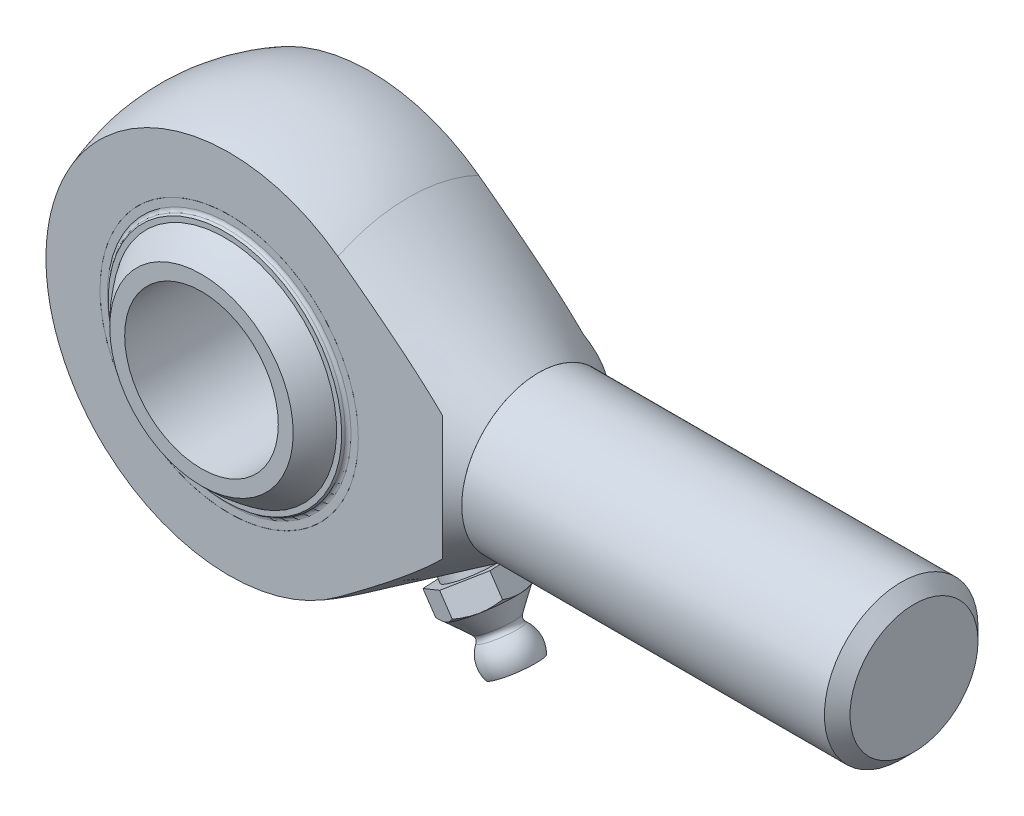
ISO-10303-21;
HEADER;
FILE_DESCRIPTION(('STEP AP214'),'2;1');
FILE_NAME('part.step','',(''),(''),'','','');
FILE_SCHEMA(('AUTOMOTIVE_DESIGN { 1 0 10303 214 1 1 1 1 }'));
ENDSEC;
DATA;
#1=APPLICATION_CONTEXT('core data for automotive mechanical design processes');
#2=APPLICATION_PROTOCOL_DEFINITION('international standard','automotive_design',2000,#1);
#3=PRODUCT_CONTEXT('',#1,'mechanical');
#4=PRODUCT('Part','Part','',(#3));
#5=PRODUCT_RELATED_PRODUCT_CATEGORY('part','',(#4));
#6=PRODUCT_DEFINITION_FORMATION('','',#4);
#7=PRODUCT_DEFINITION_CONTEXT('part definition',#1,'design');
#8=PRODUCT_DEFINITION('design','',#6,#7);
#9=PRODUCT_DEFINITION_SHAPE('','',#8);
#10=(LENGTH_UNIT() NAMED_UNIT(*) SI_UNIT(.MILLI.,.METRE.));
#11=(NAMED_UNIT(*) PLANE_ANGLE_UNIT() SI_UNIT($,.RADIAN.));
#12=(NAMED_UNIT(*) SI_UNIT($,.STERADIAN.) SOLID_ANGLE_UNIT());
#13=UNCERTAINTY_MEASURE_WITH_UNIT(LENGTH_MEASURE(1.E-05),#10,'distance_accuracy_value','');
#14=(GEOMETRIC_REPRESENTATION_CONTEXT(3) GLOBAL_UNCERTAINTY_ASSIGNED_CONTEXT((#13)) GLOBAL_UNIT_ASSIGNED_CONTEXT((#10,
#11,#12)) REPRESENTATION_CONTEXT('',''));
#15=CARTESIAN_POINT('',(0.,0.,0.));
#16=DIRECTION('',(0.,0.,1.));
#17=DIRECTION('',(1.,0.,0.));
#18=AXIS2_PLACEMENT_3D('',#15,#16,#17);
#19=CARTESIAN_POINT('',(-5.11675419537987,-15.7477501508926,2.47463425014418));
#20=DIRECTION('',(0.305622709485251,0.940609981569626,-0.147809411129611));
#21=DIRECTION('',(0.0456756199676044,0.140575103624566,0.989015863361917));
#22=AXIS2_PLACEMENT_3D('',#19,#20,#21);
#23=SPHERICAL_SURFACE('',#22,2.);
#24=CARTESIAN_POINT('',(-4.50550877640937,-13.8665301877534,2.17901542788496));
#25=VERTEX_POINT('',#24);
#26=VERTEX_LOOP('',#25);
#27=FACE_BOUND('',#26,.T.);
#28=ADVANCED_FACE('P0_F12',(#27),#23,.T.);
#29=CLOSED_SHELL('',(#28));
#30=MANIFOLD_SOLID_BREP('P0_B1',#29);
#31=CARTESIAN_POINT('',(0.,16.5581644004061,2.47463425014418));
#32=DIRECTION('',(0.,-0.989015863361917,-0.147809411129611));
#33=DIRECTION('',(0.,-0.147809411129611,0.989015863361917));
#34=AXIS2_PLACEMENT_3D('',#31,#32,#33);
#35=SPHERICAL_SURFACE('',#34,2.);
#36=CARTESIAN_POINT('',(0.,14.5801326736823,2.17901542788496));
#37=VERTEX_POINT('',#36);
#38=VERTEX_LOOP('',#37);
#39=FACE_BOUND('',#38,.T.);
#40=ADVANCED_FACE('P1_F12',(#39),#35,.T.);
#41=CLOSED_SHELL('',(#40));
#42=MANIFOLD_SOLID_BREP('P1_B1',#41);
#43=CARTESIAN_POINT('',(5.11675419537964,-15.7477501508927,-2.47463425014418));
#44=DIRECTION('',(-0.305622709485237,0.94060998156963,0.147809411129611));
#45=DIRECTION('',(-0.0456756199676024,0.140575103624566,-0.989015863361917));
#46=AXIS2_PLACEMENT_3D('',#43,#44,#45);
#47=SPHERICAL_SURFACE('',#46,2.);
#48=CARTESIAN_POINT('',(4.50550877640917,-13.8665301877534,-2.17901542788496));
#49=VERTEX_POINT('',#48);
#50=VERTEX_LOOP('',#49);
#51=FACE_BOUND('',#50,.T.);
#52=ADVANCED_FACE('P2_F12',(#51),#47,.T.);
#53=CLOSED_SHELL('',(#52));
#54=MANIFOLD_SOLID_BREP('P2_B1',#53);
#55=CARTESIAN_POINT('',(0.,0.,0.));
#56=DIRECTION('',(0.,0.,1.));
#57=DIRECTION('',(0.999027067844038,0.044101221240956,0.));
#58=AXIS2_PLACEMENT_3D('',#55,#56,#57);
#59=CYLINDRICAL_SURFACE('',#58,15.14);
#60=CARTESIAN_POINT('',(0.,0.,-8.25));
#61=DIRECTION('',(0.,0.,1.));
#62=DIRECTION('',(0.999027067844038,0.044101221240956,0.));
#63=AXIS2_PLACEMENT_3D('',#60,#61,#62);
#64=CIRCLE('',#63,15.14);
#65=CARTESIAN_POINT('',(15.1252698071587,0.667692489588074,-8.25));
#66=VERTEX_POINT('',#65);
#67=EDGE_CURVE('P3_E34',#66,#66,#64,.T.);
#68=ORIENTED_EDGE('',*,*,#67,.T.);
#69=EDGE_LOOP('',(#68));
#70=FACE_BOUND('',#69,.T.);
#71=CARTESIAN_POINT('',(0.,0.,-7.75));
#72=DIRECTION('',(0.,0.,1.));
#73=DIRECTION('',(0.999027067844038,0.044101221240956,0.));
#74=AXIS2_PLACEMENT_3D('',#71,#72,#73);
#75=CIRCLE('',#74,15.14);
#76=CARTESIAN_POINT('',(15.1252698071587,0.667692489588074,-7.75));
#77=VERTEX_POINT('',#76);
#78=EDGE_CURVE('P3_E43',#77,#77,#75,.T.);
#79=ORIENTED_EDGE('',*,*,#78,.F.);
#80=EDGE_LOOP('',(#79));
#81=FACE_BOUND('',#80,.T.);
#82=ADVANCED_FACE('P3_F14',(#70,#81),#59,.T.);
#83=CARTESIAN_POINT('',(-0.667692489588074,15.1252698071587,-8.25));
#84=DIRECTION('',(0.,0.,-1.));
#85=DIRECTION('',(-0.999027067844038,-0.044101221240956,0.));
#86=AXIS2_PLACEMENT_3D('',#83,#84,#85);
#87=PLANE('',#86);
#88=CARTESIAN_POINT('',(0.,0.,-8.25));
#89=DIRECTION('',(0.,0.,-1.));
#90=DIRECTION('',(-0.999027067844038,-0.044101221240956,0.));
#91=AXIS2_PLACEMENT_3D('',#88,#89,#90);
#92=CIRCLE('',#91,14.273546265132);
#93=CARTESIAN_POINT('',(-14.259659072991,-0.629480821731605,-8.25));
#94=VERTEX_POINT('',#93);
#95=EDGE_CURVE('P3_E21',#94,#94,#92,.F.);
#96=ORIENTED_EDGE('',*,*,#95,.T.);
#97=EDGE_LOOP('',(#96));
#98=FACE_BOUND('',#97,.T.);
#99=ORIENTED_EDGE('',*,*,#67,.F.);
#100=EDGE_LOOP('',(#99));
#101=FACE_BOUND('',#100,.T.);
#102=ADVANCED_FACE('P3_F50',(#98,#101),#87,.T.);
#103=CARTESIAN_POINT('',(0.,0.,0.));
#104=DIRECTION('',(0.,0.,1.));
#105=DIRECTION('',(-0.044101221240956,0.999027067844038,0.));
#106=AXIS2_PLACEMENT_3D('',#103,#104,#105);
#107=SPHERICAL_SURFACE('',#106,16.2420614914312);
#108=CARTESIAN_POINT('',(0.,0.,-8.48868212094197));
#109=DIRECTION('',(0.,0.,1.));
#110=DIRECTION('',(0.999027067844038,0.044101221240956,0.));
#111=AXIS2_PLACEMENT_3D('',#108,#109,#110);
#112=CIRCLE('',#111,13.8472682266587);
#113=CARTESIAN_POINT('',(-0.610681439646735,13.8337957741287,-8.48868212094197));
#114=VERTEX_POINT('',#113);
#115=EDGE_CURVE('P3_E10',#114,#114,#112,.F.);
#116=CARTESIAN_POINT('',(0.,0.,-8.75));
#117=DIRECTION('',(0.,0.,1.));
#118=DIRECTION('',(0.999027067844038,0.044101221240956,0.));
#119=AXIS2_PLACEMENT_3D('',#116,#117,#118);
#120=CIRCLE('',#119,13.6836421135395);
#121=CARTESIAN_POINT('',(-0.603465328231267,13.6703288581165,-8.75));
#122=VERTEX_POINT('',#121);
#123=EDGE_CURVE('P3_E37',#122,#122,#120,.T.);
#124=CARTESIAN_POINT('',(-0.610681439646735,13.8337957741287,-8.48868212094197));
#125=CARTESIAN_POINT('',(-0.610607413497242,13.8321188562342,-8.49142027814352));
#126=CARTESIAN_POINT('',(-0.610533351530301,13.8304411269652,-8.49415793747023));
#127=CARTESIAN_POINT('',(-0.610385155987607,13.8270840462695,-8.49963225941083));
#128=CARTESIAN_POINT('',(-0.610311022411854,13.8254046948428,-8.50236892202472));
#129=CARTESIAN_POINT('',(-0.610162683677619,13.8220443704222,-8.50784124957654));
#130=CARTESIAN_POINT('',(-0.610088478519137,13.8203633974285,-8.51057691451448));
#131=CARTESIAN_POINT('',(-0.609939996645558,13.8169998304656,-8.51604724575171));
#132=CARTESIAN_POINT('',(-0.609865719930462,13.8153172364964,-8.518781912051));
#133=CARTESIAN_POINT('',(-0.609717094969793,13.8119504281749,-8.52425024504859));
#134=CARTESIAN_POINT('',(-0.60964274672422,13.8102662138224,-8.52698391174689));
#135=CARTESIAN_POINT('',(-0.609493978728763,13.806896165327,-8.53245024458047));
#136=CARTESIAN_POINT('',(-0.609419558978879,13.805210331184,-8.53518291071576));
#137=CARTESIAN_POINT('',(-0.609270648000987,13.8018370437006,-8.54064724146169));
#138=CARTESIAN_POINT('',(-0.60919615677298,13.8001495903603,-8.54337890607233));
#139=CARTESIAN_POINT('',(-0.609047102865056,13.7967730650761,-8.54884123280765));
#140=CARTESIAN_POINT('',(-0.608972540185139,13.7950839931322,-8.55157189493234));
#141=CARTESIAN_POINT('',(-0.608823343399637,13.7917042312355,-8.5570322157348));
#142=CARTESIAN_POINT('',(-0.608748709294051,13.7900135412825,-8.55976187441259));
#143=CARTESIAN_POINT('',(-0.608599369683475,13.7866305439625,-8.56522018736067));
#144=CARTESIAN_POINT('',(-0.608524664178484,13.7849382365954,-8.56794884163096));
#145=CARTESIAN_POINT('',(-0.608375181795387,13.7815520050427,-8.57340514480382));
#146=CARTESIAN_POINT('',(-0.60830040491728,13.779858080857,-8.57613279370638));
#147=CARTESIAN_POINT('',(-0.608150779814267,13.7764686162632,-8.58158708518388));
#148=CARTESIAN_POINT('',(-0.608075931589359,13.7747730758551,-8.58431372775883));
#149=CARTESIAN_POINT('',(-0.607926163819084,13.771380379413,-8.58976600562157));
#150=CARTESIAN_POINT('',(-0.607851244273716,13.7696832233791,-8.59249164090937));
#151=CARTESIAN_POINT('',(-0.607701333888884,13.7662872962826,-8.59794190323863));
#152=CARTESIAN_POINT('',(-0.607626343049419,13.7645885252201,-8.6006665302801));
#153=CARTESIAN_POINT('',(-0.607476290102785,13.7611893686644,-8.60611477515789));
#154=CARTESIAN_POINT('',(-0.607401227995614,13.7594889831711,-8.60883839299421));
#155=CARTESIAN_POINT('',(-0.607251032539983,13.7560865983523,-8.61428461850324));
#156=CARTESIAN_POINT('',(-0.607175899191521,13.7543845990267,-8.61700722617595));
#157=CARTESIAN_POINT('',(-0.607025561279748,13.750978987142,-8.62245143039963));
#158=CARTESIAN_POINT('',(-0.606950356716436,13.749275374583,-8.62517302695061));
#159=CARTESIAN_POINT('',(-0.606799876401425,13.7458665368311,-8.63061520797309));
#160=CARTESIAN_POINT('',(-0.606724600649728,13.7441613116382,-8.63333579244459));
#161=CARTESIAN_POINT('',(-0.606573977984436,13.7407492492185,-8.6387759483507));
#162=CARTESIAN_POINT('',(-0.606498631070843,13.7390424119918,-8.64149551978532));
#163=CARTESIAN_POINT('',(-0.606347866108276,13.7356271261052,-8.64693364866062));
#164=CARTESIAN_POINT('',(-0.606272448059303,13.7339186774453,-8.64965220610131));
#165=CARTESIAN_POINT('',(-0.606121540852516,13.7305001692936,-8.65508830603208));
#166=CARTESIAN_POINT('',(-0.606046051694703,13.7287901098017,-8.65780584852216));
#167=CARTESIAN_POINT('',(-0.605895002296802,13.7253683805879,-8.66323991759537));
#168=CARTESIAN_POINT('',(-0.605819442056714,13.723656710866,-8.66595644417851));
#169=CARTESIAN_POINT('',(-0.605668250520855,13.7202317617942,-8.67138848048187));
#170=CARTESIAN_POINT('',(-0.605592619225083,13.7185184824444,-8.6741039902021));
#171=CARTESIAN_POINT('',(-0.605441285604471,13.71509031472,-8.67953399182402));
#172=CARTESIAN_POINT('',(-0.605365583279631,13.7133754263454,-8.68224848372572));
#173=CARTESIAN_POINT('',(-0.605214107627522,13.7099440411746,-8.68767644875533));
#174=CARTESIAN_POINT('',(-0.605138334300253,13.7082275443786,-8.69038992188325));
#175=CARTESIAN_POINT('',(-0.604986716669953,13.7047929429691,-8.6958158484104));
#176=CARTESIAN_POINT('',(-0.604910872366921,13.7030748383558,-8.69852830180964));
#177=CARTESIAN_POINT('',(-0.604759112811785,13.6996370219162,-8.7039521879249));
#178=CARTESIAN_POINT('',(-0.604683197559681,13.6979173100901,-8.70666362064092));
#179=CARTESIAN_POINT('',(-0.604531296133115,13.6944762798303,-8.71208546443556));
#180=CARTESIAN_POINT('',(-0.604455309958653,13.6927549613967,-8.71479587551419));
#181=CARTESIAN_POINT('',(-0.604303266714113,13.6893107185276,-8.72021567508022));
#182=CARTESIAN_POINT('',(-0.604227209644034,13.6875877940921,-8.72292506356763));
#183=CARTESIAN_POINT('',(-0.604075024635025,13.6841403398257,-8.72834281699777));
#184=CARTESIAN_POINT('',(-0.603998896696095,13.6824158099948,-8.73105118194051));
#185=CARTESIAN_POINT('',(-0.603846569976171,13.6789651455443,-8.73646688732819));
#186=CARTESIAN_POINT('',(-0.603770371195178,13.6772390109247,-8.73917422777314));
#187=CARTESIAN_POINT('',(-0.603617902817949,13.6737851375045,-8.74458788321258));
#188=CARTESIAN_POINT('',(-0.603541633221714,13.6720573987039,-8.74729419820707));
#189=CARTESIAN_POINT('',(-0.603465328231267,13.6703288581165,-8.75));
#190=B_SPLINE_CURVE_WITH_KNOTS('',3,(#124,#125,#126,#127,#128,#129,#130,#131,#132,#133,#134,
#135,#136,#137,#138,#139,#140,#141,#142,#143,#144,#145,#146,#147,#148,#149,#150,#151,#152,#153,
#154,#155,#156,#157,#158,#159,#160,#161,#162,#163,#164,#165,#166,#167,#168,#169,#170,#171,#172,
#173,#174,#175,#176,#177,#178,#179,#180,#181,#182,#183,#184,#185,#186,#187,#188,#189),
.UNSPECIFIED.,.F.,.F.,(4,2,2,2,2,2,2,2,2,2,2,2,2,2,2,2,2,2,2,2,2,2,2,2,2,2,2,2,2,2,2,2,4),(0.,
0.00963510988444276,0.0192702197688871,0.0289053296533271,0.0385404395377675,0.0481755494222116,
0.057810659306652,0.0674457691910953,0.0770808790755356,0.0867159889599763,0.0963510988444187,
0.105986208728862,0.115621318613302,0.125256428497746,0.134891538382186,0.144526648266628,
0.154161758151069,0.163796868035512,0.173431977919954,0.183067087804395,0.192702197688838,
0.20233730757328,0.211972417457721,0.221607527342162,0.231242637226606,0.240877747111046,
0.250512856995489,0.260147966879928,0.269783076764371,0.279418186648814,0.289053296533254,
0.298688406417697,0.308323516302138),.UNSPECIFIED.);
#191=EDGE_CURVE('P3_BSEAM57',#114,#122,#190,.T.);
#192=ORIENTED_EDGE('',*,*,#115,.T.);
#193=ORIENTED_EDGE('',*,*,#123,.T.);
#194=ORIENTED_EDGE('',*,*,#191,.T.);
#195=ORIENTED_EDGE('',*,*,#191,.F.);
#196=EDGE_LOOP('',(#192,#194,#193,#195));
#197=FACE_BOUND('',#196,.T.);
#198=ADVANCED_FACE('P3_F57',(#197),#107,.T.);
#199=CARTESIAN_POINT('',(-0.57711970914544,13.0735202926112,-8.75));
#200=DIRECTION('',(0.,0.,-1.));
#201=DIRECTION('',(-0.999027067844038,-0.044101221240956,0.));
#202=AXIS2_PLACEMENT_3D('',#199,#200,#201);
#203=PLANE('',#202);
#204=CARTESIAN_POINT('',(0.,0.,-8.75));
#205=DIRECTION('',(0.,0.,1.));
#206=DIRECTION('',(0.999027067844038,0.044101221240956,0.));
#207=AXIS2_PLACEMENT_3D('',#204,#205,#206);
#208=CIRCLE('',#207,13.0862523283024);
#209=CARTESIAN_POINT('',(-0.57711970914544,13.0735202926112,-8.75));
#210=VERTEX_POINT('',#209);
#211=EDGE_CURVE('P3_E40',#210,#210,#208,.T.);
#212=ORIENTED_EDGE('',*,*,#211,.T.);
#213=EDGE_LOOP('',(#212));
#214=FACE_BOUND('',#213,.T.);
#215=ORIENTED_EDGE('',*,*,#123,.F.);
#216=EDGE_LOOP('',(#215));
#217=FACE_BOUND('',#216,.T.);
#218=ADVANCED_FACE('P3_F77',(#214,#217),#203,.T.);
#219=CARTESIAN_POINT('',(0.,0.,0.));
#220=DIRECTION('',(0.,0.,1.));
#221=DIRECTION('',(-0.044101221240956,0.999027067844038,0.));
#222=AXIS2_PLACEMENT_3D('',#219,#220,#221);
#223=SPHERICAL_SURFACE('',#222,15.7420614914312);
#224=CARTESIAN_POINT('',(0.,0.,-7.99602977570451));
#225=DIRECTION('',(0.,0.,1.));
#226=DIRECTION('',(0.999027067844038,0.044101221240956,0.));
#227=AXIS2_PLACEMENT_3D('',#224,#225,#226);
#228=CIRCLE('',#227,13.5600887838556);
#229=CARTESIAN_POINT('',(-0.598016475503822,13.5468957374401,-7.99602977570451));
#230=VERTEX_POINT('',#229);
#231=EDGE_CURVE('P3_E29',#230,#230,#228,.T.);
#232=CARTESIAN_POINT('',(-0.598016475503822,13.5468957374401,-7.99602977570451));
#233=CARTESIAN_POINT('',(-0.597808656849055,13.5421880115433,-8.00402116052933));
#234=CARTESIAN_POINT('',(-0.597600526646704,13.5374732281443,-8.01200837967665));
#235=CARTESIAN_POINT('',(-0.597183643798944,13.5280295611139,-8.02797446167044));
#236=CARTESIAN_POINT('',(-0.596974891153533,13.5233006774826,-8.03595332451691));
#237=CARTESIAN_POINT('',(-0.596556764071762,13.5138288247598,-8.05190266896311));
#238=CARTESIAN_POINT('',(-0.596347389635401,13.5090858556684,-8.05987315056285));
#239=CARTESIAN_POINT('',(-0.595928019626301,13.4995858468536,-8.07580570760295));
#240=CARTESIAN_POINT('',(-0.595718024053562,13.4948288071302,-8.08376778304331));
#241=CARTESIAN_POINT('',(-0.595297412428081,13.4853006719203,-8.09968350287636));
#242=CARTESIAN_POINT('',(-0.595086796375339,13.4805295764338,-8.10763714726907));
#243=CARTESIAN_POINT('',(-0.594664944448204,13.4709733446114,-8.12353598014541));
#244=CARTESIAN_POINT('',(-0.594453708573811,13.4661882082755,-8.13148116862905));
#245=CARTESIAN_POINT('',(-0.594030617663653,13.4566039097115,-8.14736306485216));
#246=CARTESIAN_POINT('',(-0.593818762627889,13.4518047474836,-8.15529977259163));
#247=CARTESIAN_POINT('',(-0.593394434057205,13.4421924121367,-8.17116468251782));
#248=CARTESIAN_POINT('',(-0.593181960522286,13.4373792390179,-8.17909288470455));
#249=CARTESIAN_POINT('',(-0.592756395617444,13.4277388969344,-8.19494075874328));
#250=CARTESIAN_POINT('',(-0.592543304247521,13.4229117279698,-8.20286043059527));
#251=CARTESIAN_POINT('',(-0.592116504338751,13.4132434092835,-8.21869121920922));
#252=CARTESIAN_POINT('',(-0.591902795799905,13.4084022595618,-8.22660233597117));
#253=CARTESIAN_POINT('',(-0.591474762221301,13.3987059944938,-8.24241598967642));
#254=CARTESIAN_POINT('',(-0.591260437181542,13.3938508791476,-8.25031852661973));
#255=CARTESIAN_POINT('',(-0.59083117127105,13.3841266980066,-8.26611499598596));
#256=CARTESIAN_POINT('',(-0.590616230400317,13.3792576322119,-8.27400892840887));
#257=CARTESIAN_POINT('',(-0.590185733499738,13.3695055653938,-8.28978816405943));
#258=CARTESIAN_POINT('',(-0.589970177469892,13.3646225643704,-8.29767346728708));
#259=CARTESIAN_POINT('',(-0.589538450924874,13.3548426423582,-8.31343541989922));
#260=CARTESIAN_POINT('',(-0.589322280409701,13.3499457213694,-8.3213120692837));
#261=CARTESIAN_POINT('',(-0.588889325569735,13.3401379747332,-8.33705668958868));
#262=CARTESIAN_POINT('',(-0.588672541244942,13.3352271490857,-8.34492466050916));
#263=CARTESIAN_POINT('',(-0.588238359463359,13.3253916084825,-8.36065189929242));
#264=CARTESIAN_POINT('',(-0.58802096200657,13.3204668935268,-8.36851116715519));
#265=CARTESIAN_POINT('',(-0.587585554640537,13.3106035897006,-8.38422097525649));
#266=CARTESIAN_POINT('',(-0.587367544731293,13.3056650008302,-8.39207151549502));
#267=CARTESIAN_POINT('',(-0.586930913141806,13.2957739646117,-8.40776384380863));
#268=CARTESIAN_POINT('',(-0.586712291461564,13.2908215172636,-8.4156056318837));
#269=CARTESIAN_POINT('',(-0.586274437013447,13.2809027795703,-8.4312804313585));
#270=CARTESIAN_POINT('',(-0.586055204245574,13.275936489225,-8.43911344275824));
#271=CARTESIAN_POINT('',(-0.585616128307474,13.2659900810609,-8.45477066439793));
#272=CARTESIAN_POINT('',(-0.585396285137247,13.261009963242,-8.46259487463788));
#273=CARTESIAN_POINT('',(-0.584955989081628,13.2510359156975,-8.47823446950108));
#274=CARTESIAN_POINT('',(-0.584735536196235,13.2460419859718,-8.48604985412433));
#275=CARTESIAN_POINT('',(-0.584294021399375,13.2360403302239,-8.50167177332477));
#276=CARTESIAN_POINT('',(-0.584072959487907,13.2310326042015,-8.50947830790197));
#277=CARTESIAN_POINT('',(-0.583630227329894,13.2210033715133,-8.52508250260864));
#278=CARTESIAN_POINT('',(-0.583408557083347,13.2159818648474,-8.5328801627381));
#279=CARTESIAN_POINT('',(-0.582964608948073,13.2059250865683,-8.54846658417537));
#280=CARTESIAN_POINT('',(-0.582742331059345,13.2008898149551,-8.55625534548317));
#281=CARTESIAN_POINT('',(-0.582297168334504,13.1908055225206,-8.57182394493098));
#282=CARTESIAN_POINT('',(-0.582074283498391,13.1857565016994,-8.57960378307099));
#283=CARTESIAN_POINT('',(-0.581627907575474,13.175644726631,-8.59515451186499));
#284=CARTESIAN_POINT('',(-0.58140441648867,13.1705819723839,-8.60292540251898));
#285=CARTESIAN_POINT('',(-0.580956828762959,13.1604427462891,-8.61845821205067));
#286=CARTESIAN_POINT('',(-0.580732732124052,13.1553662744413,-8.62622013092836));
#287=CARTESIAN_POINT('',(-0.580283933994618,13.1451996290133,-8.64173497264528));
#288=CARTESIAN_POINT('',(-0.580059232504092,13.140109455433,-8.6494878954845));
#289=CARTESIAN_POINT('',(-0.579609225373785,13.1299154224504,-8.66498472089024));
#290=CARTESIAN_POINT('',(-0.579383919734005,13.1248115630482,-8.67272862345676));
#291=CARTESIAN_POINT('',(-0.578932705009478,13.1145901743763,-8.68820738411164));
#292=CARTESIAN_POINT('',(-0.578706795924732,13.1094726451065,-8.6959422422));
#293=CARTESIAN_POINT('',(-0.578254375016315,13.0992239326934,-8.71140288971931));
#294=CARTESIAN_POINT('',(-0.578027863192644,13.09409274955,-8.71912867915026));
#295=CARTESIAN_POINT('',(-0.577574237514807,13.0838167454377,-8.73457116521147));
#296=CARTESIAN_POINT('',(-0.57734712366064,13.0786719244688,-8.74228786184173));
#297=CARTESIAN_POINT('',(-0.57711970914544,13.0735202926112,-8.75));
#298=B_SPLINE_CURVE_WITH_KNOTS('',3,(#232,#233,#234,#235,#236,#237,#238,#239,#240,#241,#242,
#243,#244,#245,#246,#247,#248,#249,#250,#251,#252,#253,#254,#255,#256,#257,#258,#259,#260,#261,
#262,#263,#264,#265,#266,#267,#268,#269,#270,#271,#272,#273,#274,#275,#276,#277,#278,#279,#280,
#281,#282,#283,#284,#285,#286,#287,#288,#289,#290,#291,#292,#293,#294,#295,#296,#297),
.UNSPECIFIED.,.F.,.F.,(4,2,2,2,2,2,2,2,2,2,2,2,2,2,2,2,2,2,2,2,2,2,2,2,2,2,2,2,2,2,2,2,4),(0.,
0.0278318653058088,0.0556637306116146,0.0834955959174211,0.111327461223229,0.139159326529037,
0.166991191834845,0.194823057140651,0.222654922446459,0.250486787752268,0.278318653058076,
0.306150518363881,0.333982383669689,0.361814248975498,0.389646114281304,0.41747797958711,
0.445309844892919,0.473141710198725,0.500973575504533,0.528805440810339,0.556637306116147,
0.584469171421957,0.612301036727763,0.64013290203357,0.667964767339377,0.695796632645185,
0.723628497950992,0.751460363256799,0.779292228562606,0.807124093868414,0.834955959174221,
0.862787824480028,0.890619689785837),.UNSPECIFIED.);
#299=EDGE_CURVE('P3_BSEAM68',#230,#210,#298,.T.);
#300=ORIENTED_EDGE('',*,*,#231,.T.);
#301=ORIENTED_EDGE('',*,*,#211,.F.);
#302=ORIENTED_EDGE('',*,*,#299,.T.);
#303=ORIENTED_EDGE('',*,*,#299,.F.);
#304=EDGE_LOOP('',(#300,#302,#301,#303));
#305=FACE_BOUND('',#304,.T.);
#306=ADVANCED_FACE('P3_F68',(#305),#223,.F.);
#307=CARTESIAN_POINT('',(-0.667692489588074,15.1252698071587,-7.75));
#308=DIRECTION('',(0.,0.,1.));
#309=DIRECTION('',(0.999027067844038,0.044101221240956,0.));
#310=AXIS2_PLACEMENT_3D('',#307,#308,#309);
#311=PLANE('',#310);
#312=CARTESIAN_POINT('',(0.,0.,-7.75));
#313=DIRECTION('',(0.,0.,1.));
#314=DIRECTION('',(0.999027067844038,0.044101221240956,0.));
#315=AXIS2_PLACEMENT_3D('',#312,#313,#314);
#316=CIRCLE('',#315,13.9907848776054);
#317=CARTESIAN_POINT('',(13.9771727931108,0.617010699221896,-7.75));
#318=VERTEX_POINT('',#317);
#319=EDGE_CURVE('P3_E25',#318,#318,#316,.F.);
#320=ORIENTED_EDGE('',*,*,#319,.T.);
#321=EDGE_LOOP('',(#320));
#322=FACE_BOUND('',#321,.T.);
#323=ORIENTED_EDGE('',*,*,#78,.T.);
#324=EDGE_LOOP('',(#323));
#325=FACE_BOUND('',#324,.T.);
#326=ADVANCED_FACE('P3_F47',(#322,#325),#311,.T.);
#327=CARTESIAN_POINT('',(0.,0.,-8.25));
#328=DIRECTION('',(0.,0.,1.));
#329=DIRECTION('',(0.999027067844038,0.044101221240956,0.));
#330=AXIS2_PLACEMENT_3D('',#327,#328,#329);
#331=TOROIDAL_SURFACE('',#330,13.9907848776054,0.5);
#332=ORIENTED_EDGE('',*,*,#319,.F.);
#333=EDGE_LOOP('',(#332));
#334=FACE_BOUND('',#333,.T.);
#335=ORIENTED_EDGE('',*,*,#231,.F.);
#336=EDGE_LOOP('',(#335));
#337=FACE_BOUND('',#336,.T.);
#338=ADVANCED_FACE('P3_F60',(#334,#337),#331,.T.);
#339=CARTESIAN_POINT('',(0.,0.,-8.75));
#340=DIRECTION('',(0.,0.,-1.));
#341=DIRECTION('',(-0.999027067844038,-0.044101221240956,0.));
#342=AXIS2_PLACEMENT_3D('',#339,#340,#341);
#343=TOROIDAL_SURFACE('',#342,14.273546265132,0.5);
#344=ORIENTED_EDGE('',*,*,#115,.F.);
#345=EDGE_LOOP('',(#344));
#346=FACE_BOUND('',#345,.T.);
#347=ORIENTED_EDGE('',*,*,#95,.F.);
#348=EDGE_LOOP('',(#347));
#349=FACE_BOUND('',#348,.T.);
#350=ADVANCED_FACE('P3_F16',(#346,#349),#343,.F.);
#351=CLOSED_SHELL('',(#82,#102,#198,#218,#306,#326,#338,#350));
#352=MANIFOLD_SOLID_BREP('P3_B1',#351);
#353=CARTESIAN_POINT('',(-9.73264483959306,-13.3958363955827,2.47463425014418));
#354=DIRECTION('',(0.581328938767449,0.800130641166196,-0.147809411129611));
#355=DIRECTION('',(0.0868801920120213,0.119580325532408,0.989015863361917));
#356=AXIS2_PLACEMENT_3D('',#353,#354,#355);
#357=SPHERICAL_SURFACE('',#356,2.);
#358=CARTESIAN_POINT('',(-8.56998696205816,-11.7955751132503,2.17901542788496));
#359=VERTEX_POINT('',#358);
#360=VERTEX_LOOP('',#359);
#361=FACE_BOUND('',#360,.T.);
#362=ADVANCED_FACE('P4_F12',(#361),#357,.T.);
#363=CLOSED_SHELL('',(#362));
#364=MANIFOLD_SOLID_BREP('P4_B1',#363);
#365=CARTESIAN_POINT('',(5.11675419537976,15.7477501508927,2.47463425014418));
#366=DIRECTION('',(-0.305622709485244,-0.940609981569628,-0.147809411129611));
#367=DIRECTION('',(-0.0456756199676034,-0.140575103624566,0.989015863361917));
#368=AXIS2_PLACEMENT_3D('',#365,#366,#367);
#369=SPHERICAL_SURFACE('',#368,2.);
#370=CARTESIAN_POINT('',(4.50550877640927,13.8665301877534,2.17901542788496));
#371=VERTEX_POINT('',#370);
#372=VERTEX_LOOP('',#371);
#373=FACE_BOUND('',#372,.T.);
#374=ADVANCED_FACE('P5_F12',(#373),#369,.T.);
#375=CLOSED_SHELL('',(#374));
#376=MANIFOLD_SOLID_BREP('P5_B1',#375);
#377=CARTESIAN_POINT('',(-1.15625110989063E-13,-16.5581644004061,-2.47463425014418));
#378=DIRECTION('',(0.,0.989015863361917,0.147809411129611));
#379=DIRECTION('',(0.,0.147809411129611,-0.989015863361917));
#380=AXIS2_PLACEMENT_3D('',#377,#378,#379);
#381=SPHERICAL_SURFACE('',#380,2.);
#382=CARTESIAN_POINT('',(-1.01812581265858E-13,-14.5801326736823,-2.17901542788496));
#383=VERTEX_POINT('',#382);
#384=VERTEX_LOOP('',#383);
#385=FACE_BOUND('',#384,.T.);
#386=ADVANCED_FACE('P6_F12',(#385),#381,.T.);
#387=CLOSED_SHELL('',(#386));
#388=MANIFOLD_SOLID_BREP('P6_B1',#387);
#389=CARTESIAN_POINT('',(-13.3958363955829,-9.73264483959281,2.47463425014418));
#390=DIRECTION('',(0.800130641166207,0.581328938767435,-0.147809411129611));
#391=DIRECTION('',(0.11958032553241,0.0868801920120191,0.989015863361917));
#392=AXIS2_PLACEMENT_3D('',#389,#390,#391);
#393=SPHERICAL_SURFACE('',#392,2.);
#394=CARTESIAN_POINT('',(-11.7955751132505,-8.56998696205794,2.17901542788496));
#395=VERTEX_POINT('',#394);
#396=VERTEX_LOOP('',#395);
#397=FACE_BOUND('',#396,.T.);
#398=ADVANCED_FACE('P7_F12',(#397),#393,.T.);
#399=CLOSED_SHELL('',(#398));
#400=MANIFOLD_SOLID_BREP('P7_B1',#399);
#401=CARTESIAN_POINT('',(9.73264483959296,13.3958363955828,2.47463425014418));
#402=DIRECTION('',(-0.581328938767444,-0.800130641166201,-0.147809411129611));
#403=DIRECTION('',(-0.0868801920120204,-0.119580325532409,0.989015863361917));
#404=AXIS2_PLACEMENT_3D('',#401,#402,#403);
#405=SPHERICAL_SURFACE('',#404,2.);
#406=CARTESIAN_POINT('',(8.56998696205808,11.7955751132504,2.17901542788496));
#407=VERTEX_POINT('',#406);
#408=VERTEX_LOOP('',#407);
#409=FACE_BOUND('',#408,.T.);
#410=ADVANCED_FACE('P8_F12',(#409),#405,.T.);
#411=CLOSED_SHELL('',(#410));
#412=MANIFOLD_SOLID_BREP('P8_B1',#411);
#413=CARTESIAN_POINT('',(-5.11675419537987,-15.7477501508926,-2.47463425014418));
#414=DIRECTION('',(0.305622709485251,0.940609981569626,0.147809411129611));
#415=DIRECTION('',(0.0456756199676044,0.140575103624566,-0.989015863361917));
#416=AXIS2_PLACEMENT_3D('',#413,#414,#415);
#417=SPHERICAL_SURFACE('',#416,2.);
#418=CARTESIAN_POINT('',(-4.50550877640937,-13.8665301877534,-2.17901542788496));
#419=VERTEX_POINT('',#418);
#420=VERTEX_LOOP('',#419);
#421=FACE_BOUND('',#420,.T.);
#422=ADVANCED_FACE('P9_F12',(#421),#417,.T.);
#423=CLOSED_SHELL('',(#422));
#424=MANIFOLD_SOLID_BREP('P9_B1',#423);
#425=CARTESIAN_POINT('',(0.,0.,0.));
#426=DIRECTION('',(0.,1.,0.));
#427=DIRECTION('',(1.,0.,0.));
#428=AXIS2_PLACEMENT_3D('',#425,#426,#427);
#429=SPHERICAL_SURFACE('',#428,15.7420614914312);
#430=CARTESIAN_POINT('',(0.,0.,0.));
#431=DIRECTION('',(0.,0.,1.));
#432=DIRECTION('',(1.,0.,0.));
#433=AXIS2_PLACEMENT_3D('',#430,#431,#432);
#434=SPHERICAL_SURFACE('',#433,15.7420614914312);
#435=CARTESIAN_POINT('',(0.,0.,3.97229548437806));
#436=DIRECTION('',(0.,0.,1.));
#437=DIRECTION('',(1.,0.,0.));
#438=AXIS2_PLACEMENT_3D('',#435,#436,#437);
#439=CIRCLE('',#438,15.2326415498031);
#440=CARTESIAN_POINT('',(15.2326415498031,0.,3.97229548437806));
#441=VERTEX_POINT('',#440);
#442=EDGE_CURVE('P10_E18',#441,#441,#439,.F.);
#443=ORIENTED_EDGE('',*,*,#442,.F.);
#444=EDGE_LOOP('',(#443));
#445=FACE_BOUND('',#444,.T.);
#446=CARTESIAN_POINT('',(0.,0.,11.5));
#447=DIRECTION('',(0.,0.,-1.));
#448=DIRECTION('',(-1.,0.,0.));
#449=AXIS2_PLACEMENT_3D('',#446,#447,#448);
#450=CIRCLE('',#449,10.75);
#451=CARTESIAN_POINT('',(-10.75,0.,11.5));
#452=VERTEX_POINT('',#451);
#453=EDGE_CURVE('P10_E27',#452,#452,#450,.F.);
#454=ORIENTED_EDGE('',*,*,#453,.F.);
#455=EDGE_LOOP('',(#454));
#456=FACE_BOUND('',#455,.T.);
#457=ADVANCED_FACE('P10_F14',(#445,#456),#434,.T.);
#458=CARTESIAN_POINT('',(0.,0.,0.));
#459=DIRECTION('',(0.,0.,-1.));
#460=DIRECTION('',(-1.,0.,0.));
#461=AXIS2_PLACEMENT_3D('',#458,#459,#460);
#462=SPHERICAL_SURFACE('',#461,15.7420614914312);
#463=CARTESIAN_POINT('',(0.,0.,-3.97229548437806));
#464=DIRECTION('',(0.,0.,-1.));
#465=DIRECTION('',(-1.,0.,0.));
#466=AXIS2_PLACEMENT_3D('',#463,#464,#465);
#467=CIRCLE('',#466,15.2326415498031);
#468=CARTESIAN_POINT('',(-15.2326415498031,0.,-3.97229548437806));
#469=VERTEX_POINT('',#468);
#470=EDGE_CURVE('P10_E34',#469,#469,#467,.F.);
#471=ORIENTED_EDGE('',*,*,#470,.F.);
#472=EDGE_LOOP('',(#471));
#473=FACE_BOUND('',#472,.T.);
#474=CARTESIAN_POINT('',(0.,0.,-11.5));
#475=DIRECTION('',(0.,0.,1.));
#476=DIRECTION('',(1.,0.,0.));
#477=AXIS2_PLACEMENT_3D('',#474,#475,#476);
#478=CIRCLE('',#477,10.75);
#479=CARTESIAN_POINT('',(10.75,0.,-11.5));
#480=VERTEX_POINT('',#479);
#481=EDGE_CURVE('P10_E10',#480,#480,#478,.F.);
#482=ORIENTED_EDGE('',*,*,#481,.F.);
#483=EDGE_LOOP('',(#482));
#484=FACE_BOUND('',#483,.T.);
#485=ADVANCED_FACE('P10_F50',(#473,#484),#462,.T.);
#486=CARTESIAN_POINT('',(0.,0.,0.));
#487=DIRECTION('',(0.,0.,-1.));
#488=DIRECTION('',(-1.,0.,0.));
#489=AXIS2_PLACEMENT_3D('',#486,#487,#488);
#490=SPHERICAL_SURFACE('',#489,15.7420614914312);
#491=CARTESIAN_POINT('',(0.,0.,0.654868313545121));
#492=DIRECTION('',(0.,0.,-1.));
#493=DIRECTION('',(-1.,0.,0.));
#494=AXIS2_PLACEMENT_3D('',#491,#492,#493);
#495=CIRCLE('',#494,15.7284343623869);
#496=CARTESIAN_POINT('',(-15.7284343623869,0.,0.654868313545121));
#497=VERTEX_POINT('',#496);
#498=EDGE_CURVE('P10_E39',#497,#497,#495,.F.);
#499=ORIENTED_EDGE('',*,*,#498,.F.);
#500=EDGE_LOOP('',(#499));
#501=FACE_BOUND('',#500,.T.);
#502=CARTESIAN_POINT('',(0.,0.,-0.654868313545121));
#503=DIRECTION('',(0.,0.,1.));
#504=DIRECTION('',(1.,0.,0.));
#505=AXIS2_PLACEMENT_3D('',#502,#503,#504);
#506=CIRCLE('',#505,15.7284343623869);
#507=CARTESIAN_POINT('',(15.7284343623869,0.,-0.654868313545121));
#508=VERTEX_POINT('',#507);
#509=EDGE_CURVE('P10_E35',#508,#508,#506,.F.);
#510=ORIENTED_EDGE('',*,*,#509,.F.);
#511=EDGE_LOOP('',(#510));
#512=FACE_BOUND('',#511,.T.);
#513=ADVANCED_FACE('P10_F16',(#501,#512),#490,.T.);
#514=CARTESIAN_POINT('',(0.,0.,-15.7420614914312));
#515=DIRECTION('',(0.,0.,1.));
#516=DIRECTION('',(1.,0.,0.));
#517=AXIS2_PLACEMENT_3D('',#514,#515,#516);
#518=CYLINDRICAL_SURFACE('',#517,9.);
#519=CARTESIAN_POINT('',(0.,0.,11.5));
#520=DIRECTION('',(0.,0.,-1.));
#521=DIRECTION('',(-1.,0.,0.));
#522=AXIS2_PLACEMENT_3D('',#519,#520,#521);
#523=CIRCLE('',#522,9.);
#524=CARTESIAN_POINT('',(-9.,0.,11.5));
#525=VERTEX_POINT('',#524);
#526=EDGE_CURVE('P10_E31',#525,#525,#523,.F.);
#527=ORIENTED_EDGE('',*,*,#526,.T.);
#528=EDGE_LOOP('',(#527));
#529=FACE_BOUND('',#528,.T.);
#530=CARTESIAN_POINT('',(0.,0.,-11.5));
#531=DIRECTION('',(0.,0.,1.));
#532=DIRECTION('',(1.,0.,0.));
#533=AXIS2_PLACEMENT_3D('',#530,#531,#532);
#534=CIRCLE('',#533,9.);
#535=CARTESIAN_POINT('',(9.,0.,-11.5));
#536=VERTEX_POINT('',#535);
#537=EDGE_CURVE('P10_E22',#536,#536,#534,.F.);
#538=ORIENTED_EDGE('',*,*,#537,.T.);
#539=EDGE_LOOP('',(#538));
#540=FACE_BOUND('',#539,.T.);
#541=ADVANCED_FACE('P10_F62',(#529,#540),#518,.F.);
#542=CARTESIAN_POINT('',(-15.7420614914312,-15.7420614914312,-11.5));
#543=DIRECTION('',(0.,0.,1.));
#544=DIRECTION('',(1.,0.,0.));
#545=AXIS2_PLACEMENT_3D('',#542,#543,#544);
#546=PLANE('',#545);
#547=ORIENTED_EDGE('',*,*,#481,.T.);
#548=EDGE_LOOP('',(#547));
#549=FACE_BOUND('',#548,.T.);
#550=ORIENTED_EDGE('',*,*,#537,.F.);
#551=EDGE_LOOP('',(#550));
#552=FACE_BOUND('',#551,.T.);
#553=ADVANCED_FACE('P10_F58',(#549,#552),#546,.F.);
#554=CARTESIAN_POINT('',(-15.7420614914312,-15.7420614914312,11.5));
#555=DIRECTION('',(0.,0.,-1.));
#556=DIRECTION('',(-1.,0.,0.));
#557=AXIS2_PLACEMENT_3D('',#554,#555,#556);
#558=PLANE('',#557);
#559=ORIENTED_EDGE('',*,*,#453,.T.);
#560=EDGE_LOOP('',(#559));
#561=FACE_BOUND('',#560,.T.);
#562=ORIENTED_EDGE('',*,*,#526,.F.);
#563=EDGE_LOOP('',(#562));
#564=FACE_BOUND('',#563,.T.);
#565=ADVANCED_FACE('P10_F54',(#561,#564),#558,.F.);
#566=CARTESIAN_POINT('',(0.,0.,-2.47463425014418));
#567=DIRECTION('',(0.,0.,-1.));
#568=DIRECTION('',(-1.,0.,0.));
#569=AXIS2_PLACEMENT_3D('',#566,#567,#568);
#570=TOROIDAL_SURFACE('',#569,16.5581644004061,2.);
#571=ORIENTED_EDGE('',*,*,#470,.T.);
#572=EDGE_LOOP('',(#571));
#573=FACE_BOUND('',#572,.T.);
#574=ORIENTED_EDGE('',*,*,#509,.T.);
#575=EDGE_LOOP('',(#574));
#576=FACE_BOUND('',#575,.T.);
#577=ADVANCED_FACE('P10_F57',(#573,#576),#570,.F.);
#578=CARTESIAN_POINT('',(0.,0.,2.47463425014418));
#579=DIRECTION('',(0.,0.,-1.));
#580=DIRECTION('',(-1.,0.,0.));
#581=AXIS2_PLACEMENT_3D('',#578,#579,#580);
#582=TOROIDAL_SURFACE('',#581,16.5581644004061,2.);
#583=ORIENTED_EDGE('',*,*,#442,.T.);
#584=EDGE_LOOP('',(#583));
#585=FACE_BOUND('',#584,.T.);
#586=ORIENTED_EDGE('',*,*,#498,.T.);
#587=EDGE_LOOP('',(#586));
#588=FACE_BOUND('',#587,.T.);
#589=ADVANCED_FACE('P10_F46',(#585,#588),#582,.F.);
#590=CLOSED_SHELL('',(#457,#485,#513,#541,#553,#565,#577,#589));
#591=MANIFOLD_SOLID_BREP('P10_B1',#590);
#592=CARTESIAN_POINT('',(-15.7477501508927,-5.11675419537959,2.47463425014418));
#593=DIRECTION('',(0.940609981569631,0.305622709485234,-0.147809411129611));
#594=DIRECTION('',(0.140575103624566,0.0456756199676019,0.989015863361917));
#595=AXIS2_PLACEMENT_3D('',#592,#593,#594);
#596=SPHERICAL_SURFACE('',#595,2.);
#597=CARTESIAN_POINT('',(-13.8665301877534,-4.50550877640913,2.17901542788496));
#598=VERTEX_POINT('',#597);
#599=VERTEX_LOOP('',#598);
#600=FACE_BOUND('',#599,.T.);
#601=ADVANCED_FACE('P11_F12',(#600),#596,.T.);
#602=CLOSED_SHELL('',(#601));
#603=MANIFOLD_SOLID_BREP('P11_B1',#602);
#604=CARTESIAN_POINT('',(13.3958363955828,9.73264483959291,2.47463425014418));
#605=DIRECTION('',(-0.800130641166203,-0.581328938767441,-0.147809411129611));
#606=DIRECTION('',(-0.119580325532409,-0.08688019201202,0.989015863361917));
#607=AXIS2_PLACEMENT_3D('',#604,#605,#606);
#608=SPHERICAL_SURFACE('',#607,2.);
#609=CARTESIAN_POINT('',(11.7955751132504,8.56998696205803,2.17901542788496));
#610=VERTEX_POINT('',#609);
#611=VERTEX_LOOP('',#610);
#612=FACE_BOUND('',#611,.T.);
#613=ADVANCED_FACE('P12_F12',(#612),#608,.T.);
#614=CLOSED_SHELL('',(#613));
#615=MANIFOLD_SOLID_BREP('P12_B1',#614);
#616=CARTESIAN_POINT('',(-9.73264483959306,-13.3958363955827,-2.47463425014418));
#617=DIRECTION('',(0.581328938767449,0.800130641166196,0.147809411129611));
#618=DIRECTION('',(0.0868801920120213,0.119580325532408,-0.989015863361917));
#619=AXIS2_PLACEMENT_3D('',#616,#617,#618);
#620=SPHERICAL_SURFACE('',#619,2.);
#621=CARTESIAN_POINT('',(-8.56998696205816,-11.7955751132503,-2.17901542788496));
#622=VERTEX_POINT('',#621);
#623=VERTEX_LOOP('',#622);
#624=FACE_BOUND('',#623,.T.);
#625=ADVANCED_FACE('P13_F12',(#624),#620,.T.);
#626=CLOSED_SHELL('',(#625));
#627=MANIFOLD_SOLID_BREP('P13_B1',#626);
#628=CARTESIAN_POINT('',(0.,16.5581644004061,-2.47463425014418));
#629=DIRECTION('',(0.,-0.989015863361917,0.147809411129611));
#630=DIRECTION('',(0.,-0.147809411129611,-0.989015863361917));
#631=AXIS2_PLACEMENT_3D('',#628,#629,#630);
#632=SPHERICAL_SURFACE('',#631,2.);
#633=CARTESIAN_POINT('',(0.,14.5801326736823,-2.17901542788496));
#634=VERTEX_POINT('',#633);
#635=VERTEX_LOOP('',#634);
#636=FACE_BOUND('',#635,.T.);
#637=ADVANCED_FACE('P14_F12',(#636),#632,.T.);
#638=CLOSED_SHELL('',(#637));
#639=MANIFOLD_SOLID_BREP('P14_B1',#638);
#640=CARTESIAN_POINT('',(-16.5581644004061,1.73437666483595E-13,2.47463425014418));
#641=DIRECTION('',(0.989015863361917,0.,-0.147809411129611));
#642=DIRECTION('',(0.147809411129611,0.,0.989015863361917));
#643=AXIS2_PLACEMENT_3D('',#640,#641,#642);
#644=SPHERICAL_SURFACE('',#643,2.);
#645=CARTESIAN_POINT('',(-14.5801326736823,1.52718871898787E-13,2.17901542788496));
#646=VERTEX_POINT('',#645);
#647=VERTEX_LOOP('',#646);
#648=FACE_BOUND('',#647,.T.);
#649=ADVANCED_FACE('P15_F12',(#648),#644,.T.);
#650=CLOSED_SHELL('',(#649));
#651=MANIFOLD_SOLID_BREP('P15_B1',#650);
#652=CARTESIAN_POINT('',(15.7477501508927,5.1167541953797,2.47463425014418));
#653=DIRECTION('',(-0.940609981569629,-0.305622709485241,-0.147809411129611));
#654=DIRECTION('',(-0.140575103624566,-0.0456756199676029,0.989015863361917));
#655=AXIS2_PLACEMENT_3D('',#652,#653,#654);
#656=SPHERICAL_SURFACE('',#655,2.);
#657=CARTESIAN_POINT('',(13.8665301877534,4.50550877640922,2.17901542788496));
#658=VERTEX_POINT('',#657);
#659=VERTEX_LOOP('',#658);
#660=FACE_BOUND('',#659,.T.);
#661=ADVANCED_FACE('P16_F12',(#660),#656,.T.);
#662=CLOSED_SHELL('',(#661));
#663=MANIFOLD_SOLID_BREP('P16_B1',#662);
#664=CARTESIAN_POINT('',(-13.3958363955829,-9.73264483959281,-2.47463425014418));
#665=DIRECTION('',(0.800130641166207,0.581328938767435,0.147809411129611));
#666=DIRECTION('',(0.11958032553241,0.0868801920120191,-0.989015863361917));
#667=AXIS2_PLACEMENT_3D('',#664,#665,#666);
#668=SPHERICAL_SURFACE('',#667,2.);
#669=CARTESIAN_POINT('',(-11.7955751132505,-8.56998696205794,-2.17901542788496));
#670=VERTEX_POINT('',#669);
#671=VERTEX_LOOP('',#670);
#672=FACE_BOUND('',#671,.T.);
#673=ADVANCED_FACE('P17_F12',(#672),#668,.T.);
#674=CLOSED_SHELL('',(#673));
#675=MANIFOLD_SOLID_BREP('P17_B1',#674);
#676=CARTESIAN_POINT('',(5.11675419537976,15.7477501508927,-2.47463425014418));
#677=DIRECTION('',(-0.305622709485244,-0.940609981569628,0.147809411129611));
#678=DIRECTION('',(-0.0456756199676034,-0.140575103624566,-0.989015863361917));
#679=AXIS2_PLACEMENT_3D('',#676,#677,#678);
#680=SPHERICAL_SURFACE('',#679,2.);
#681=CARTESIAN_POINT('',(4.50550877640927,13.8665301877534,-2.17901542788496));
#682=VERTEX_POINT('',#681);
#683=VERTEX_LOOP('',#682);
#684=FACE_BOUND('',#683,.T.);
#685=ADVANCED_FACE('P18_F12',(#684),#680,.T.);
#686=CLOSED_SHELL('',(#685));
#687=MANIFOLD_SOLID_BREP('P18_B1',#686);
#688=CARTESIAN_POINT('',(-15.7477501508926,5.11675419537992,2.47463425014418));
#689=DIRECTION('',(0.940609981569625,-0.305622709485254,-0.147809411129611));
#690=DIRECTION('',(0.140575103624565,-0.0456756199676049,0.989015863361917));
#691=AXIS2_PLACEMENT_3D('',#688,#689,#690);
#692=SPHERICAL_SURFACE('',#691,2.);
#693=CARTESIAN_POINT('',(-13.8665301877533,4.50550877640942,2.17901542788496));
#694=VERTEX_POINT('',#693);
#695=VERTEX_LOOP('',#694);
#696=FACE_BOUND('',#695,.T.);
#697=ADVANCED_FACE('P19_F12',(#696),#692,.T.);
#698=CLOSED_SHELL('',(#697));
#699=MANIFOLD_SOLID_BREP('P19_B1',#698);
#700=CARTESIAN_POINT('',(16.5581644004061,0.,2.47463425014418));
#701=DIRECTION('',(-0.989015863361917,0.,-0.147809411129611));
#702=DIRECTION('',(-0.147809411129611,0.,0.989015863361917));
#703=AXIS2_PLACEMENT_3D('',#700,#701,#702);
#704=SPHERICAL_SURFACE('',#703,2.);
#705=CARTESIAN_POINT('',(14.5801326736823,0.,2.17901542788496));
#706=VERTEX_POINT('',#705);
#707=VERTEX_LOOP('',#706);
#708=FACE_BOUND('',#707,.T.);
#709=ADVANCED_FACE('P20_F12',(#708),#704,.T.);
#710=CLOSED_SHELL('',(#709));
#711=MANIFOLD_SOLID_BREP('P20_B1',#710);
#712=CARTESIAN_POINT('',(-15.7477501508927,-5.11675419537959,-2.47463425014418));
#713=DIRECTION('',(0.940609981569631,0.305622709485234,0.147809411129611));
#714=DIRECTION('',(0.140575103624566,0.0456756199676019,-0.989015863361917));
#715=AXIS2_PLACEMENT_3D('',#712,#713,#714);
#716=SPHERICAL_SURFACE('',#715,2.);
#717=CARTESIAN_POINT('',(-13.8665301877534,-4.50550877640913,-2.17901542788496));
#718=VERTEX_POINT('',#717);
#719=VERTEX_LOOP('',#718);
#720=FACE_BOUND('',#719,.T.);
#721=ADVANCED_FACE('P21_F12',(#720),#716,.T.);
#722=CLOSED_SHELL('',(#721));
#723=MANIFOLD_SOLID_BREP('P21_B1',#722);
#724=CARTESIAN_POINT('',(9.73264483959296,13.3958363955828,-2.47463425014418));
#725=DIRECTION('',(-0.581328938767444,-0.800130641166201,0.147809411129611));
#726=DIRECTION('',(-0.0868801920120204,-0.119580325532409,-0.989015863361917));
#727=AXIS2_PLACEMENT_3D('',#724,#725,#726);
#728=SPHERICAL_SURFACE('',#727,2.);
#729=CARTESIAN_POINT('',(8.56998696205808,11.7955751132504,-2.17901542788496));
#730=VERTEX_POINT('',#729);
#731=VERTEX_LOOP('',#730);
#732=FACE_BOUND('',#731,.T.);
#733=ADVANCED_FACE('P22_F12',(#732),#728,.T.);
#734=CLOSED_SHELL('',(#733));
#735=MANIFOLD_SOLID_BREP('P22_B1',#734);
#736=CARTESIAN_POINT('',(-13.3958363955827,9.73264483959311,2.47463425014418));
#737=DIRECTION('',(0.800130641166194,-0.581328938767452,-0.147809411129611));
#738=DIRECTION('',(0.119580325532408,-0.0868801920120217,0.989015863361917));
#739=AXIS2_PLACEMENT_3D('',#736,#737,#738);
#740=SPHERICAL_SURFACE('',#739,2.);
#741=CARTESIAN_POINT('',(-11.7955751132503,8.5699869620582,2.17901542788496));
#742=VERTEX_POINT('',#741);
#743=VERTEX_LOOP('',#742);
#744=FACE_BOUND('',#743,.T.);
#745=ADVANCED_FACE('P23_F12',(#744),#740,.T.);
#746=CLOSED_SHELL('',(#745));
#747=MANIFOLD_SOLID_BREP('P23_B1',#746);
#748=CARTESIAN_POINT('',(15.7477501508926,-5.11675419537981,2.47463425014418));
#749=DIRECTION('',(-0.940609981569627,0.305622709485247,-0.147809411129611));
#750=DIRECTION('',(-0.140575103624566,0.0456756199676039,0.989015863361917));
#751=AXIS2_PLACEMENT_3D('',#748,#749,#750);
#752=SPHERICAL_SURFACE('',#751,2.);
#753=CARTESIAN_POINT('',(13.8665301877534,-4.50550877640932,2.17901542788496));
#754=VERTEX_POINT('',#753);
#755=VERTEX_LOOP('',#754);
#756=FACE_BOUND('',#755,.T.);
#757=ADVANCED_FACE('P24_F12',(#756),#752,.T.);
#758=CLOSED_SHELL('',(#757));
#759=MANIFOLD_SOLID_BREP('P24_B1',#758);
#760=CARTESIAN_POINT('',(-16.5581644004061,1.73437666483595E-13,-2.47463425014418));
#761=DIRECTION('',(0.989015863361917,0.,0.147809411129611));
#762=DIRECTION('',(0.147809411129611,0.,-0.989015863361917));
#763=AXIS2_PLACEMENT_3D('',#760,#761,#762);
#764=SPHERICAL_SURFACE('',#763,2.);
#765=CARTESIAN_POINT('',(-14.5801326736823,1.52718871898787E-13,-2.17901542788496));
#766=VERTEX_POINT('',#765);
#767=VERTEX_LOOP('',#766);
#768=FACE_BOUND('',#767,.T.);
#769=ADVANCED_FACE('P25_F12',(#768),#764,.T.);
#770=CLOSED_SHELL('',(#769));
#771=MANIFOLD_SOLID_BREP('P25_B1',#770);
#772=CARTESIAN_POINT('',(13.3958363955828,9.73264483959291,-2.47463425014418));
#773=DIRECTION('',(-0.800130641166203,-0.581328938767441,0.147809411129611));
#774=DIRECTION('',(-0.119580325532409,-0.08688019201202,-0.989015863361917));
#775=AXIS2_PLACEMENT_3D('',#772,#773,#774);
#776=SPHERICAL_SURFACE('',#775,2.);
#777=CARTESIAN_POINT('',(11.7955751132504,8.56998696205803,-2.17901542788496));
#778=VERTEX_POINT('',#777);
#779=VERTEX_LOOP('',#778);
#780=FACE_BOUND('',#779,.T.);
#781=ADVANCED_FACE('P26_F12',(#780),#776,.T.);
#782=CLOSED_SHELL('',(#781));
#783=MANIFOLD_SOLID_BREP('P26_B1',#782);
#784=CARTESIAN_POINT('',(20.3441109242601,-14.7444674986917,0.));
#785=DIRECTION('',(-0.559192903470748,0.829037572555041,0.));
#786=DIRECTION('',(0.291751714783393,0.196789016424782,-0.936031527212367));
#787=AXIS2_PLACEMENT_3D('',#784,#785,#786);
#788=CYLINDRICAL_SURFACE('',#787,3.);
#789=CARTESIAN_POINT('',(17.8836621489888,-11.0967021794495,0.));
#790=DIRECTION('',(0.559192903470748,-0.829037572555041,0.));
#791=DIRECTION('',(-0.291751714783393,-0.196789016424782,0.936031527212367));
#792=AXIS2_PLACEMENT_3D('',#789,#790,#791);
#793=CIRCLE('',#792,3.);
#794=CARTESIAN_POINT('',(17.0084070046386,-11.6870692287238,2.8080945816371));
#795=VERTEX_POINT('',#794);
#796=EDGE_CURVE('P27_E207',#795,#795,#793,.T.);
#797=ORIENTED_EDGE('',*,*,#796,.T.);
#798=EDGE_LOOP('',(#797));
#799=FACE_BOUND('',#798,.T.);
#800=CARTESIAN_POINT('',(20.3441109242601,-14.7444674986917,0.));
#801=DIRECTION('',(0.559192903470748,-0.829037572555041,0.));
#802=DIRECTION('',(-0.291751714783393,-0.196789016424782,0.936031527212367));
#803=AXIS2_PLACEMENT_3D('',#800,#801,#802);
#804=CIRCLE('',#803,3.);
#805=CARTESIAN_POINT('',(19.4688557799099,-15.334834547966,2.8080945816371));
#806=VERTEX_POINT('',#805);
#807=EDGE_CURVE('P27_E337',#806,#806,#804,.T.);
#808=ORIENTED_EDGE('',*,*,#807,.F.);
#809=EDGE_LOOP('',(#808));
#810=FACE_BOUND('',#809,.T.);
#811=ADVANCED_FACE('P27_F16',(#799,#810),#788,.T.);
#812=CARTESIAN_POINT('',(17.5481464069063,-10.5992796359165,0.));
#813=DIRECTION('',(0.559192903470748,-0.829037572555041,0.));
#814=DIRECTION('',(-0.291751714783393,-0.196789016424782,0.936031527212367));
#815=AXIS2_PLACEMENT_3D('',#812,#813,#814);
#816=PLANE('',#815);
#817=CARTESIAN_POINT('',(17.5481464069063,-10.5992796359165,0.));
#818=DIRECTION('',(0.559192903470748,-0.829037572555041,0.));
#819=DIRECTION('',(-0.291751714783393,-0.196789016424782,0.936031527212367));
#820=AXIS2_PLACEMENT_3D('',#817,#818,#819);
#821=CIRCLE('',#820,2.4);
#822=CARTESIAN_POINT('',(16.8479422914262,-11.0715732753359,2.24647566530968));
#823=VERTEX_POINT('',#822);
#824=EDGE_CURVE('P27_E205',#823,#823,#821,.F.);
#825=ORIENTED_EDGE('',*,*,#824,.T.);
#826=EDGE_LOOP('',(#825));
#827=FACE_BOUND('',#826,.T.);
#828=CARTESIAN_POINT('',(17.5481464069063,-10.5992796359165,0.));
#829=DIRECTION('',(0.559192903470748,-0.829037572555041,0.));
#830=DIRECTION('',(-0.291751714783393,-0.196789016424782,0.936031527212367));
#831=AXIS2_PLACEMENT_3D('',#828,#829,#830);
#832=CIRCLE('',#831,1.2);
#833=CARTESIAN_POINT('',(17.1980443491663,-10.8354264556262,1.12323783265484));
#834=VERTEX_POINT('',#833);
#835=EDGE_CURVE('P27_E280',#834,#834,#832,.T.);
#836=ORIENTED_EDGE('',*,*,#835,.T.);
#837=EDGE_LOOP('',(#836));
#838=FACE_BOUND('',#837,.T.);
#839=ADVANCED_FACE('P27_F180',(#827,#838),#816,.F.);
#840=CARTESIAN_POINT('',(17.3849965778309,-16.7404153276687,2.9314105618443));
#841=DIRECTION('',(0.559192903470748,-0.829037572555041,0.));
#842=DIRECTION('',(-0.291751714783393,-0.196789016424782,0.936031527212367));
#843=AXIS2_PLACEMENT_3D('',#840,#841,#842);
#844=PLANE('',#843);
#845=DIRECTION('',(-0.776005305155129,-0.523422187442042,-0.351916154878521));
#846=VECTOR('',#845,1.);
#847=CARTESIAN_POINT('',(20.9692115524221,-14.3228318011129,4.55684165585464));
#848=LINE('',#847,#846);
#849=CARTESIAN_POINT('',(20.9692115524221,-14.3228318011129,4.55684165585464));
#850=VERTEX_POINT('',#849);
#851=CARTESIAN_POINT('',(17.3849965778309,-16.7404153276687,2.9314105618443));
#852=VERTEX_POINT('',#851);
#853=EDGE_CURVE('P27_E314',#850,#852,#848,.T.);
#854=ORIENTED_EDGE('',*,*,#853,.F.);
#855=DIRECTION('',(-0.640667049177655,-0.432135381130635,0.634669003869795));
#856=VECTOR('',#855,1.);
#857=CARTESIAN_POINT('',(23.9283258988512,-12.3268839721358,1.62543109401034));
#858=LINE('',#857,#856);
#859=CARTESIAN_POINT('',(23.9283258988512,-12.3268839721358,1.62543109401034));
#860=VERTEX_POINT('',#859);
#861=EDGE_CURVE('P27_E347',#860,#850,#858,.T.);
#862=ORIENTED_EDGE('',*,*,#861,.F.);
#863=DIRECTION('',(0.135338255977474,0.0912868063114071,0.986585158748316));
#864=VECTOR('',#863,1.);
#865=CARTESIAN_POINT('',(23.3032252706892,-12.7485196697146,-2.9314105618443));
#866=LINE('',#865,#864);
#867=CARTESIAN_POINT('',(23.3032252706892,-12.7485196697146,-2.9314105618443));
#868=VERTEX_POINT('',#867);
#869=EDGE_CURVE('P27_E349',#868,#860,#866,.T.);
#870=ORIENTED_EDGE('',*,*,#869,.F.);
#871=DIRECTION('',(0.776005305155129,0.523422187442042,0.351916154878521));
#872=VECTOR('',#871,1.);
#873=CARTESIAN_POINT('',(19.7190102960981,-15.1661031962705,-4.55684165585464));
#874=LINE('',#873,#872);
#875=CARTESIAN_POINT('',(19.7190102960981,-15.1661031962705,-4.55684165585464));
#876=VERTEX_POINT('',#875);
#877=EDGE_CURVE('P27_E352',#876,#868,#874,.T.);
#878=ORIENTED_EDGE('',*,*,#877,.F.);
#879=DIRECTION('',(0.640667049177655,0.432135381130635,-0.634669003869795));
#880=VECTOR('',#879,1.);
#881=CARTESIAN_POINT('',(16.7598959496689,-17.1620510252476,-1.62543109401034));
#882=LINE('',#881,#880);
#883=CARTESIAN_POINT('',(16.7598959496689,-17.1620510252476,-1.62543109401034));
#884=VERTEX_POINT('',#883);
#885=EDGE_CURVE('P27_E354',#884,#876,#882,.T.);
#886=ORIENTED_EDGE('',*,*,#885,.F.);
#887=DIRECTION('',(-0.135338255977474,-0.0912868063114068,-0.986585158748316));
#888=VECTOR('',#887,1.);
#889=CARTESIAN_POINT('',(17.3849965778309,-16.7404153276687,2.9314105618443));
#890=LINE('',#889,#888);
#891=EDGE_CURVE('P27_E355',#852,#884,#890,.T.);
#892=ORIENTED_EDGE('',*,*,#891,.F.);
#893=EDGE_LOOP('',(#854,#862,#870,#878,#886,#892));
#894=FACE_BOUND('',#893,.T.);
#895=ORIENTED_EDGE('',*,*,#807,.T.);
#896=EDGE_LOOP('',(#895));
#897=FACE_BOUND('',#896,.T.);
#898=ADVANCED_FACE('P27_F147',(#894,#897),#844,.F.);
#899=CARTESIAN_POINT('',(22.6467902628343,-16.809944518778,4.55684165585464));
#900=DIRECTION('',(0.291751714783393,0.196789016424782,-0.936031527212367));
#901=DIRECTION('',(0.776005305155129,0.523422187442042,0.351916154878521));
#902=AXIS2_PLACEMENT_3D('',#899,#900,#901);
#903=PLANE('',#902);
#904=DIRECTION('',(-0.559192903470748,0.829037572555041,0.));
#905=VECTOR('',#904,1.);
#906=CARTESIAN_POINT('',(19.0625752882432,-19.2275280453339,2.9314105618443));
#907=LINE('',#906,#905);
#908=CARTESIAN_POINT('',(18.8627949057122,-18.931341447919,2.9314105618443));
#909=VERTEX_POINT('',#908);
#910=EDGE_CURVE('P27_E300',#909,#852,#907,.T.);
#911=ORIENTED_EDGE('',*,*,#910,.F.);
#912=CARTESIAN_POINT('',(24.5934634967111,-13.1229965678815,5.93873540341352));
#913=CARTESIAN_POINT('',(24.5052019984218,-13.2850900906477,5.87714702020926));
#914=CARTESIAN_POINT('',(24.4161807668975,-13.4467239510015,5.81541847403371));
#915=CARTESIAN_POINT('',(24.2362013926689,-13.768807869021,5.69160654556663));
#916=CARTESIAN_POINT('',(24.1452429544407,-13.9292577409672,5.62952311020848));
#917=CARTESIAN_POINT('',(23.960505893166,-14.2495133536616,5.50461263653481));
#918=CARTESIAN_POINT('',(23.866714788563,-14.4093110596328,5.44178339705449));
#919=CARTESIAN_POINT('',(23.6762318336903,-14.726964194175,5.31562912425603));
#920=CARTESIAN_POINT('',(23.5795401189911,-14.8848197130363,5.25230411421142));
#921=CARTESIAN_POINT('',(23.3793522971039,-15.2031275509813,5.12298728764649));
#922=CARTESIAN_POINT('',(23.2757371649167,-15.3634973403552,5.05697572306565));
#923=CARTESIAN_POINT('',(23.0636830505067,-15.6807381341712,4.92418462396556));
#924=CARTESIAN_POINT('',(22.9552435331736,-15.8376087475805,4.85740500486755));
#925=CARTESIAN_POINT('',(22.7325683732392,-16.1463384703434,4.72309277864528));
#926=CARTESIAN_POINT('',(22.6183449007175,-16.298207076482,4.65556196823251));
#927=CARTESIAN_POINT('',(22.3825256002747,-16.5956214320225,4.51953175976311));
#928=CARTESIAN_POINT('',(22.2609320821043,-16.741169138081,4.45103267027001));
#929=CARTESIAN_POINT('',(22.0095549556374,-17.0231383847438,4.31340038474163));
#930=CARTESIAN_POINT('',(21.8798203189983,-17.1596059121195,4.24427278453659));
#931=CARTESIAN_POINT('',(21.6103623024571,-17.4218774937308,4.10514605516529));
#932=CARTESIAN_POINT('',(21.4706399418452,-17.547682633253,4.0351470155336));
#933=CARTESIAN_POINT('',(21.1826469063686,-17.7847285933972,3.89554647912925));
#934=CARTESIAN_POINT('',(21.0345145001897,-17.8961407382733,3.82595206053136));
#935=CARTESIAN_POINT('',(20.7286160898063,-18.1048571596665,3.68672653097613));
#936=CARTESIAN_POINT('',(20.5708498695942,-18.2021611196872,3.61709541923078));
#937=CARTESIAN_POINT('',(20.2960340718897,-18.355315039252,3.49923935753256));
#938=CARTESIAN_POINT('',(20.1810485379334,-18.4148186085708,3.45088962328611));
#939=CARTESIAN_POINT('',(19.9477506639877,-18.5272365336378,3.35453852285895));
#940=CARTESIAN_POINT('',(19.8294378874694,-18.5801500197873,3.30653720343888));
#941=CARTESIAN_POINT('',(19.4703136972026,-18.7298737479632,3.16312420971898));
#942=CARTESIAN_POINT('',(19.2254355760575,-18.8176026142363,3.06835422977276));
#943=CARTESIAN_POINT('',(18.8504755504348,-18.9359589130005,2.92659997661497));
#944=CARTESIAN_POINT('',(18.722740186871,-18.9735480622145,2.87888348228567));
#945=CARTESIAN_POINT('',(18.4659239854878,-19.0445267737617,2.78391403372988));
#946=CARTESIAN_POINT('',(18.3368431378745,-19.0779163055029,2.73666108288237));
#947=CARTESIAN_POINT('',(18.0777045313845,-19.1411139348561,2.64260363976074));
#948=CARTESIAN_POINT('',(17.9476470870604,-19.1709231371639,2.59579901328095));
#949=CARTESIAN_POINT('',(17.6867440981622,-19.2275205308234,2.50257924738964));
#950=CARTESIAN_POINT('',(17.5558985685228,-19.2543087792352,2.45616410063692));
#951=CARTESIAN_POINT('',(17.2153991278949,-19.3205487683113,2.33610767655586));
#952=CARTESIAN_POINT('',(17.0052687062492,-19.3580286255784,2.26273243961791));
#953=CARTESIAN_POINT('',(16.5839275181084,-19.4280075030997,2.11669239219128));
#954=CARTESIAN_POINT('',(16.3727166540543,-19.4605060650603,2.04402764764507));
#955=CARTESIAN_POINT('',(15.9494796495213,-19.5216370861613,1.89925684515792));
#956=CARTESIAN_POINT('',(15.7374532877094,-19.550268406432,1.82715095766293));
#957=CARTESIAN_POINT('',(15.3128500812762,-19.6044836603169,1.68340827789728));
#958=CARTESIAN_POINT('',(15.1002732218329,-19.6300675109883,1.61177149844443));
#959=CARTESIAN_POINT('',(14.6744195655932,-19.6788428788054,1.46878273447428));
#960=CARTESIAN_POINT('',(14.4611422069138,-19.7020310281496,1.39743128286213));
#961=CARTESIAN_POINT('',(14.0342768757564,-19.7464434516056,1.25504444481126));
#962=CARTESIAN_POINT('',(13.8206889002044,-19.7676677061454,1.18400906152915));
#963=CARTESIAN_POINT('',(13.1796500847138,-19.8289515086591,0.971319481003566));
#964=CARTESIAN_POINT('',(12.7518429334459,-19.8666311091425,0.830054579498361));
#965=CARTESIAN_POINT('',(11.9378943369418,-19.9341477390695,0.56216036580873));
#966=CARTESIAN_POINT('',(11.5518082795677,-19.9643917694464,0.435462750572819));
#967=CARTESIAN_POINT('',(10.779276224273,-20.0222706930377,0.182503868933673));
#968=CARTESIAN_POINT('',(10.3928302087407,-20.0499054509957,0.0562426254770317));
#969=CARTESIAN_POINT('',(9.62086667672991,-20.1031311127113,-0.195560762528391));
#970=CARTESIAN_POINT('',(9.23534989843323,-20.1287279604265,-0.321103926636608));
#971=CARTESIAN_POINT('',(8.4641579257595,-20.1783855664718,-0.571916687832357));
#972=CARTESIAN_POINT('',(8.07848274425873,-20.2024464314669,-0.697186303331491));
#973=CARTESIAN_POINT('',(7.69274350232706,-20.2259485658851,-0.822358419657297));
#974=B_SPLINE_CURVE_WITH_KNOTS('',3,(#912,#913,#914,#915,#916,#917,#918,#919,#920,#921,#922,
#923,#924,#925,#926,#927,#928,#929,#930,#931,#932,#933,#934,#935,#936,#937,#938,#939,#940,#941,
#942,#943,#944,#945,#946,#947,#948,#949,#950,#951,#952,#953,#954,#955,#956,#957,#958,#959,#960,
#961,#962,#963,#964,#965,#966,#967,#968,#969,#970,#971,#972,#973),.UNSPECIFIED.,.F.,.F.,(4,2,2,
2,2,2,2,2,2,2,2,2,2,2,2,2,2,2,2,2,2,2,2,2,2,2,2,2,2,2,4),(0.,0.583717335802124,1.16752436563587,
1.75445382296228,2.34135589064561,2.94734688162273,3.55340525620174,4.15823750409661,
4.76288116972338,5.36418356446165,5.96542468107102,6.55867612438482,7.15194087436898,
7.56634931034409,7.98081237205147,8.81017074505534,9.23446303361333,9.65875841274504,
10.0829225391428,10.5070786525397,11.1841134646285,11.861210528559,12.5385065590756,
13.2158210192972,13.8940750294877,14.5723357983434,15.9285983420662,17.1509905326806,
18.3734460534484,19.5921944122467,20.8108580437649),.UNSPECIFIED.);
#975=CARTESIAN_POINT('',(20.8546827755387,-18.0187362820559,3.74412610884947));
#976=VERTEX_POINT('',#975);
#977=EDGE_CURVE('P27_E119',#909,#976,#974,.F.);
#978=ORIENTED_EDGE('',*,*,#977,.T.);
#979=CARTESIAN_POINT('',(22.4470098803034,-16.5137579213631,4.55684165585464));
#980=VERTEX_POINT('',#979);
#981=EDGE_CURVE('P27_E127',#976,#980,#974,.F.);
#982=ORIENTED_EDGE('',*,*,#981,.T.);
#983=DIRECTION('',(-0.559192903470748,0.829037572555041,0.));
#984=VECTOR('',#983,1.);
#985=CARTESIAN_POINT('',(22.6467902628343,-16.809944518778,4.55684165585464));
#986=LINE('',#985,#984);
#987=EDGE_CURVE('P27_E292',#980,#850,#986,.T.);
#988=ORIENTED_EDGE('',*,*,#987,.T.);
#989=ORIENTED_EDGE('',*,*,#853,.T.);
#990=EDGE_LOOP('',(#911,#978,#982,#988,#989));
#991=FACE_BOUND('',#990,.T.);
#992=ADVANCED_FACE('P27_F298',(#991),#903,.F.);
#993=CARTESIAN_POINT('',(19.0625752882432,-19.2275280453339,2.9314105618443));
#994=DIRECTION('',(0.817916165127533,0.551691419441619,-0.163247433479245));
#995=DIRECTION('',(0.135338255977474,0.0912868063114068,0.986585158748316));
#996=AXIS2_PLACEMENT_3D('',#993,#994,#995);
#997=PLANE('',#996);
#998=DIRECTION('',(-0.559192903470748,0.829037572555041,0.));
#999=VECTOR('',#998,1.);
#1000=CARTESIAN_POINT('',(18.4374746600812,-19.6491637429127,-1.62543109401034));
#1001=LINE('',#1000,#999);
#1002=CARTESIAN_POINT('',(18.2376942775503,-19.3529771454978,-1.62543109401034));
#1003=VERTEX_POINT('',#1002);
#1004=EDGE_CURVE('P27_E308',#1003,#884,#1001,.T.);
#1005=ORIENTED_EDGE('',*,*,#1004,.F.);
#1006=CARTESIAN_POINT('',(18.237625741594,-19.3529429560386,-1.62565893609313));
#1007=CARTESIAN_POINT('',(18.297872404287,-19.3830077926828,-1.42540949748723));
#1008=CARTESIAN_POINT('',(18.3553886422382,-19.4085131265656,-1.22343151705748));
#1009=CARTESIAN_POINT('',(18.4633146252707,-19.4479530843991,-0.815978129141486));
#1010=CARTESIAN_POINT('',(18.5137069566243,-19.4618597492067,-0.610495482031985));
#1011=CARTESIAN_POINT('',(18.6042976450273,-19.4753134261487,-0.202076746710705));
#1012=CARTESIAN_POINT('',(18.6447174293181,-19.4752073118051,0.000796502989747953));
#1013=CARTESIAN_POINT('',(18.715537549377,-19.4598581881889,0.40749754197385));
#1014=CARTESIAN_POINT('',(18.7459501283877,-19.4446337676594,0.611323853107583));
#1015=CARTESIAN_POINT('',(18.7930933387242,-19.401829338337,0.992181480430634));
#1016=CARTESIAN_POINT('',(18.8110845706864,-19.3761013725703,1.16926982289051));
#1017=CARTESIAN_POINT('',(18.8395401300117,-19.313827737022,1.52229278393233));
#1018=CARTESIAN_POINT('',(18.8499974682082,-19.2772720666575,1.69822618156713));
#1019=CARTESIAN_POINT('',(18.8643333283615,-19.1938497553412,2.05197695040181));
#1020=CARTESIAN_POINT('',(18.8680607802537,-19.1467723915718,2.2297495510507));
#1021=CARTESIAN_POINT('',(18.869582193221,-19.0446054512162,2.58264338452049));
#1022=CARTESIAN_POINT('',(18.8673877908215,-18.9895317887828,2.75776913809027));
#1023=CARTESIAN_POINT('',(18.8627888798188,-18.93126509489,2.93163840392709));
#1024=B_SPLINE_CURVE_WITH_KNOTS('',3,(#1006,#1007,#1008,#1009,#1010,#1011,#1012,#1013,#1014,
#1015,#1016,#1017,#1018,#1019,#1020,#1021,#1022,#1023),.UNSPECIFIED.,.F.,.F.,(4,2,2,2,2,2,2,2,
4),(0.,0.634047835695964,1.26961969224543,1.88946157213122,2.50854226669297,3.04757825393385,
3.58711366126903,4.13861653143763,4.68903648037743),.UNSPECIFIED.);
#1025=CARTESIAN_POINT('',(18.7500249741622,-19.4383458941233,0.65298973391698));
#1026=VERTEX_POINT('',#1025);
#1027=EDGE_CURVE('P27_E105',#1003,#1026,#1024,.T.);
#1028=ORIENTED_EDGE('',*,*,#1027,.T.);
#1029=EDGE_CURVE('P27_E116',#1026,#909,#1024,.T.);
#1030=ORIENTED_EDGE('',*,*,#1029,.T.);
#1031=ORIENTED_EDGE('',*,*,#910,.T.);
#1032=ORIENTED_EDGE('',*,*,#891,.T.);
#1033=EDGE_LOOP('',(#1005,#1028,#1030,#1031,#1032));
#1034=FACE_BOUND('',#1033,.T.);
#1035=ADVANCED_FACE('P27_F305',(#1034),#997,.F.);
#1036=CARTESIAN_POINT('',(18.4374746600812,-19.6491637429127,-1.62543109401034));
#1037=DIRECTION('',(0.526164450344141,0.354902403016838,0.772784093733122));
#1038=DIRECTION('',(-0.640667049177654,-0.432135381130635,0.634669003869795));
#1039=AXIS2_PLACEMENT_3D('',#1036,#1037,#1038);
#1040=PLANE('',#1039);
#1041=DIRECTION('',(-0.559192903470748,0.829037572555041,0.));
#1042=VECTOR('',#1041,1.);
#1043=CARTESIAN_POINT('',(21.3965890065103,-17.6532159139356,-4.55684165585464));
#1044=LINE('',#1043,#1042);
#1045=CARTESIAN_POINT('',(21.1968086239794,-17.3570293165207,-4.55684165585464));
#1046=VERTEX_POINT('',#1045);
#1047=EDGE_CURVE('P27_E341',#1046,#876,#1044,.T.);
#1048=ORIENTED_EDGE('',*,*,#1047,.F.);
#1049=CARTESIAN_POINT('',(21.1969192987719,-17.3568742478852,-4.55698822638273));
#1050=CARTESIAN_POINT('',(21.0996583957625,-17.4931792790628,-4.42816801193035));
#1051=CARTESIAN_POINT('',(20.998307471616,-17.625841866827,-4.29823582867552));
#1052=CARTESIAN_POINT('',(20.7857482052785,-17.881451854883,-4.03612157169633));
#1053=CARTESIAN_POINT('',(20.6745167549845,-18.0043751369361,-3.90393484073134));
#1054=CARTESIAN_POINT('',(20.4438628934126,-18.2345109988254,-3.64119957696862));
#1055=CARTESIAN_POINT('',(20.3247113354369,-18.3420371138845,-3.51069146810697));
#1056=CARTESIAN_POINT('',(20.0756379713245,-18.5424588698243,-3.24906119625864));
#1057=CARTESIAN_POINT('',(19.9457295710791,-18.6353723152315,-3.11793998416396));
#1058=CARTESIAN_POINT('',(19.693306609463,-18.7946278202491,-2.87293474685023));
#1059=CARTESIAN_POINT('',(19.5720077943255,-18.8628521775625,-2.75901403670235));
#1060=CARTESIAN_POINT('',(19.3227907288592,-18.9878710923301,-2.53191480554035));
#1061=CARTESIAN_POINT('',(19.1948664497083,-19.0446550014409,-2.41873706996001));
#1062=CARTESIAN_POINT('',(18.9309572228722,-19.1489113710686,-2.19116964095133));
#1063=CARTESIAN_POINT('',(18.7948564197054,-19.1961493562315,-2.07680874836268));
#1064=CARTESIAN_POINT('',(18.5188067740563,-19.2812064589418,-1.84979258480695));
#1065=CARTESIAN_POINT('',(18.3788660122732,-19.3190438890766,-1.73713440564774));
#1066=CARTESIAN_POINT('',(18.2375090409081,-19.3530216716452,-1.62528452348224));
#1067=B_SPLINE_CURVE_WITH_KNOTS('',3,(#1049,#1050,#1051,#1052,#1053,#1054,#1055,#1056,#1057,
#1058,#1059,#1060,#1061,#1062,#1063,#1064,#1065,#1066),.UNSPECIFIED.,.F.,.F.,(4,2,2,2,2,2,2,2,
4),(0.,0.634047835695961,1.26961969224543,1.88946157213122,2.50854226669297,3.04757825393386,
3.58711366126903,4.13861653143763,4.68903648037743),.UNSPECIFIED.);
#1068=CARTESIAN_POINT('',(19.9170318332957,-18.6511898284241,-3.09113637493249));
#1069=VERTEX_POINT('',#1068);
#1070=EDGE_CURVE('P27_E100',#1046,#1069,#1067,.T.);
#1071=ORIENTED_EDGE('',*,*,#1070,.T.);
#1072=EDGE_CURVE('P27_E104',#1069,#1003,#1067,.T.);
#1073=ORIENTED_EDGE('',*,*,#1072,.T.);
#1074=ORIENTED_EDGE('',*,*,#1004,.T.);
#1075=ORIENTED_EDGE('',*,*,#885,.T.);
#1076=EDGE_LOOP('',(#1048,#1071,#1073,#1074,#1075));
#1077=FACE_BOUND('',#1076,.T.);
#1078=ADVANCED_FACE('P27_F312',(#1077),#1040,.F.);
#1079=CARTESIAN_POINT('',(21.3965890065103,-17.6532159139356,-4.55684165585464));
#1080=DIRECTION('',(-0.291751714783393,-0.196789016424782,0.936031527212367));
#1081=DIRECTION('',(-0.559192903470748,0.829037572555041,0.));
#1082=AXIS2_PLACEMENT_3D('',#1079,#1080,#1081);
#1083=PLANE('',#1082);
#1084=DIRECTION('',(-0.559192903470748,0.829037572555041,0.));
#1085=VECTOR('',#1084,1.);
#1086=CARTESIAN_POINT('',(24.9808039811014,-15.2356323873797,-2.9314105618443));
#1087=LINE('',#1086,#1085);
#1088=CARTESIAN_POINT('',(24.7810235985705,-14.9394457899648,-2.9314105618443));
#1089=VERTEX_POINT('',#1088);
#1090=EDGE_CURVE('P27_E115',#1089,#868,#1087,.T.);
#1091=ORIENTED_EDGE('',*,*,#1090,.F.);
#1092=CARTESIAN_POINT('',(26.92747721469,-11.5486844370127,-1.54951681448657));
#1093=CARTESIAN_POINT('',(26.8392157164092,-11.7107779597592,-1.61110519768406));
#1094=CARTESIAN_POINT('',(26.7501944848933,-11.8724118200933,-1.67283374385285));
#1095=CARTESIAN_POINT('',(26.5702151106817,-12.1944957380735,-1.79664567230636));
#1096=CARTESIAN_POINT('',(26.479256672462,-12.35494561,-1.85872910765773));
#1097=CARTESIAN_POINT('',(26.2945196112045,-12.6752012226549,-1.9836395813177));
#1098=CARTESIAN_POINT('',(26.2007285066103,-12.8349989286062,-2.04646882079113));
#1099=CARTESIAN_POINT('',(26.0102455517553,-13.1526520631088,-2.17262309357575));
#1100=CARTESIAN_POINT('',(25.913553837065,-13.3105075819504,-2.23594810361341));
#1101=CARTESIAN_POINT('',(25.7133660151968,-13.6288154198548,-2.36526493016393));
#1102=CARTESIAN_POINT('',(25.6097508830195,-13.789185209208,-2.4312764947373));
#1103=CARTESIAN_POINT('',(25.39769676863,-14.1064260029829,-2.56406759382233));
#1104=CARTESIAN_POINT('',(25.2892572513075,-14.2632966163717,-2.63084721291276));
#1105=CARTESIAN_POINT('',(25.0665820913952,-14.5720263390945,-2.7651594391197));
#1106=CARTESIAN_POINT('',(24.952358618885,-14.7238949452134,-2.83269024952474));
#1107=CARTESIAN_POINT('',(24.7165393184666,-15.0213093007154,-2.96872045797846));
#1108=CARTESIAN_POINT('',(24.594945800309,-15.1668570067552,-3.03721954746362));
#1109=CARTESIAN_POINT('',(24.3435686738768,-15.4488262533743,-3.17485183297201));
#1110=CARTESIAN_POINT('',(24.21383403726,-15.5852937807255,-3.24397943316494));
#1111=CARTESIAN_POINT('',(23.9443760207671,-15.8475653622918,-3.38310616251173));
#1112=CARTESIAN_POINT('',(23.8046536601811,-15.9733705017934,-3.45310520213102));
#1113=CARTESIAN_POINT('',(23.5166606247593,-16.2104164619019,-3.59270573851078));
#1114=CARTESIAN_POINT('',(23.3685282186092,-16.3218286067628,-3.66230015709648));
#1115=CARTESIAN_POINT('',(23.0626298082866,-16.530545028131,-3.80152568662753));
#1116=CARTESIAN_POINT('',(22.9048635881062,-16.6278489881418,-3.87115679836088));
#1117=CARTESIAN_POINT('',(22.6300477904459,-16.7810029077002,-3.98901286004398));
#1118=CARTESIAN_POINT('',(22.5150622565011,-16.8405064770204,-4.03736259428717));
#1119=CARTESIAN_POINT('',(22.2817643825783,-16.952924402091,-4.13371369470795));
#1120=CARTESIAN_POINT('',(22.1634516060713,-17.0058378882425,-4.1817150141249));
#1121=CARTESIAN_POINT('',(21.8043274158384,-17.1555616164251,-4.32512800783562));
#1122=CARTESIAN_POINT('',(21.5594492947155,-17.243290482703,-4.41989798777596));
#1123=CARTESIAN_POINT('',(21.1844892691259,-17.3616467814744,-4.56165224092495));
#1124=CARTESIAN_POINT('',(21.0567539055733,-17.3992359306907,-4.60936873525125));
#1125=CARTESIAN_POINT('',(20.7999377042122,-17.4702146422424,-4.70433818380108));
#1126=CARTESIAN_POINT('',(20.6708568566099,-17.5036041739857,-4.75159113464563));
#1127=CARTESIAN_POINT('',(20.4117182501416,-17.566801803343,-4.84564857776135));
#1128=CARTESIAN_POINT('',(20.2816608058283,-17.5966110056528,-4.8924532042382));
#1129=CARTESIAN_POINT('',(20.0207578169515,-17.6532083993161,-4.98567297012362));
#1130=CARTESIAN_POINT('',(19.8899122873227,-17.6799966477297,-5.0320881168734));
#1131=CARTESIAN_POINT('',(19.5494128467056,-17.7462366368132,-5.15214454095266));
#1132=CARTESIAN_POINT('',(19.33928242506,-17.7837164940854,-5.22551977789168));
#1133=CARTESIAN_POINT('',(18.9179412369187,-17.8536953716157,-5.37155982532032));
#1134=CARTESIAN_POINT('',(18.7067303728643,-17.8861939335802,-5.44422456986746));
#1135=CARTESIAN_POINT('',(18.2834933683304,-17.9473249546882,-5.58899537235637));
#1136=CARTESIAN_POINT('',(18.0714670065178,-17.975956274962,-5.66110125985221));
#1137=CARTESIAN_POINT('',(17.6468638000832,-18.0301715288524,-5.80484393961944));
#1138=CARTESIAN_POINT('',(17.4342869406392,-18.0557553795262,-5.87648071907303));
#1139=CARTESIAN_POINT('',(17.0084332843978,-18.1045307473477,-6.01946948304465));
#1140=CARTESIAN_POINT('',(16.7951559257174,-18.1277188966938,-6.09082093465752));
#1141=CARTESIAN_POINT('',(16.3682905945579,-18.1721313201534,-6.23320777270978));
#1142=CARTESIAN_POINT('',(16.1547026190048,-18.1933555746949,-6.30424315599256));
#1143=CARTESIAN_POINT('',(15.5136638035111,-18.2546393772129,-6.51693273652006));
#1144=CARTESIAN_POINT('',(15.0858566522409,-18.2923189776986,-6.65819763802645));
#1145=CARTESIAN_POINT('',(14.2719080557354,-18.3598356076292,-6.92609185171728));
#1146=CARTESIAN_POINT('',(13.8858219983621,-18.3900796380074,-7.05278946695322));
#1147=CARTESIAN_POINT('',(13.1132899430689,-18.447958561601,-7.30574834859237));
#1148=CARTESIAN_POINT('',(12.7268439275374,-18.4755933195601,-7.43200959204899));
#1149=CARTESIAN_POINT('',(11.9548803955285,-18.5288189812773,-7.68381298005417));
#1150=CARTESIAN_POINT('',(11.569363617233,-18.5544158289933,-7.80935614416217));
#1151=CARTESIAN_POINT('',(10.7981716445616,-18.6040734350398,-8.06016890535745));
#1152=CARTESIAN_POINT('',(10.412496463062,-18.6281343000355,-8.18543852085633));
#1153=CARTESIAN_POINT('',(10.0267572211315,-18.6516364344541,-8.31061063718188));
#1154=B_SPLINE_CURVE_WITH_KNOTS('',3,(#1092,#1093,#1094,#1095,#1096,#1097,#1098,#1099,#1100,
#1101,#1102,#1103,#1104,#1105,#1106,#1107,#1108,#1109,#1110,#1111,#1112,#1113,#1114,#1115,#1116,
#1117,#1118,#1119,#1120,#1121,#1122,#1123,#1124,#1125,#1126,#1127,#1128,#1129,#1130,#1131,#1132,
#1133,#1134,#1135,#1136,#1137,#1138,#1139,#1140,#1141,#1142,#1143,#1144,#1145,#1146,#1147,#1148,
#1149,#1150,#1151,#1152,#1153),.UNSPECIFIED.,.F.,.F.,(4,2,2,2,2,2,2,2,2,2,2,2,2,2,2,2,2,2,2,2,2,
2,2,2,2,2,2,2,2,2,4),(0.,0.583717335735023,1.16752436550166,1.75445382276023,2.34135589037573,
2.94734688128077,3.55340525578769,4.1582375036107,4.76288116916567,5.36418356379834,
5.96542468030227,6.5586761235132,7.15194087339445,7.56634930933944,7.98081237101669,
8.81017074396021,9.23446303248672,9.65875841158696,10.0829225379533,10.5070786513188,
11.1841134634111,11.8612105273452,12.5385065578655,13.2158210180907,13.8940750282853,
14.5723357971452,15.9285983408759,17.1509905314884,18.3734460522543,19.5921944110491,
20.8108580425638),.UNSPECIFIED.);
#1155=CARTESIAN_POINT('',(23.1886964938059,-16.4444241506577,-3.74412610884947));
#1156=VERTEX_POINT('',#1155);
#1157=EDGE_CURVE('P27_E107',#1089,#1156,#1154,.T.);
#1158=ORIENTED_EDGE('',*,*,#1157,.T.);
#1159=EDGE_CURVE('P27_E98',#1156,#1046,#1154,.T.);
#1160=ORIENTED_EDGE('',*,*,#1159,.T.);
#1161=ORIENTED_EDGE('',*,*,#1047,.T.);
#1162=ORIENTED_EDGE('',*,*,#877,.T.);
#1163=EDGE_LOOP('',(#1091,#1158,#1160,#1161,#1162));
#1164=FACE_BOUND('',#1163,.T.);
#1165=ADVANCED_FACE('P27_F113',(#1164),#1083,.F.);
#1166=CARTESIAN_POINT('',(24.9808039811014,-15.2356323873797,-2.9314105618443));
#1167=DIRECTION('',(-0.817916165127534,-0.551691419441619,0.163247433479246));
#1168=DIRECTION('',(-0.135338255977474,-0.0912868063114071,-0.986585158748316));
#1169=AXIS2_PLACEMENT_3D('',#1166,#1167,#1168);
#1170=PLANE('',#1169);
#1171=DIRECTION('',(-0.559192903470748,0.829037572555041,0.));
#1172=VECTOR('',#1171,1.);
#1173=CARTESIAN_POINT('',(25.6059046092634,-14.8139966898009,1.62543109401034));
#1174=LINE('',#1173,#1172);
#1175=CARTESIAN_POINT('',(25.4061242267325,-14.517810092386,1.62543109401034));
#1176=VERTEX_POINT('',#1175);
#1177=EDGE_CURVE('P27_E344',#1176,#860,#1174,.T.);
#1178=ORIENTED_EDGE('',*,*,#1177,.F.);
#1179=CARTESIAN_POINT('',(25.4061182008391,-14.5177337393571,1.62565893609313));
#1180=CARTESIAN_POINT('',(25.4114250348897,-14.5848559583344,1.42540949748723));
#1181=CARTESIAN_POINT('',(25.4135272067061,-14.647738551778,1.22343151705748));
#1182=CARTESIAN_POINT('',(25.4096655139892,-14.7625802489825,0.815978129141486));
#1183=CARTESIAN_POINT('',(25.4036822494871,-14.8145127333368,0.610495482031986));
#1184=CARTESIAN_POINT('',(25.3822204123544,-14.9035467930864,0.202076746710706));
#1185=CARTESIAN_POINT('',(25.3669805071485,-14.940983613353,-0.000796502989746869));
#1186=CARTESIAN_POINT('',(25.3262193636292,-15.0008970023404,-0.40749754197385));
#1187=CARTESIAN_POINT('',(25.300710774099,-15.0233918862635,-0.611323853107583));
#1188=CARTESIAN_POINT('',(25.2433630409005,-15.0510674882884,-0.992181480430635));
#1189=CARTESIAN_POINT('',(25.212768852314,-15.0581108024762,-1.16926982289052));
#1190=CARTESIAN_POINT('',(25.1443701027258,-15.0611662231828,-1.52229278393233));
#1191=CARTESIAN_POINT('',(25.106558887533,-15.0571681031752,-1.69822618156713));
#1192=CARTESIAN_POINT('',(25.0238407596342,-15.0392095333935,-2.05197695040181));
#1193=CARTESIAN_POINT('',(24.9787950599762,-15.025030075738,-2.2297495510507));
#1194=CARTESIAN_POINT('',(24.8834975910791,-14.9881682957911,-2.58264338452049));
#1195=CARTESIAN_POINT('',(24.8332562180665,-14.9655027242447,-2.75776913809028));
#1196=CARTESIAN_POINT('',(24.7809550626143,-14.9394116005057,-2.93163840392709));
#1197=B_SPLINE_CURVE_WITH_KNOTS('',3,(#1179,#1180,#1181,#1182,#1183,#1184,#1185,#1186,#1187,
#1188,#1189,#1190,#1191,#1192,#1193,#1194,#1195,#1196),.UNSPECIFIED.,.F.,.F.,(4,2,2,2,2,2,2,2,
4),(0.,0.634047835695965,1.26961969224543,1.88946157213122,2.50854226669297,3.04757825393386,
3.58711366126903,4.13861653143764,4.68903648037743),.UNSPECIFIED.);
#1198=CARTESIAN_POINT('',(25.2933542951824,-15.0248145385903,-0.652989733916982));
#1199=VERTEX_POINT('',#1198);
#1200=EDGE_CURVE('P27_E37',#1176,#1199,#1197,.T.);
#1201=ORIENTED_EDGE('',*,*,#1200,.T.);
#1202=EDGE_CURVE('P27_E111',#1199,#1089,#1197,.T.);
#1203=ORIENTED_EDGE('',*,*,#1202,.T.);
#1204=ORIENTED_EDGE('',*,*,#1090,.T.);
#1205=ORIENTED_EDGE('',*,*,#869,.T.);
#1206=EDGE_LOOP('',(#1178,#1201,#1203,#1204,#1205));
#1207=FACE_BOUND('',#1206,.T.);
#1208=ADVANCED_FACE('P27_F164',(#1207),#1170,.F.);
#1209=CARTESIAN_POINT('',(25.6059046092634,-14.8139966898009,1.62543109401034));
#1210=DIRECTION('',(-0.52616445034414,-0.354902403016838,-0.772784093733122));
#1211=DIRECTION('',(0.640667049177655,0.432135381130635,-0.634669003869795));
#1212=AXIS2_PLACEMENT_3D('',#1209,#1210,#1211);
#1213=PLANE('',#1212);
#1214=ORIENTED_EDGE('',*,*,#987,.F.);
#1215=CARTESIAN_POINT('',(22.4468246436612,-16.5138024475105,4.55698822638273));
#1216=CARTESIAN_POINT('',(22.6096390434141,-16.4746844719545,4.42816801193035));
#1217=CARTESIAN_POINT('',(22.7706083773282,-16.4304098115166,4.29823582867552));
#1218=CARTESIAN_POINT('',(23.0872319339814,-16.3290814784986,4.03612157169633));
#1219=CARTESIAN_POINT('',(23.2428724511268,-16.2719973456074,3.90393484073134));
#1220=CARTESIAN_POINT('',(23.5426551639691,-16.1443492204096,3.64119957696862));
#1221=CARTESIAN_POINT('',(23.6869866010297,-16.0741538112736,3.51069146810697));
#1222=CARTESIAN_POINT('',(23.9661189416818,-15.918296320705,3.24906119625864));
#1223=CARTESIAN_POINT('',(24.1009313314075,-15.8326533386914,3.11793998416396));
#1224=CARTESIAN_POINT('',(24.3431497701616,-15.6582690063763,2.87293474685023));
#1225=CARTESIAN_POINT('',(24.4518456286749,-15.5713599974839,2.75901403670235));
#1226=CARTESIAN_POINT('',(24.6611195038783,-15.3871228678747,2.53191480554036));
#1227=CARTESIAN_POINT('',(24.7616899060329,-15.2897851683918,2.41873706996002));
#1228=CARTESIAN_POINT('',(24.9572168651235,-15.0841479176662,2.19116964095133));
#1229=CARTESIAN_POINT('',(25.0519994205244,-14.9756531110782,2.07680874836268));
#1230=CARTESIAN_POINT('',(25.2342730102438,-14.7515672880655,1.84979258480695));
#1231=CARTESIAN_POINT('',(25.3217779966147,-14.6359906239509,1.73713440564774));
#1232=CARTESIAN_POINT('',(25.406234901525,-14.5176550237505,1.62528452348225));
#1233=B_SPLINE_CURVE_WITH_KNOTS('',3,(#1215,#1216,#1217,#1218,#1219,#1220,#1221,#1222,#1223,
#1224,#1225,#1226,#1227,#1228,#1229,#1230,#1231,#1232),.UNSPECIFIED.,.F.,.F.,(4,2,2,2,2,2,2,2,
4),(0.,0.634047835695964,1.26961969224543,1.88946157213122,2.50854226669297,3.04757825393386,
3.58711366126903,4.13861653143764,4.68903648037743),.UNSPECIFIED.);
#1234=CARTESIAN_POINT('',(24.1263474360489,-15.8119706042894,3.09113637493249));
#1235=VERTEX_POINT('',#1234);
#1236=EDGE_CURVE('P27_E163',#980,#1235,#1233,.T.);
#1237=ORIENTED_EDGE('',*,*,#1236,.T.);
#1238=EDGE_CURVE('P27_E152',#1235,#1176,#1233,.T.);
#1239=ORIENTED_EDGE('',*,*,#1238,.T.);
#1240=ORIENTED_EDGE('',*,*,#1177,.T.);
#1241=ORIENTED_EDGE('',*,*,#861,.T.);
#1242=EDGE_LOOP('',(#1214,#1237,#1239,#1240,#1241));
#1243=FACE_BOUND('',#1242,.T.);
#1244=ADVANCED_FACE('P27_F167',(#1243),#1213,.F.);
#1245=CARTESIAN_POINT('',(20.7302889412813,-15.316999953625,0.));
#1246=DIRECTION('',(-0.559192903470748,0.829037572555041,0.));
#1247=DIRECTION('',(0.291751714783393,0.196789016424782,-0.936031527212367));
#1248=AXIS2_PLACEMENT_3D('',#1245,#1246,#1247);
#1249=CONICAL_SURFACE('',#1248,8.,1.0471975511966);
#1250=CARTESIAN_POINT('',(22.0216896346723,-17.2315802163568,0.));
#1251=DIRECTION('',(0.559192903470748,-0.829037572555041,0.));
#1252=DIRECTION('',(-0.291751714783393,-0.196789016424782,0.936031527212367));
#1253=AXIS2_PLACEMENT_3D('',#1250,#1251,#1252);
#1254=CIRCLE('',#1253,4.);
#1255=EDGE_CURVE('P27_E279',#976,#1026,#1254,.T.);
#1256=ORIENTED_EDGE('',*,*,#1255,.F.);
#1257=ORIENTED_EDGE('',*,*,#977,.F.);
#1258=ORIENTED_EDGE('',*,*,#1029,.F.);
#1259=EDGE_LOOP('',(#1256,#1257,#1258));
#1260=FACE_BOUND('',#1259,.T.);
#1261=ADVANCED_FACE('P27_F171',(#1260),#1249,.T.);
#1262=CARTESIAN_POINT('',(22.0216896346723,-17.2315802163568,0.));
#1263=DIRECTION('',(0.559192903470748,-0.829037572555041,0.));
#1264=DIRECTION('',(-0.291751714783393,-0.196789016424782,0.936031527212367));
#1265=AXIS2_PLACEMENT_3D('',#1262,#1263,#1264);
#1266=CIRCLE('',#1265,4.);
#1267=EDGE_CURVE('P27_E92',#1069,#1026,#1266,.F.);
#1268=ORIENTED_EDGE('',*,*,#1267,.T.);
#1269=ORIENTED_EDGE('',*,*,#1027,.F.);
#1270=ORIENTED_EDGE('',*,*,#1072,.F.);
#1271=EDGE_LOOP('',(#1268,#1269,#1270));
#1272=FACE_BOUND('',#1271,.T.);
#1273=ADVANCED_FACE('P27_F144',(#1272),#1249,.T.);
#1274=ORIENTED_EDGE('',*,*,#1159,.F.);
#1275=EDGE_CURVE('P27_E85',#1156,#1069,#1266,.F.);
#1276=ORIENTED_EDGE('',*,*,#1275,.T.);
#1277=ORIENTED_EDGE('',*,*,#1070,.F.);
#1278=EDGE_LOOP('',(#1274,#1276,#1277));
#1279=FACE_BOUND('',#1278,.T.);
#1280=ADVANCED_FACE('P27_F99',(#1279),#1249,.T.);
#1281=ORIENTED_EDGE('',*,*,#1202,.F.);
#1282=EDGE_CURVE('P27_E89',#1199,#1156,#1266,.F.);
#1283=ORIENTED_EDGE('',*,*,#1282,.T.);
#1284=ORIENTED_EDGE('',*,*,#1157,.F.);
#1285=EDGE_LOOP('',(#1281,#1283,#1284));
#1286=FACE_BOUND('',#1285,.T.);
#1287=ADVANCED_FACE('P27_F109',(#1286),#1249,.T.);
#1288=ORIENTED_EDGE('',*,*,#1238,.F.);
#1289=EDGE_CURVE('P27_E31',#1235,#1199,#1266,.F.);
#1290=ORIENTED_EDGE('',*,*,#1289,.T.);
#1291=ORIENTED_EDGE('',*,*,#1200,.F.);
#1292=EDGE_LOOP('',(#1288,#1290,#1291));
#1293=FACE_BOUND('',#1292,.T.);
#1294=ADVANCED_FACE('P27_F145',(#1293),#1249,.T.);
#1295=EDGE_CURVE('P27_E208',#976,#1235,#1266,.F.);
#1296=ORIENTED_EDGE('',*,*,#1295,.T.);
#1297=ORIENTED_EDGE('',*,*,#1236,.F.);
#1298=ORIENTED_EDGE('',*,*,#981,.F.);
#1299=EDGE_LOOP('',(#1296,#1297,#1298));
#1300=FACE_BOUND('',#1299,.T.);
#1301=ADVANCED_FACE('P27_F219',(#1300),#1249,.T.);
#1302=CARTESIAN_POINT('',(22.0216896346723,-17.2315802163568,0.));
#1303=DIRECTION('',(-0.559192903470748,0.829037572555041,0.));
#1304=DIRECTION('',(0.291751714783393,0.196789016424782,-0.936031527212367));
#1305=AXIS2_PLACEMENT_3D('',#1302,#1303,#1304);
#1306=CONICAL_SURFACE('',#1305,4.,0.694738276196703);
#1307=CARTESIAN_POINT('',(23.180944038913,-18.9502455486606,0.));
#1308=DIRECTION('',(-0.559192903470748,0.829037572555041,0.));
#1309=DIRECTION('',(0.291751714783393,0.196789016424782,-0.936031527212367));
#1310=AXIS2_PLACEMENT_3D('',#1307,#1308,#1309);
#1311=CIRCLE('',#1310,2.27242919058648);
#1312=CARTESIAN_POINT('',(23.8439291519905,-18.5030564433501,-2.12706536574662));
#1313=VERTEX_POINT('',#1312);
#1314=EDGE_CURVE('P27_E24',#1313,#1313,#1311,.T.);
#1315=ORIENTED_EDGE('',*,*,#1314,.T.);
#1316=EDGE_LOOP('',(#1315));
#1317=FACE_BOUND('',#1316,.T.);
#1318=ORIENTED_EDGE('',*,*,#1275,.F.);
#1319=ORIENTED_EDGE('',*,*,#1282,.F.);
#1320=ORIENTED_EDGE('',*,*,#1289,.F.);
#1321=ORIENTED_EDGE('',*,*,#1295,.F.);
#1322=ORIENTED_EDGE('',*,*,#1255,.T.);
#1323=ORIENTED_EDGE('',*,*,#1267,.F.);
#1324=EDGE_LOOP('',(#1318,#1319,#1320,#1321,#1322,#1323));
#1325=FACE_BOUND('',#1324,.T.);
#1326=ADVANCED_FACE('P27_F87',(#1317,#1325),#1306,.T.);
#1327=CARTESIAN_POINT('',(24.7058155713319,-21.210960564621,0.));
#1328=DIRECTION('',(-0.559192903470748,0.829037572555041,0.));
#1329=DIRECTION('',(0.291751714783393,0.196789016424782,-0.936031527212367));
#1330=AXIS2_PLACEMENT_3D('',#1327,#1328,#1329);
#1331=SPHERICAL_SURFACE('',#1330,3.);
#1332=CARTESIAN_POINT('',(23.6140825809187,-19.5923998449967,0.));
#1333=DIRECTION('',(0.559192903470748,-0.829037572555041,0.));
#1334=DIRECTION('',(-0.291751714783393,-0.196789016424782,0.936031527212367));
#1335=AXIS2_PLACEMENT_3D('',#1332,#1333,#1334);
#1336=CIRCLE('',#1335,2.27780163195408);
#1337=CARTESIAN_POINT('',(24.2786351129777,-19.1441535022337,-2.1320941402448));
#1338=VERTEX_POINT('',#1337);
#1339=EDGE_CURVE('P27_E11',#1338,#1338,#1336,.T.);
#1340=CARTESIAN_POINT('',(25.3768470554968,-22.205805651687,0.));
#1341=DIRECTION('',(-0.559192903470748,0.829037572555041,0.));
#1342=DIRECTION('',(0.291751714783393,0.196789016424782,-0.936031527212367));
#1343=AXIS2_PLACEMENT_3D('',#1340,#1341,#1342);
#1344=CIRCLE('',#1343,2.7495454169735);
#1345=CARTESIAN_POINT('',(26.1790316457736,-21.6647253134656,-2.57366119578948));
#1346=VERTEX_POINT('',#1345);
#1347=EDGE_CURVE('P27_E277',#1346,#1346,#1344,.T.);
#1348=CARTESIAN_POINT('',(24.2786351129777,-19.1441535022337,-2.1320941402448));
#1349=CARTESIAN_POINT('',(24.3001430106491,-19.1617041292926,-2.1534169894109));
#1350=CARTESIAN_POINT('',(24.3217382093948,-19.1796771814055,-2.17430405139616));
#1351=CARTESIAN_POINT('',(24.3650766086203,-19.2164453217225,-2.215181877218));
#1352=CARTESIAN_POINT('',(24.3868198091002,-19.2352404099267,-2.23517264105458));
#1353=CARTESIAN_POINT('',(24.43042761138,-19.2736298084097,-2.27423314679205));
#1354=CARTESIAN_POINT('',(24.45229221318,-19.2932241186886,-2.29330288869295));
#1355=CARTESIAN_POINT('',(24.4961160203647,-19.3331878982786,-2.33049804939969));
#1356=CARTESIAN_POINT('',(24.5180752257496,-19.3535573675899,-2.34862346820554));
#1357=CARTESIAN_POINT('',(24.5620613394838,-19.3950465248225,-2.38390775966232));
#1358=CARTESIAN_POINT('',(24.5840882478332,-19.4161662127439,-2.40106663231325));
#1359=CARTESIAN_POINT('',(24.6281827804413,-19.4591299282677,-2.43439681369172));
#1360=CARTESIAN_POINT('',(24.6502504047,-19.4809739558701,-2.45056812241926));
#1361=CARTESIAN_POINT('',(24.6943993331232,-19.5253595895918,-2.48190336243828));
#1362=CARTESIAN_POINT('',(24.7164806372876,-19.5479011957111,-2.49706729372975));
#1363=CARTESIAN_POINT('',(24.7606298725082,-19.5936543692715,-2.52636920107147));
#1364=CARTESIAN_POINT('',(24.7826978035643,-19.6168659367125,-2.54050717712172));
#1365=CARTESIAN_POINT('',(24.8267932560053,-19.6639305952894,-2.56773985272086));
#1366=CARTESIAN_POINT('',(24.8488207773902,-19.6877836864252,-2.58083455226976));
#1367=CARTESIAN_POINT('',(24.8928084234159,-19.7361021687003,-2.60596463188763));
#1368=CARTESIAN_POINT('',(24.9147685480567,-19.7605675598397,-2.61800001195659));
#1369=CARTESIAN_POINT('',(24.9585944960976,-19.8100806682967,-2.64099670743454));
#1370=CARTESIAN_POINT('',(24.9804603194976,-19.8351283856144,-2.65195802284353));
#1371=CARTESIAN_POINT('',(25.0240708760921,-19.8857754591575,-2.67279315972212));
#1372=CARTESIAN_POINT('',(25.0458156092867,-19.9113748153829,-2.68266698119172));
#1373=CARTESIAN_POINT('',(25.08915734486,-19.9630938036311,-2.70131503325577));
#1374=CARTESIAN_POINT('',(25.1107543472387,-19.9892134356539,-2.71008926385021));
#1375=CARTESIAN_POINT('',(25.1537741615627,-20.0419409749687,-2.72652738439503));
#1376=CARTESIAN_POINT('',(25.1751969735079,-20.0685488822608,-2.73419127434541));
#1377=CARTESIAN_POINT('',(25.2178421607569,-20.1222203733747,-2.7483993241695));
#1378=CARTESIAN_POINT('',(25.2390645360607,-20.1492839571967,-2.7549434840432));
#1379=CARTESIAN_POINT('',(25.2812828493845,-20.2038336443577,-2.76690405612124));
#1380=CARTESIAN_POINT('',(25.3022787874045,-20.2313197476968,-2.77232046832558));
#1381=CARTESIAN_POINT('',(25.3440185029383,-20.2866807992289,-2.78201890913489));
#1382=CARTESIAN_POINT('',(25.3647622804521,-20.3145557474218,-2.78630093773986));
#1383=CARTESIAN_POINT('',(25.4059722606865,-20.3706603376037,-2.79372536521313));
#1384=CARTESIAN_POINT('',(25.4264384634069,-20.3988899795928,-2.79686776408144));
#1385=CARTESIAN_POINT('',(25.4670682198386,-20.4556693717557,-2.80200908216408));
#1386=CARTESIAN_POINT('',(25.4872317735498,-20.4842191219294,-2.80400800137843));
#1387=CARTESIAN_POINT('',(25.5272315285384,-20.5416037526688,-2.80685991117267));
#1388=CARTESIAN_POINT('',(25.5470677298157,-20.5704386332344,-2.80771290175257));
#1389=CARTESIAN_POINT('',(25.5863884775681,-20.6283581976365,-2.80827190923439));
#1390=CARTESIAN_POINT('',(25.6058730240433,-20.6574428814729,-2.80797792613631));
#1391=CARTESIAN_POINT('',(25.6444665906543,-20.7158264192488,-2.80624334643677));
#1392=CARTESIAN_POINT('',(25.6635756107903,-20.7451252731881,-2.80480274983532));
#1393=CARTESIAN_POINT('',(25.7013947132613,-20.8039012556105,-2.80077670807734));
#1394=CARTESIAN_POINT('',(25.7201047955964,-20.8333783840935,-2.79819126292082));
#1395=CARTESIAN_POINT('',(25.757103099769,-20.8924748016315,-2.7918786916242));
#1396=CARTESIAN_POINT('',(25.7753913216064,-20.9220940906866,-2.7881515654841));
#1397=CARTESIAN_POINT('',(25.8115234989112,-20.9814385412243,-2.77956019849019));
#1398=CARTESIAN_POINT('',(25.8293674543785,-21.0111637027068,-2.77469595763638));
#1399=CARTESIAN_POINT('',(25.8645892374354,-21.0706834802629,-2.76383632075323));
#1400=CARTESIAN_POINT('',(25.881967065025,-21.1004780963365,-2.75784092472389));
#1401=CARTESIAN_POINT('',(25.9162353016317,-21.1601002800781,-2.74472632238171));
#1402=CARTESIAN_POINT('',(25.9331257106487,-21.1899278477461,-2.73760711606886));
#1403=CARTESIAN_POINT('',(25.9663984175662,-21.249579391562,-2.72225361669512));
#1404=CARTESIAN_POINT('',(25.9827807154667,-21.2794033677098,-2.71401932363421));
#1405=CARTESIAN_POINT('',(26.0150171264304,-21.3390111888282,-2.69644573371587));
#1406=CARTESIAN_POINT('',(26.0308712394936,-21.3687950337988,-2.68710643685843));
#1407=CARTESIAN_POINT('',(26.0620318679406,-21.4282861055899,-2.66733430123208));
#1408=CARTESIAN_POINT('',(26.0773383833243,-21.4579933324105,-2.65690146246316));
#1409=CARTESIAN_POINT('',(26.1073850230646,-21.5172947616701,-2.63495495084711));
#1410=CARTESIAN_POINT('',(26.1221251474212,-21.5468889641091,-2.62344127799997));
#1411=CARTESIAN_POINT('',(26.1510210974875,-21.6059281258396,-2.59934748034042));
#1412=CARTESIAN_POINT('',(26.1651769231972,-21.635373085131,-2.58676735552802));
#1413=CARTESIAN_POINT('',(26.1790316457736,-21.6647253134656,-2.57366119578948));
#1414=B_SPLINE_CURVE_WITH_KNOTS('',3,(#1348,#1349,#1350,#1351,#1352,#1353,#1354,#1355,#1356,
#1357,#1358,#1359,#1360,#1361,#1362,#1363,#1364,#1365,#1366,#1367,#1368,#1369,#1370,#1371,#1372,
#1373,#1374,#1375,#1376,#1377,#1378,#1379,#1380,#1381,#1382,#1383,#1384,#1385,#1386,#1387,#1388,
#1389,#1390,#1391,#1392,#1393,#1394,#1395,#1396,#1397,#1398,#1399,#1400,#1401,#1402,#1403,#1404,
#1405,#1406,#1407,#1408,#1409,#1410,#1411,#1412,#1413),.UNSPECIFIED.,.F.,.F.,(4,2,2,2,2,2,2,2,2,
2,2,2,2,2,2,2,2,2,2,2,2,2,2,2,2,2,2,2,2,2,2,2,4),(0.,0.105006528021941,0.210013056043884,
0.315019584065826,0.420026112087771,0.525032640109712,0.630039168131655,0.735045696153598,
0.840052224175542,0.945058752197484,1.05006528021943,1.15507180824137,1.26007833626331,
1.36508486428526,1.4700913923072,1.57509792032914,1.68010444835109,1.78511097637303,
1.89011750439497,1.99512403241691,2.10013056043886,2.2051370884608,2.31014361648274,
2.41515014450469,2.52015667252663,2.62516320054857,2.73016972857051,2.83517625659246,
2.9401827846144,3.04518931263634,3.15019584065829,3.25520236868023,3.36020889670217),.UNSPECIFIED.);
#1415=EDGE_CURVE('P27_BSEAM218',#1338,#1346,#1414,.T.);
#1416=ORIENTED_EDGE('',*,*,#1339,.T.);
#1417=ORIENTED_EDGE('',*,*,#1347,.T.);
#1418=ORIENTED_EDGE('',*,*,#1415,.T.);
#1419=ORIENTED_EDGE('',*,*,#1415,.F.);
#1420=EDGE_LOOP('',(#1416,#1418,#1417,#1419));
#1421=FACE_BOUND('',#1420,.T.);
#1422=ADVANCED_FACE('P27_F218',(#1421),#1331,.T.);
#1423=CARTESIAN_POINT('',(26.1790316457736,-21.6647253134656,-2.57366119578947));
#1424=DIRECTION('',(0.559192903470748,-0.829037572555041,0.));
#1425=DIRECTION('',(-0.291751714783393,-0.196789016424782,0.936031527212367));
#1426=AXIS2_PLACEMENT_3D('',#1423,#1424,#1425);
#1427=PLANE('',#1426);
#1428=CARTESIAN_POINT('',(25.3768470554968,-22.205805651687,0.));
#1429=DIRECTION('',(0.559192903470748,-0.829037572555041,0.));
#1430=DIRECTION('',(-0.291751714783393,-0.196789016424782,0.936031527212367));
#1431=AXIS2_PLACEMENT_3D('',#1428,#1429,#1430);
#1432=CIRCLE('',#1431,1.2);
#1433=CARTESIAN_POINT('',(25.0267449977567,-22.4419524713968,1.12323783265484));
#1434=VERTEX_POINT('',#1433);
#1435=EDGE_CURVE('P27_E274',#1434,#1434,#1432,.T.);
#1436=ORIENTED_EDGE('',*,*,#1435,.F.);
#1437=EDGE_LOOP('',(#1436));
#1438=FACE_BOUND('',#1437,.T.);
#1439=ORIENTED_EDGE('',*,*,#1347,.F.);
#1440=EDGE_LOOP('',(#1439));
#1441=FACE_BOUND('',#1440,.T.);
#1442=ADVANCED_FACE('P27_F199',(#1438,#1441),#1427,.T.);
#1443=CARTESIAN_POINT('',(17.5481464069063,-10.5992796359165,0.));
#1444=DIRECTION('',(0.559192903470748,-0.829037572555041,0.));
#1445=DIRECTION('',(-0.291751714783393,-0.196789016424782,0.936031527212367));
#1446=AXIS2_PLACEMENT_3D('',#1443,#1444,#1445);
#1447=CYLINDRICAL_SURFACE('',#1446,1.2);
#1448=ORIENTED_EDGE('',*,*,#835,.F.);
#1449=EDGE_LOOP('',(#1448));
#1450=FACE_BOUND('',#1449,.T.);
#1451=ORIENTED_EDGE('',*,*,#1435,.T.);
#1452=EDGE_LOOP('',(#1451));
#1453=FACE_BOUND('',#1452,.T.);
#1454=ADVANCED_FACE('P27_F192',(#1450,#1453),#1447,.F.);
#1455=CARTESIAN_POINT('',(17.8836621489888,-11.0967021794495,0.));
#1456=DIRECTION('',(0.559192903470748,-0.829037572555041,0.));
#1457=DIRECTION('',(-0.291751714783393,-0.196789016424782,0.936031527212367));
#1458=AXIS2_PLACEMENT_3D('',#1455,#1456,#1457);
#1459=TOROIDAL_SURFACE('',#1458,2.4,0.6);
#1460=ORIENTED_EDGE('',*,*,#824,.F.);
#1461=EDGE_LOOP('',(#1460));
#1462=FACE_BOUND('',#1461,.T.);
#1463=ORIENTED_EDGE('',*,*,#796,.F.);
#1464=EDGE_LOOP('',(#1463));
#1465=FACE_BOUND('',#1464,.T.);
#1466=ADVANCED_FACE('P27_F190',(#1462,#1465),#1459,.T.);
#1467=CARTESIAN_POINT('',(23.3957359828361,-19.2686877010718,0.));
#1468=DIRECTION('',(0.559192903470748,-0.829037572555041,0.));
#1469=DIRECTION('',(-0.291751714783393,-0.196789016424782,0.936031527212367));
#1470=AXIS2_PLACEMENT_3D('',#1467,#1468,#1469);
#1471=TOROIDAL_SURFACE('',#1470,2.7333619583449,0.6);
#1472=ORIENTED_EDGE('',*,*,#1339,.F.);
#1473=EDGE_LOOP('',(#1472));
#1474=FACE_BOUND('',#1473,.T.);
#1475=ORIENTED_EDGE('',*,*,#1314,.F.);
#1476=EDGE_LOOP('',(#1475));
#1477=FACE_BOUND('',#1476,.T.);
#1478=ADVANCED_FACE('P27_F18',(#1474,#1477),#1471,.F.);
#1479=CLOSED_SHELL('',(#811,#839,#898,#992,#1035,#1078,#1165,#1208,#1244,#1261,#1273,#1280,
#1287,#1294,#1301,#1326,#1422,#1442,#1454,#1466,#1478));
#1480=MANIFOLD_SOLID_BREP('P27_B1',#1479);
#1481=CARTESIAN_POINT('',(13.3958363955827,-9.73264483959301,2.47463425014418));
#1482=DIRECTION('',(-0.800130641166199,0.581328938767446,-0.147809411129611));
#1483=DIRECTION('',(-0.119580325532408,0.0868801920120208,0.989015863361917));
#1484=AXIS2_PLACEMENT_3D('',#1481,#1482,#1483);
#1485=SPHERICAL_SURFACE('',#1484,2.);
#1486=CARTESIAN_POINT('',(11.7955751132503,-8.56998696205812,2.17901542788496));
#1487=VERTEX_POINT('',#1486);
#1488=VERTEX_LOOP('',#1487);
#1489=FACE_BOUND('',#1488,.T.);
#1490=ADVANCED_FACE('P28_F12',(#1489),#1485,.T.);
#1491=CLOSED_SHELL('',(#1490));
#1492=MANIFOLD_SOLID_BREP('P28_B1',#1491);
#1493=CARTESIAN_POINT('',(-15.7477501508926,5.11675419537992,-2.47463425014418));
#1494=DIRECTION('',(0.940609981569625,-0.305622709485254,0.147809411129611));
#1495=DIRECTION('',(0.140575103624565,-0.0456756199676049,-0.989015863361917));
#1496=AXIS2_PLACEMENT_3D('',#1493,#1494,#1495);
#1497=SPHERICAL_SURFACE('',#1496,2.);
#1498=CARTESIAN_POINT('',(-13.8665301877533,4.50550877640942,-2.17901542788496));
#1499=VERTEX_POINT('',#1498);
#1500=VERTEX_LOOP('',#1499);
#1501=FACE_BOUND('',#1500,.T.);
#1502=ADVANCED_FACE('P29_F12',(#1501),#1497,.T.);
#1503=CLOSED_SHELL('',(#1502));
#1504=MANIFOLD_SOLID_BREP('P29_B1',#1503);
#1505=CARTESIAN_POINT('',(15.7477501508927,5.1167541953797,-2.47463425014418));
#1506=DIRECTION('',(-0.940609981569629,-0.305622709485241,0.147809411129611));
#1507=DIRECTION('',(-0.140575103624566,-0.0456756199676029,-0.989015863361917));
#1508=AXIS2_PLACEMENT_3D('',#1505,#1506,#1507);
#1509=SPHERICAL_SURFACE('',#1508,2.);
#1510=CARTESIAN_POINT('',(13.8665301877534,4.50550877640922,-2.17901542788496));
#1511=VERTEX_POINT('',#1510);
#1512=VERTEX_LOOP('',#1511);
#1513=FACE_BOUND('',#1512,.T.);
#1514=ADVANCED_FACE('P30_F12',(#1513),#1509,.T.);
#1515=CLOSED_SHELL('',(#1514));
#1516=MANIFOLD_SOLID_BREP('P30_B1',#1515);
#1517=CARTESIAN_POINT('',(-13.3958363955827,9.73264483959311,-2.47463425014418));
#1518=DIRECTION('',(0.800130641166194,-0.581328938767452,0.147809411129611));
#1519=DIRECTION('',(0.119580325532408,-0.0868801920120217,-0.989015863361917));
#1520=AXIS2_PLACEMENT_3D('',#1517,#1518,#1519);
#1521=SPHERICAL_SURFACE('',#1520,2.);
#1522=CARTESIAN_POINT('',(-11.7955751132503,8.5699869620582,-2.17901542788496));
#1523=VERTEX_POINT('',#1522);
#1524=VERTEX_LOOP('',#1523);
#1525=FACE_BOUND('',#1524,.T.);
#1526=ADVANCED_FACE('P31_F12',(#1525),#1521,.T.);
#1527=CLOSED_SHELL('',(#1526));
#1528=MANIFOLD_SOLID_BREP('P31_B1',#1527);
#1529=CARTESIAN_POINT('',(16.5581644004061,0.,-2.47463425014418));
#1530=DIRECTION('',(-0.989015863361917,0.,0.147809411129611));
#1531=DIRECTION('',(-0.147809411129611,0.,-0.989015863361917));
#1532=AXIS2_PLACEMENT_3D('',#1529,#1530,#1531);
#1533=SPHERICAL_SURFACE('',#1532,2.);
#1534=CARTESIAN_POINT('',(14.5801326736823,0.,-2.17901542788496));
#1535=VERTEX_POINT('',#1534);
#1536=VERTEX_LOOP('',#1535);
#1537=FACE_BOUND('',#1536,.T.);
#1538=ADVANCED_FACE('P32_F12',(#1537),#1533,.T.);
#1539=CLOSED_SHELL('',(#1538));
#1540=MANIFOLD_SOLID_BREP('P32_B1',#1539);
#1541=CARTESIAN_POINT('',(15.7477501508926,-5.11675419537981,-2.47463425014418));
#1542=DIRECTION('',(-0.940609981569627,0.305622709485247,0.147809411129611));
#1543=DIRECTION('',(-0.140575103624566,0.0456756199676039,-0.989015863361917));
#1544=AXIS2_PLACEMENT_3D('',#1541,#1542,#1543);
#1545=SPHERICAL_SURFACE('',#1544,2.);
#1546=CARTESIAN_POINT('',(13.8665301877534,-4.50550877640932,-2.17901542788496));
#1547=VERTEX_POINT('',#1546);
#1548=VERTEX_LOOP('',#1547);
#1549=FACE_BOUND('',#1548,.T.);
#1550=ADVANCED_FACE('P33_F12',(#1549),#1545,.T.);
#1551=CLOSED_SHELL('',(#1550));
#1552=MANIFOLD_SOLID_BREP('P33_B1',#1551);
#1553=CARTESIAN_POINT('',(13.3958363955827,-9.73264483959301,-2.47463425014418));
#1554=DIRECTION('',(-0.800130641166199,0.581328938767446,0.147809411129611));
#1555=DIRECTION('',(-0.119580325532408,0.0868801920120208,-0.989015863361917));
#1556=AXIS2_PLACEMENT_3D('',#1553,#1554,#1555);
#1557=SPHERICAL_SURFACE('',#1556,2.);
#1558=CARTESIAN_POINT('',(11.7955751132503,-8.56998696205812,-2.17901542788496));
#1559=VERTEX_POINT('',#1558);
#1560=VERTEX_LOOP('',#1559);
#1561=FACE_BOUND('',#1560,.T.);
#1562=ADVANCED_FACE('P34_F12',(#1561),#1557,.T.);
#1563=CLOSED_SHELL('',(#1562));
#1564=MANIFOLD_SOLID_BREP('P34_B1',#1563);
#1565=CARTESIAN_POINT('',(0.,0.,0.));
#1566=DIRECTION('',(0.,0.,-1.));
#1567=DIRECTION('',(-0.999027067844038,-0.044101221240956,0.));
#1568=AXIS2_PLACEMENT_3D('',#1565,#1566,#1567);
#1569=CYLINDRICAL_SURFACE('',#1568,15.14);
#1570=CARTESIAN_POINT('',(0.,0.,8.25));
#1571=DIRECTION('',(0.,0.,-1.));
#1572=DIRECTION('',(-0.999027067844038,-0.044101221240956,0.));
#1573=AXIS2_PLACEMENT_3D('',#1570,#1571,#1572);
#1574=CIRCLE('',#1573,15.14);
#1575=CARTESIAN_POINT('',(-15.1252698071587,-0.667692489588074,8.25));
#1576=VERTEX_POINT('',#1575);
#1577=EDGE_CURVE('P35_E34',#1576,#1576,#1574,.T.);
#1578=CARTESIAN_POINT('',(0.,0.,7.75));
#1579=DIRECTION('',(0.,0.,-1.));
#1580=DIRECTION('',(-0.999027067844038,-0.044101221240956,0.));
#1581=AXIS2_PLACEMENT_3D('',#1578,#1579,#1580);
#1582=CIRCLE('',#1581,15.14);
#1583=CARTESIAN_POINT('',(-15.1252698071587,-0.667692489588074,7.75));
#1584=VERTEX_POINT('',#1583);
#1585=EDGE_CURVE('P35_E43',#1584,#1584,#1582,.T.);
#1586=CARTESIAN_POINT('',(-15.1252698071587,-0.667692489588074,8.25));
#1587=CARTESIAN_POINT('',(-15.1252698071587,-0.667692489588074,8.24479166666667));
#1588=CARTESIAN_POINT('',(-15.1252698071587,-0.667692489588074,8.23958333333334));
#1589=CARTESIAN_POINT('',(-15.1252698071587,-0.667692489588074,8.22916666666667));
#1590=CARTESIAN_POINT('',(-15.1252698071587,-0.667692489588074,8.22395833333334));
#1591=CARTESIAN_POINT('',(-15.1252698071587,-0.667692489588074,8.21354166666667));
#1592=CARTESIAN_POINT('',(-15.1252698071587,-0.667692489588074,8.20833333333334));
#1593=CARTESIAN_POINT('',(-15.1252698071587,-0.667692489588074,8.19791666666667));
#1594=CARTESIAN_POINT('',(-15.1252698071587,-0.667692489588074,8.19270833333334));
#1595=CARTESIAN_POINT('',(-15.1252698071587,-0.667692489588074,8.18229166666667));
#1596=CARTESIAN_POINT('',(-15.1252698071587,-0.667692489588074,8.17708333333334));
#1597=CARTESIAN_POINT('',(-15.1252698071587,-0.667692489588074,8.16666666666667));
#1598=CARTESIAN_POINT('',(-15.1252698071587,-0.667692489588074,8.16145833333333));
#1599=CARTESIAN_POINT('',(-15.1252698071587,-0.667692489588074,8.15104166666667));
#1600=CARTESIAN_POINT('',(-15.1252698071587,-0.667692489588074,8.14583333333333));
#1601=CARTESIAN_POINT('',(-15.1252698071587,-0.667692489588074,8.13541666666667));
#1602=CARTESIAN_POINT('',(-15.1252698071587,-0.667692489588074,8.13020833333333));
#1603=CARTESIAN_POINT('',(-15.1252698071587,-0.667692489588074,8.11979166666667));
#1604=CARTESIAN_POINT('',(-15.1252698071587,-0.667692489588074,8.11458333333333));
#1605=CARTESIAN_POINT('',(-15.1252698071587,-0.667692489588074,8.10416666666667));
#1606=CARTESIAN_POINT('',(-15.1252698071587,-0.667692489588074,8.09895833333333));
#1607=CARTESIAN_POINT('',(-15.1252698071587,-0.667692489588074,8.08854166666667));
#1608=CARTESIAN_POINT('',(-15.1252698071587,-0.667692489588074,8.08333333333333));
#1609=CARTESIAN_POINT('',(-15.1252698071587,-0.667692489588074,8.07291666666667));
#1610=CARTESIAN_POINT('',(-15.1252698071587,-0.667692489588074,8.06770833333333));
#1611=CARTESIAN_POINT('',(-15.1252698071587,-0.667692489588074,8.05729166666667));
#1612=CARTESIAN_POINT('',(-15.1252698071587,-0.667692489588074,8.05208333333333));
#1613=CARTESIAN_POINT('',(-15.1252698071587,-0.667692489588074,8.04166666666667));
#1614=CARTESIAN_POINT('',(-15.1252698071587,-0.667692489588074,8.03645833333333));
#1615=CARTESIAN_POINT('',(-15.1252698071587,-0.667692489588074,8.02604166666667));
#1616=CARTESIAN_POINT('',(-15.1252698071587,-0.667692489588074,8.02083333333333));
#1617=CARTESIAN_POINT('',(-15.1252698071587,-0.667692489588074,8.01041666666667));
#1618=CARTESIAN_POINT('',(-15.1252698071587,-0.667692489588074,8.00520833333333));
#1619=CARTESIAN_POINT('',(-15.1252698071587,-0.667692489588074,7.99479166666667));
#1620=CARTESIAN_POINT('',(-15.1252698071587,-0.667692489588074,7.98958333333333));
#1621=CARTESIAN_POINT('',(-15.1252698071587,-0.667692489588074,7.97916666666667));
#1622=CARTESIAN_POINT('',(-15.1252698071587,-0.667692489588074,7.97395833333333));
#1623=CARTESIAN_POINT('',(-15.1252698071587,-0.667692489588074,7.96354166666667));
#1624=CARTESIAN_POINT('',(-15.1252698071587,-0.667692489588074,7.95833333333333));
#1625=CARTESIAN_POINT('',(-15.1252698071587,-0.667692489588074,7.94791666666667));
#1626=CARTESIAN_POINT('',(-15.1252698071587,-0.667692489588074,7.94270833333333));
#1627=CARTESIAN_POINT('',(-15.1252698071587,-0.667692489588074,7.93229166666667));
#1628=CARTESIAN_POINT('',(-15.1252698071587,-0.667692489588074,7.92708333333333));
#1629=CARTESIAN_POINT('',(-15.1252698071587,-0.667692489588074,7.91666666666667));
#1630=CARTESIAN_POINT('',(-15.1252698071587,-0.667692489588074,7.91145833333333));
#1631=CARTESIAN_POINT('',(-15.1252698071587,-0.667692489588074,7.90104166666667));
#1632=CARTESIAN_POINT('',(-15.1252698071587,-0.667692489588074,7.89583333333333));
#1633=CARTESIAN_POINT('',(-15.1252698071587,-0.667692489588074,7.88541666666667));
#1634=CARTESIAN_POINT('',(-15.1252698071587,-0.667692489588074,7.88020833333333));
#1635=CARTESIAN_POINT('',(-15.1252698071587,-0.667692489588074,7.86979166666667));
#1636=CARTESIAN_POINT('',(-15.1252698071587,-0.667692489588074,7.86458333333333));
#1637=CARTESIAN_POINT('',(-15.1252698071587,-0.667692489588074,7.85416666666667));
#1638=CARTESIAN_POINT('',(-15.1252698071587,-0.667692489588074,7.84895833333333));
#1639=CARTESIAN_POINT('',(-15.1252698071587,-0.667692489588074,7.83854166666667));
#1640=CARTESIAN_POINT('',(-15.1252698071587,-0.667692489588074,7.83333333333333));
#1641=CARTESIAN_POINT('',(-15.1252698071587,-0.667692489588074,7.82291666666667));
#1642=CARTESIAN_POINT('',(-15.1252698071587,-0.667692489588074,7.81770833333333));
#1643=CARTESIAN_POINT('',(-15.1252698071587,-0.667692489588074,7.80729166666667));
#1644=CARTESIAN_POINT('',(-15.1252698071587,-0.667692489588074,7.80208333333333));
#1645=CARTESIAN_POINT('',(-15.1252698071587,-0.667692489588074,7.79166666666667));
#1646=CARTESIAN_POINT('',(-15.1252698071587,-0.667692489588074,7.78645833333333));
#1647=CARTESIAN_POINT('',(-15.1252698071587,-0.667692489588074,7.77604166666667));
#1648=CARTESIAN_POINT('',(-15.1252698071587,-0.667692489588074,7.77083333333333));
#1649=CARTESIAN_POINT('',(-15.1252698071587,-0.667692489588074,7.76041666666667));
#1650=CARTESIAN_POINT('',(-15.1252698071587,-0.667692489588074,7.75520833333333));
#1651=CARTESIAN_POINT('',(-15.1252698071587,-0.667692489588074,7.75));
#1652=B_SPLINE_CURVE_WITH_KNOTS('',3,(#1586,#1587,#1588,#1589,#1590,#1591,#1592,#1593,#1594,
#1595,#1596,#1597,#1598,#1599,#1600,#1601,#1602,#1603,#1604,#1605,#1606,#1607,#1608,#1609,#1610,
#1611,#1612,#1613,#1614,#1615,#1616,#1617,#1618,#1619,#1620,#1621,#1622,#1623,#1624,#1625,#1626,
#1627,#1628,#1629,#1630,#1631,#1632,#1633,#1634,#1635,#1636,#1637,#1638,#1639,#1640,#1641,#1642,
#1643,#1644,#1645,#1646,#1647,#1648,#1649,#1650,#1651),.UNSPECIFIED.,.F.,.F.,(4,2,2,2,2,2,2,2,2,
2,2,2,2,2,2,2,2,2,2,2,2,2,2,2,2,2,2,2,2,2,2,2,4),(0.,0.015625,0.03125,0.046875,
0.0625000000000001,0.0781250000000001,0.0937500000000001,0.109375,0.125,0.140625,0.15625,
0.171875,0.1875,0.203125,0.21875,0.234375,0.25,0.265625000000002,0.281250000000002,
0.296875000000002,0.312500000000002,0.328125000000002,0.343750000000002,0.359375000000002,
0.375000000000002,0.390625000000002,0.406250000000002,0.421875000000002,0.437500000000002,
0.453125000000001,0.468750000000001,0.484375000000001,0.500000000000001),.UNSPECIFIED.);
#1653=EDGE_CURVE('P35_BSEAM14',#1576,#1584,#1652,.T.);
#1654=ORIENTED_EDGE('',*,*,#1577,.T.);
#1655=ORIENTED_EDGE('',*,*,#1585,.F.);
#1656=ORIENTED_EDGE('',*,*,#1653,.T.);
#1657=ORIENTED_EDGE('',*,*,#1653,.F.);
#1658=EDGE_LOOP('',(#1654,#1656,#1655,#1657));
#1659=FACE_BOUND('',#1658,.T.);
#1660=ADVANCED_FACE('P35_F14',(#1659),#1569,.T.);
#1661=CARTESIAN_POINT('',(-0.667692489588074,15.1252698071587,8.25));
#1662=DIRECTION('',(0.,0.,1.));
#1663=DIRECTION('',(0.999027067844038,0.044101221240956,0.));
#1664=AXIS2_PLACEMENT_3D('',#1661,#1662,#1663);
#1665=PLANE('',#1664);
#1666=CARTESIAN_POINT('',(0.,0.,8.25));
#1667=DIRECTION('',(0.,0.,1.));
#1668=DIRECTION('',(0.999027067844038,0.044101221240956,0.));
#1669=AXIS2_PLACEMENT_3D('',#1666,#1667,#1668);
#1670=CIRCLE('',#1669,14.273546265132);
#1671=CARTESIAN_POINT('',(14.259659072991,0.629480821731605,8.25));
#1672=VERTEX_POINT('',#1671);
#1673=EDGE_CURVE('P35_E21',#1672,#1672,#1670,.F.);
#1674=ORIENTED_EDGE('',*,*,#1673,.T.);
#1675=EDGE_LOOP('',(#1674));
#1676=FACE_BOUND('',#1675,.T.);
#1677=ORIENTED_EDGE('',*,*,#1577,.F.);
#1678=EDGE_LOOP('',(#1677));
#1679=FACE_BOUND('',#1678,.T.);
#1680=ADVANCED_FACE('P35_F50',(#1676,#1679),#1665,.T.);
#1681=CARTESIAN_POINT('',(0.,0.,0.));
#1682=DIRECTION('',(0.,0.,-1.));
#1683=DIRECTION('',(-0.044101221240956,0.999027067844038,0.));
#1684=AXIS2_PLACEMENT_3D('',#1681,#1682,#1683);
#1685=SPHERICAL_SURFACE('',#1684,16.2420614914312);
#1686=CARTESIAN_POINT('',(0.,0.,8.48868212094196));
#1687=DIRECTION('',(0.,0.,-1.));
#1688=DIRECTION('',(-0.999027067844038,-0.044101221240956,0.));
#1689=AXIS2_PLACEMENT_3D('',#1686,#1687,#1688);
#1690=CIRCLE('',#1689,13.8472682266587);
#1691=CARTESIAN_POINT('',(-0.610681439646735,13.8337957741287,8.48868212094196));
#1692=VERTEX_POINT('',#1691);
#1693=EDGE_CURVE('P35_E10',#1692,#1692,#1690,.F.);
#1694=CARTESIAN_POINT('',(0.,0.,8.75));
#1695=DIRECTION('',(0.,0.,-1.));
#1696=DIRECTION('',(-0.999027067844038,-0.044101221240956,0.));
#1697=AXIS2_PLACEMENT_3D('',#1694,#1695,#1696);
#1698=CIRCLE('',#1697,13.6836421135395);
#1699=CARTESIAN_POINT('',(-0.603465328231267,13.6703288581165,8.75));
#1700=VERTEX_POINT('',#1699);
#1701=EDGE_CURVE('P35_E37',#1700,#1700,#1698,.T.);
#1702=CARTESIAN_POINT('',(-0.610681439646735,13.8337957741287,8.48868212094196));
#1703=CARTESIAN_POINT('',(-0.610607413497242,13.8321188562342,8.49142027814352));
#1704=CARTESIAN_POINT('',(-0.610533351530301,13.8304411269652,8.49415793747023));
#1705=CARTESIAN_POINT('',(-0.610385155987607,13.8270840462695,8.49963225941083));
#1706=CARTESIAN_POINT('',(-0.610311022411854,13.8254046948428,8.50236892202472));
#1707=CARTESIAN_POINT('',(-0.610162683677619,13.8220443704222,8.50784124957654));
#1708=CARTESIAN_POINT('',(-0.610088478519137,13.8203633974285,8.51057691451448));
#1709=CARTESIAN_POINT('',(-0.609939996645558,13.8169998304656,8.51604724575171));
#1710=CARTESIAN_POINT('',(-0.609865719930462,13.8153172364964,8.518781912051));
#1711=CARTESIAN_POINT('',(-0.609717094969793,13.8119504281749,8.52425024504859));
#1712=CARTESIAN_POINT('',(-0.60964274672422,13.8102662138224,8.52698391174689));
#1713=CARTESIAN_POINT('',(-0.609493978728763,13.806896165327,8.53245024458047));
#1714=CARTESIAN_POINT('',(-0.609419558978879,13.805210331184,8.53518291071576));
#1715=CARTESIAN_POINT('',(-0.609270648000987,13.8018370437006,8.54064724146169));
#1716=CARTESIAN_POINT('',(-0.60919615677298,13.8001495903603,8.54337890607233));
#1717=CARTESIAN_POINT('',(-0.609047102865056,13.7967730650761,8.54884123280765));
#1718=CARTESIAN_POINT('',(-0.608972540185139,13.7950839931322,8.55157189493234));
#1719=CARTESIAN_POINT('',(-0.608823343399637,13.7917042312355,8.5570322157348));
#1720=CARTESIAN_POINT('',(-0.608748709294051,13.7900135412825,8.55976187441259));
#1721=CARTESIAN_POINT('',(-0.608599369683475,13.7866305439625,8.56522018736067));
#1722=CARTESIAN_POINT('',(-0.608524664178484,13.7849382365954,8.56794884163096));
#1723=CARTESIAN_POINT('',(-0.608375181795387,13.7815520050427,8.57340514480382));
#1724=CARTESIAN_POINT('',(-0.60830040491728,13.779858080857,8.57613279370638));
#1725=CARTESIAN_POINT('',(-0.608150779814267,13.7764686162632,8.58158708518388));
#1726=CARTESIAN_POINT('',(-0.608075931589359,13.7747730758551,8.58431372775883));
#1727=CARTESIAN_POINT('',(-0.607926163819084,13.771380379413,8.58976600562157));
#1728=CARTESIAN_POINT('',(-0.607851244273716,13.7696832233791,8.59249164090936));
#1729=CARTESIAN_POINT('',(-0.607701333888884,13.7662872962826,8.59794190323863));
#1730=CARTESIAN_POINT('',(-0.607626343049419,13.7645885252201,8.6006665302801));
#1731=CARTESIAN_POINT('',(-0.607476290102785,13.7611893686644,8.60611477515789));
#1732=CARTESIAN_POINT('',(-0.607401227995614,13.7594889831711,8.60883839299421));
#1733=CARTESIAN_POINT('',(-0.607251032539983,13.7560865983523,8.61428461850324));
#1734=CARTESIAN_POINT('',(-0.607175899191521,13.7543845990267,8.61700722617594));
#1735=CARTESIAN_POINT('',(-0.607025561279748,13.750978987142,8.62245143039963));
#1736=CARTESIAN_POINT('',(-0.606950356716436,13.749275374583,8.62517302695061));
#1737=CARTESIAN_POINT('',(-0.606799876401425,13.7458665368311,8.63061520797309));
#1738=CARTESIAN_POINT('',(-0.606724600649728,13.7441613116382,8.63333579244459));
#1739=CARTESIAN_POINT('',(-0.606573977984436,13.7407492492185,8.6387759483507));
#1740=CARTESIAN_POINT('',(-0.606498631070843,13.7390424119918,8.64149551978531));
#1741=CARTESIAN_POINT('',(-0.606347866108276,13.7356271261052,8.64693364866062));
#1742=CARTESIAN_POINT('',(-0.606272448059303,13.7339186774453,8.64965220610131));
#1743=CARTESIAN_POINT('',(-0.606121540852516,13.7305001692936,8.65508830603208));
#1744=CARTESIAN_POINT('',(-0.606046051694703,13.7287901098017,8.65780584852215));
#1745=CARTESIAN_POINT('',(-0.605895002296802,13.7253683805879,8.66323991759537));
#1746=CARTESIAN_POINT('',(-0.605819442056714,13.723656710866,8.66595644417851));
#1747=CARTESIAN_POINT('',(-0.605668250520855,13.7202317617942,8.67138848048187));
#1748=CARTESIAN_POINT('',(-0.605592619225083,13.7185184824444,8.67410399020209));
#1749=CARTESIAN_POINT('',(-0.605441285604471,13.71509031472,8.67953399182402));
#1750=CARTESIAN_POINT('',(-0.605365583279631,13.7133754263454,8.68224848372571));
#1751=CARTESIAN_POINT('',(-0.605214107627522,13.7099440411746,8.68767644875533));
#1752=CARTESIAN_POINT('',(-0.605138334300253,13.7082275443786,8.69038992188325));
#1753=CARTESIAN_POINT('',(-0.604986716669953,13.7047929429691,8.6958158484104));
#1754=CARTESIAN_POINT('',(-0.604910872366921,13.7030748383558,8.69852830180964));
#1755=CARTESIAN_POINT('',(-0.604759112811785,13.6996370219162,8.7039521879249));
#1756=CARTESIAN_POINT('',(-0.604683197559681,13.6979173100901,8.70666362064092));
#1757=CARTESIAN_POINT('',(-0.604531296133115,13.6944762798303,8.71208546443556));
#1758=CARTESIAN_POINT('',(-0.604455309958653,13.6927549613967,8.71479587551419));
#1759=CARTESIAN_POINT('',(-0.604303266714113,13.6893107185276,8.72021567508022));
#1760=CARTESIAN_POINT('',(-0.604227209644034,13.6875877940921,8.72292506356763));
#1761=CARTESIAN_POINT('',(-0.604075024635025,13.6841403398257,8.72834281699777));
#1762=CARTESIAN_POINT('',(-0.603998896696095,13.6824158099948,8.73105118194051));
#1763=CARTESIAN_POINT('',(-0.603846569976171,13.6789651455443,8.73646688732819));
#1764=CARTESIAN_POINT('',(-0.603770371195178,13.6772390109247,8.73917422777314));
#1765=CARTESIAN_POINT('',(-0.603617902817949,13.6737851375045,8.74458788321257));
#1766=CARTESIAN_POINT('',(-0.603541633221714,13.6720573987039,8.74729419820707));
#1767=CARTESIAN_POINT('',(-0.603465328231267,13.6703288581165,8.75));
#1768=B_SPLINE_CURVE_WITH_KNOTS('',3,(#1702,#1703,#1704,#1705,#1706,#1707,#1708,#1709,#1710,
#1711,#1712,#1713,#1714,#1715,#1716,#1717,#1718,#1719,#1720,#1721,#1722,#1723,#1724,#1725,#1726,
#1727,#1728,#1729,#1730,#1731,#1732,#1733,#1734,#1735,#1736,#1737,#1738,#1739,#1740,#1741,#1742,
#1743,#1744,#1745,#1746,#1747,#1748,#1749,#1750,#1751,#1752,#1753,#1754,#1755,#1756,#1757,#1758,
#1759,#1760,#1761,#1762,#1763,#1764,#1765,#1766,#1767),.UNSPECIFIED.,.F.,.F.,(4,2,2,2,2,2,2,2,2,
2,2,2,2,2,2,2,2,2,2,2,2,2,2,2,2,2,2,2,2,2,2,2,4),(0.,0.00963510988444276,0.0192702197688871,
0.0289053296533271,0.0385404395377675,0.0481755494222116,0.057810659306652,0.0674457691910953,
0.0770808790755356,0.0867159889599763,0.0963510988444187,0.105986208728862,0.115621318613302,
0.125256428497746,0.134891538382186,0.144526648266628,0.154161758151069,0.163796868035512,
0.173431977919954,0.183067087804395,0.192702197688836,0.20233730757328,0.211972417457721,
0.221607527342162,0.231242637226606,0.240877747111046,0.250512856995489,0.260147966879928,
0.269783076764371,0.279418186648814,0.289053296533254,0.298688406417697,0.308323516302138),.UNSPECIFIED.);
#1769=EDGE_CURVE('P35_BSEAM57',#1692,#1700,#1768,.T.);
#1770=ORIENTED_EDGE('',*,*,#1693,.T.);
#1771=ORIENTED_EDGE('',*,*,#1701,.T.);
#1772=ORIENTED_EDGE('',*,*,#1769,.T.);
#1773=ORIENTED_EDGE('',*,*,#1769,.F.);
#1774=EDGE_LOOP('',(#1770,#1772,#1771,#1773));
#1775=FACE_BOUND('',#1774,.T.);
#1776=ADVANCED_FACE('P35_F57',(#1775),#1685,.T.);
#1777=CARTESIAN_POINT('',(-0.57711970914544,13.0735202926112,8.75));
#1778=DIRECTION('',(0.,0.,1.));
#1779=DIRECTION('',(0.999027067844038,0.044101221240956,0.));
#1780=AXIS2_PLACEMENT_3D('',#1777,#1778,#1779);
#1781=PLANE('',#1780);
#1782=CARTESIAN_POINT('',(0.,0.,8.75));
#1783=DIRECTION('',(0.,0.,-1.));
#1784=DIRECTION('',(-0.999027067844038,-0.044101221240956,0.));
#1785=AXIS2_PLACEMENT_3D('',#1782,#1783,#1784);
#1786=CIRCLE('',#1785,13.0862523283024);
#1787=CARTESIAN_POINT('',(-0.57711970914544,13.0735202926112,8.75));
#1788=VERTEX_POINT('',#1787);
#1789=EDGE_CURVE('P35_E40',#1788,#1788,#1786,.T.);
#1790=ORIENTED_EDGE('',*,*,#1789,.T.);
#1791=EDGE_LOOP('',(#1790));
#1792=FACE_BOUND('',#1791,.T.);
#1793=ORIENTED_EDGE('',*,*,#1701,.F.);
#1794=EDGE_LOOP('',(#1793));
#1795=FACE_BOUND('',#1794,.T.);
#1796=ADVANCED_FACE('P35_F77',(#1792,#1795),#1781,.T.);
#1797=CARTESIAN_POINT('',(0.,0.,0.));
#1798=DIRECTION('',(0.,0.,-1.));
#1799=DIRECTION('',(-0.044101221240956,0.999027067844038,0.));
#1800=AXIS2_PLACEMENT_3D('',#1797,#1798,#1799);
#1801=SPHERICAL_SURFACE('',#1800,15.7420614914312);
#1802=CARTESIAN_POINT('',(0.,0.,7.9960297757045));
#1803=DIRECTION('',(0.,0.,-1.));
#1804=DIRECTION('',(-0.999027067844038,-0.044101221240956,0.));
#1805=AXIS2_PLACEMENT_3D('',#1802,#1803,#1804);
#1806=CIRCLE('',#1805,13.5600887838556);
#1807=CARTESIAN_POINT('',(-0.598016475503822,13.5468957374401,7.9960297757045));
#1808=VERTEX_POINT('',#1807);
#1809=EDGE_CURVE('P35_E29',#1808,#1808,#1806,.T.);
#1810=CARTESIAN_POINT('',(-0.598016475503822,13.5468957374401,7.9960297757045));
#1811=CARTESIAN_POINT('',(-0.597808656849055,13.5421880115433,8.00402116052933));
#1812=CARTESIAN_POINT('',(-0.597600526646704,13.5374732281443,8.01200837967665));
#1813=CARTESIAN_POINT('',(-0.597183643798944,13.5280295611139,8.02797446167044));
#1814=CARTESIAN_POINT('',(-0.596974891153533,13.5233006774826,8.0359533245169));
#1815=CARTESIAN_POINT('',(-0.596556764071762,13.5138288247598,8.05190266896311));
#1816=CARTESIAN_POINT('',(-0.596347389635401,13.5090858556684,8.05987315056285));
#1817=CARTESIAN_POINT('',(-0.595928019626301,13.4995858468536,8.07580570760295));
#1818=CARTESIAN_POINT('',(-0.595718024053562,13.4948288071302,8.0837677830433));
#1819=CARTESIAN_POINT('',(-0.595297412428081,13.4853006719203,8.09968350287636));
#1820=CARTESIAN_POINT('',(-0.595086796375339,13.4805295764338,8.10763714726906));
#1821=CARTESIAN_POINT('',(-0.594664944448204,13.4709733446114,8.12353598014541));
#1822=CARTESIAN_POINT('',(-0.594453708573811,13.4661882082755,8.13148116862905));
#1823=CARTESIAN_POINT('',(-0.594030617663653,13.4566039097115,8.14736306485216));
#1824=CARTESIAN_POINT('',(-0.593818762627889,13.4518047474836,8.15529977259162));
#1825=CARTESIAN_POINT('',(-0.593394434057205,13.4421924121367,8.17116468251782));
#1826=CARTESIAN_POINT('',(-0.593181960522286,13.4373792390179,8.17909288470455));
#1827=CARTESIAN_POINT('',(-0.592756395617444,13.4277388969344,8.19494075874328));
#1828=CARTESIAN_POINT('',(-0.592543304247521,13.4229117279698,8.20286043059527));
#1829=CARTESIAN_POINT('',(-0.592116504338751,13.4132434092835,8.21869121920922));
#1830=CARTESIAN_POINT('',(-0.591902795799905,13.4084022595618,8.22660233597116));
#1831=CARTESIAN_POINT('',(-0.591474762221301,13.3987059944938,8.24241598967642));
#1832=CARTESIAN_POINT('',(-0.591260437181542,13.3938508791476,8.25031852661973));
#1833=CARTESIAN_POINT('',(-0.59083117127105,13.3841266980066,8.26611499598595));
#1834=CARTESIAN_POINT('',(-0.590616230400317,13.3792576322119,8.27400892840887));
#1835=CARTESIAN_POINT('',(-0.590185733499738,13.3695055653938,8.28978816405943));
#1836=CARTESIAN_POINT('',(-0.589970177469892,13.3646225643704,8.29767346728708));
#1837=CARTESIAN_POINT('',(-0.589538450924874,13.3548426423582,8.31343541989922));
#1838=CARTESIAN_POINT('',(-0.589322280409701,13.3499457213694,8.3213120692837));
#1839=CARTESIAN_POINT('',(-0.588889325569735,13.3401379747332,8.33705668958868));
#1840=CARTESIAN_POINT('',(-0.588672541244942,13.3352271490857,8.34492466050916));
#1841=CARTESIAN_POINT('',(-0.588238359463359,13.3253916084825,8.36065189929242));
#1842=CARTESIAN_POINT('',(-0.58802096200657,13.3204668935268,8.36851116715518));
#1843=CARTESIAN_POINT('',(-0.587585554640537,13.3106035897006,8.38422097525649));
#1844=CARTESIAN_POINT('',(-0.587367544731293,13.3056650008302,8.39207151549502));
#1845=CARTESIAN_POINT('',(-0.586930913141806,13.2957739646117,8.40776384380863));
#1846=CARTESIAN_POINT('',(-0.586712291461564,13.2908215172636,8.4156056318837));
#1847=CARTESIAN_POINT('',(-0.586274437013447,13.2809027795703,8.4312804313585));
#1848=CARTESIAN_POINT('',(-0.586055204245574,13.275936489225,8.43911344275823));
#1849=CARTESIAN_POINT('',(-0.585616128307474,13.2659900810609,8.45477066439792));
#1850=CARTESIAN_POINT('',(-0.585396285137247,13.261009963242,8.46259487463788));
#1851=CARTESIAN_POINT('',(-0.584955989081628,13.2510359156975,8.47823446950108));
#1852=CARTESIAN_POINT('',(-0.584735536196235,13.2460419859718,8.48604985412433));
#1853=CARTESIAN_POINT('',(-0.584294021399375,13.2360403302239,8.50167177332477));
#1854=CARTESIAN_POINT('',(-0.584072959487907,13.2310326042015,8.50947830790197));
#1855=CARTESIAN_POINT('',(-0.583630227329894,13.2210033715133,8.52508250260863));
#1856=CARTESIAN_POINT('',(-0.583408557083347,13.2159818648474,8.5328801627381));
#1857=CARTESIAN_POINT('',(-0.582964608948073,13.2059250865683,8.54846658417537));
#1858=CARTESIAN_POINT('',(-0.582742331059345,13.2008898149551,8.55625534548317));
#1859=CARTESIAN_POINT('',(-0.582297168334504,13.1908055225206,8.57182394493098));
#1860=CARTESIAN_POINT('',(-0.582074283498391,13.1857565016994,8.57960378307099));
#1861=CARTESIAN_POINT('',(-0.581627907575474,13.175644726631,8.59515451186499));
#1862=CARTESIAN_POINT('',(-0.58140441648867,13.1705819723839,8.60292540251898));
#1863=CARTESIAN_POINT('',(-0.580956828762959,13.1604427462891,8.61845821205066));
#1864=CARTESIAN_POINT('',(-0.580732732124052,13.1553662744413,8.62622013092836));
#1865=CARTESIAN_POINT('',(-0.580283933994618,13.1451996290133,8.64173497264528));
#1866=CARTESIAN_POINT('',(-0.580059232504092,13.140109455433,8.64948789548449));
#1867=CARTESIAN_POINT('',(-0.579609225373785,13.1299154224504,8.66498472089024));
#1868=CARTESIAN_POINT('',(-0.579383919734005,13.1248115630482,8.67272862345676));
#1869=CARTESIAN_POINT('',(-0.578932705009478,13.1145901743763,8.68820738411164));
#1870=CARTESIAN_POINT('',(-0.578706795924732,13.1094726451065,8.6959422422));
#1871=CARTESIAN_POINT('',(-0.578254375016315,13.0992239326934,8.7114028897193));
#1872=CARTESIAN_POINT('',(-0.578027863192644,13.09409274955,8.71912867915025));
#1873=CARTESIAN_POINT('',(-0.577574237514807,13.0838167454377,8.73457116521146));
#1874=CARTESIAN_POINT('',(-0.57734712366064,13.0786719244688,8.74228786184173));
#1875=CARTESIAN_POINT('',(-0.57711970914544,13.0735202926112,8.75));
#1876=B_SPLINE_CURVE_WITH_KNOTS('',3,(#1810,#1811,#1812,#1813,#1814,#1815,#1816,#1817,#1818,
#1819,#1820,#1821,#1822,#1823,#1824,#1825,#1826,#1827,#1828,#1829,#1830,#1831,#1832,#1833,#1834,
#1835,#1836,#1837,#1838,#1839,#1840,#1841,#1842,#1843,#1844,#1845,#1846,#1847,#1848,#1849,#1850,
#1851,#1852,#1853,#1854,#1855,#1856,#1857,#1858,#1859,#1860,#1861,#1862,#1863,#1864,#1865,#1866,
#1867,#1868,#1869,#1870,#1871,#1872,#1873,#1874,#1875),.UNSPECIFIED.,.F.,.F.,(4,2,2,2,2,2,2,2,2,
2,2,2,2,2,2,2,2,2,2,2,2,2,2,2,2,2,2,2,2,2,2,2,4),(0.,0.0278318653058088,0.0556637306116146,
0.0834955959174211,0.111327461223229,0.139159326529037,0.166991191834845,0.194823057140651,
0.222654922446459,0.250486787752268,0.278318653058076,0.306150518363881,0.333982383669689,
0.361814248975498,0.389646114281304,0.41747797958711,0.445309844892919,0.473141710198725,
0.500973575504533,0.528805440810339,0.556637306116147,0.584469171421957,0.612301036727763,
0.64013290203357,0.667964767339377,0.695796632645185,0.723628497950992,0.751460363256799,
0.779292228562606,0.807124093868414,0.834955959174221,0.862787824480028,0.890619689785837),.UNSPECIFIED.);
#1877=EDGE_CURVE('P35_BSEAM68',#1808,#1788,#1876,.T.);
#1878=ORIENTED_EDGE('',*,*,#1809,.T.);
#1879=ORIENTED_EDGE('',*,*,#1789,.F.);
#1880=ORIENTED_EDGE('',*,*,#1877,.T.);
#1881=ORIENTED_EDGE('',*,*,#1877,.F.);
#1882=EDGE_LOOP('',(#1878,#1880,#1879,#1881));
#1883=FACE_BOUND('',#1882,.T.);
#1884=ADVANCED_FACE('P35_F68',(#1883),#1801,.F.);
#1885=CARTESIAN_POINT('',(-0.667692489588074,15.1252698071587,7.75));
#1886=DIRECTION('',(0.,0.,-1.));
#1887=DIRECTION('',(-0.999027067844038,-0.044101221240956,0.));
#1888=AXIS2_PLACEMENT_3D('',#1885,#1886,#1887);
#1889=PLANE('',#1888);
#1890=CARTESIAN_POINT('',(0.,0.,7.75));
#1891=DIRECTION('',(0.,0.,-1.));
#1892=DIRECTION('',(-0.999027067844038,-0.044101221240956,0.));
#1893=AXIS2_PLACEMENT_3D('',#1890,#1891,#1892);
#1894=CIRCLE('',#1893,13.9907848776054);
#1895=CARTESIAN_POINT('',(-13.9771727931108,-0.617010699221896,7.75));
#1896=VERTEX_POINT('',#1895);
#1897=EDGE_CURVE('P35_E25',#1896,#1896,#1894,.F.);
#1898=ORIENTED_EDGE('',*,*,#1897,.T.);
#1899=EDGE_LOOP('',(#1898));
#1900=FACE_BOUND('',#1899,.T.);
#1901=ORIENTED_EDGE('',*,*,#1585,.T.);
#1902=EDGE_LOOP('',(#1901));
#1903=FACE_BOUND('',#1902,.T.);
#1904=ADVANCED_FACE('P35_F47',(#1900,#1903),#1889,.T.);
#1905=CARTESIAN_POINT('',(0.,0.,8.25));
#1906=DIRECTION('',(0.,0.,-1.));
#1907=DIRECTION('',(-0.999027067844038,-0.044101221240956,0.));
#1908=AXIS2_PLACEMENT_3D('',#1905,#1906,#1907);
#1909=TOROIDAL_SURFACE('',#1908,13.9907848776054,0.5);
#1910=ORIENTED_EDGE('',*,*,#1897,.F.);
#1911=EDGE_LOOP('',(#1910));
#1912=FACE_BOUND('',#1911,.T.);
#1913=ORIENTED_EDGE('',*,*,#1809,.F.);
#1914=EDGE_LOOP('',(#1913));
#1915=FACE_BOUND('',#1914,.T.);
#1916=ADVANCED_FACE('P35_F60',(#1912,#1915),#1909,.T.);
#1917=CARTESIAN_POINT('',(0.,0.,8.75));
#1918=DIRECTION('',(0.,0.,1.));
#1919=DIRECTION('',(0.999027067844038,0.044101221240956,0.));
#1920=AXIS2_PLACEMENT_3D('',#1917,#1918,#1919);
#1921=TOROIDAL_SURFACE('',#1920,14.273546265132,0.5);
#1922=ORIENTED_EDGE('',*,*,#1693,.F.);
#1923=EDGE_LOOP('',(#1922));
#1924=FACE_BOUND('',#1923,.T.);
#1925=ORIENTED_EDGE('',*,*,#1673,.F.);
#1926=EDGE_LOOP('',(#1925));
#1927=FACE_BOUND('',#1926,.T.);
#1928=ADVANCED_FACE('P35_F16',(#1924,#1927),#1921,.F.);
#1929=CLOSED_SHELL('',(#1660,#1680,#1776,#1796,#1884,#1904,#1916,#1928));
#1930=MANIFOLD_SOLID_BREP('P35_B1',#1929);
#1931=CARTESIAN_POINT('',(-9.73264483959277,13.3958363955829,2.47463425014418));
#1932=DIRECTION('',(0.581328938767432,-0.800130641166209,-0.147809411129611));
#1933=DIRECTION('',(0.0868801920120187,-0.11958032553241,0.989015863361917));
#1934=AXIS2_PLACEMENT_3D('',#1931,#1932,#1933);
#1935=SPHERICAL_SURFACE('',#1934,2.);
#1936=CARTESIAN_POINT('',(-8.56998696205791,11.7955751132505,2.17901542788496));
#1937=VERTEX_POINT('',#1936);
#1938=VERTEX_LOOP('',#1937);
#1939=FACE_BOUND('',#1938,.T.);
#1940=ADVANCED_FACE('P36_F12',(#1939),#1935,.T.);
#1941=CLOSED_SHELL('',(#1940));
#1942=MANIFOLD_SOLID_BREP('P36_B1',#1941);
#1943=CARTESIAN_POINT('',(-5.11675419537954,15.7477501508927,2.47463425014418));
#1944=DIRECTION('',(0.305622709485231,-0.940609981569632,-0.147809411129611));
#1945=DIRECTION('',(0.0456756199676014,-0.140575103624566,0.989015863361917));
#1946=AXIS2_PLACEMENT_3D('',#1943,#1944,#1945);
#1947=SPHERICAL_SURFACE('',#1946,2.);
#1948=CARTESIAN_POINT('',(-4.50550877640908,13.8665301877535,2.17901542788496));
#1949=VERTEX_POINT('',#1948);
#1950=VERTEX_LOOP('',#1949);
#1951=FACE_BOUND('',#1950,.T.);
#1952=ADVANCED_FACE('P37_F12',(#1951),#1947,.T.);
#1953=CLOSED_SHELL('',(#1952));
#1954=MANIFOLD_SOLID_BREP('P37_B1',#1953);
#1955=CARTESIAN_POINT('',(9.73264483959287,-13.3958363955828,2.47463425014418));
#1956=DIRECTION('',(-0.581328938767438,0.800130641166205,-0.147809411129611));
#1957=DIRECTION('',(-0.0868801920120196,0.119580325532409,0.989015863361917));
#1958=AXIS2_PLACEMENT_3D('',#1955,#1956,#1957);
#1959=SPHERICAL_SURFACE('',#1958,2.);
#1960=CARTESIAN_POINT('',(8.56998696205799,-11.7955751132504,2.17901542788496));
#1961=VERTEX_POINT('',#1960);
#1962=VERTEX_LOOP('',#1961);
#1963=FACE_BOUND('',#1962,.T.);
#1964=ADVANCED_FACE('P38_F12',(#1963),#1959,.T.);
#1965=CLOSED_SHELL('',(#1964));
#1966=MANIFOLD_SOLID_BREP('P38_B1',#1965);
#1967=CARTESIAN_POINT('',(28.,0.,0.));
#1968=DIRECTION('',(1.,0.,0.));
#1969=DIRECTION('',(0.,0.,-1.));
#1970=AXIS2_PLACEMENT_3D('',#1967,#1968,#1969);
#1971=CYLINDRICAL_SURFACE('',#1970,9.);
#1972=CARTESIAN_POINT('',(70.5,0.,0.));
#1973=DIRECTION('',(1.,0.,0.));
#1974=DIRECTION('',(0.,0.,-1.));
#1975=AXIS2_PLACEMENT_3D('',#1972,#1973,#1974);
#1976=CIRCLE('',#1975,9.);
#1977=CARTESIAN_POINT('',(70.5,0.,-9.));
#1978=VERTEX_POINT('',#1977);
#1979=EDGE_CURVE('P39_E10',#1978,#1978,#1976,.F.);
#1980=ORIENTED_EDGE('',*,*,#1979,.T.);
#1981=EDGE_LOOP('',(#1980));
#1982=FACE_BOUND('',#1981,.T.);
#1983=CARTESIAN_POINT('',(28.,0.,0.));
#1984=DIRECTION('',(1.,0.,0.));
#1985=DIRECTION('',(0.,0.,-1.));
#1986=AXIS2_PLACEMENT_3D('',#1983,#1984,#1985);
#1987=CIRCLE('',#1986,9.);
#1988=CARTESIAN_POINT('',(28.,0.,-9.));
#1989=VERTEX_POINT('',#1988);
#1990=EDGE_CURVE('P39_E25',#1989,#1989,#1987,.T.);
#1991=ORIENTED_EDGE('',*,*,#1990,.T.);
#1992=EDGE_LOOP('',(#1991));
#1993=FACE_BOUND('',#1992,.T.);
#1994=ADVANCED_FACE('P39_F14',(#1982,#1993),#1971,.T.);
#1995=CARTESIAN_POINT('',(28.,0.,0.));
#1996=DIRECTION('',(1.,0.,0.));
#1997=DIRECTION('',(0.,0.,-1.));
#1998=AXIS2_PLACEMENT_3D('',#1995,#1996,#1997);
#1999=PLANE('',#1998);
#2000=ORIENTED_EDGE('',*,*,#1990,.F.);
#2001=EDGE_LOOP('',(#2000));
#2002=FACE_BOUND('',#2001,.T.);
#2003=ADVANCED_FACE('P39_F33',(#2002),#1999,.F.);
#2004=CARTESIAN_POINT('',(72.,0.,0.));
#2005=DIRECTION('',(1.,0.,0.));
#2006=DIRECTION('',(0.,0.,-1.));
#2007=AXIS2_PLACEMENT_3D('',#2004,#2005,#2006);
#2008=PLANE('',#2007);
#2009=CARTESIAN_POINT('',(72.,0.,0.));
#2010=DIRECTION('',(1.,0.,0.));
#2011=DIRECTION('',(0.,0.,-1.));
#2012=AXIS2_PLACEMENT_3D('',#2009,#2010,#2011);
#2013=CIRCLE('',#2012,7.49999999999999);
#2014=CARTESIAN_POINT('',(72.,0.,-7.49999999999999));
#2015=VERTEX_POINT('',#2014);
#2016=EDGE_CURVE('P39_E21',#2015,#2015,#2013,.T.);
#2017=ORIENTED_EDGE('',*,*,#2016,.T.);
#2018=EDGE_LOOP('',(#2017));
#2019=FACE_BOUND('',#2018,.T.);
#2020=ADVANCED_FACE('P39_F35',(#2019),#2008,.T.);
#2021=CARTESIAN_POINT('',(72.,0.,0.));
#2022=DIRECTION('',(-1.,0.,0.));
#2023=DIRECTION('',(0.,0.,1.));
#2024=AXIS2_PLACEMENT_3D('',#2021,#2022,#2023);
#2025=CONICAL_SURFACE('',#2024,7.49999999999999,0.785398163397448);
#2026=ORIENTED_EDGE('',*,*,#1979,.F.);
#2027=EDGE_LOOP('',(#2026));
#2028=FACE_BOUND('',#2027,.T.);
#2029=ORIENTED_EDGE('',*,*,#2016,.F.);
#2030=EDGE_LOOP('',(#2029));
#2031=FACE_BOUND('',#2030,.T.);
#2032=ADVANCED_FACE('P39_F16',(#2028,#2031),#2025,.T.);
#2033=CLOSED_SHELL('',(#1994,#2003,#2020,#2032));
#2034=MANIFOLD_SOLID_BREP('P39_B1',#2033);
#2035=CARTESIAN_POINT('',(5.11675419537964,-15.7477501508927,2.47463425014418));
#2036=DIRECTION('',(-0.305622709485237,0.94060998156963,-0.147809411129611));
#2037=DIRECTION('',(-0.0456756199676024,0.140575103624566,0.989015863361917));
#2038=AXIS2_PLACEMENT_3D('',#2035,#2036,#2037);
#2039=SPHERICAL_SURFACE('',#2038,2.);
#2040=CARTESIAN_POINT('',(4.50550877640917,-13.8665301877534,2.17901542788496));
#2041=VERTEX_POINT('',#2040);
#2042=VERTEX_LOOP('',#2041);
#2043=FACE_BOUND('',#2042,.T.);
#2044=ADVANCED_FACE('P40_F12',(#2043),#2039,.T.);
#2045=CLOSED_SHELL('',(#2044));
#2046=MANIFOLD_SOLID_BREP('P40_B1',#2045);
#2047=CARTESIAN_POINT('',(-9.73264483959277,13.3958363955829,-2.47463425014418));
#2048=DIRECTION('',(0.581328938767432,-0.800130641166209,0.147809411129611));
#2049=DIRECTION('',(0.0868801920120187,-0.11958032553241,-0.989015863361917));
#2050=AXIS2_PLACEMENT_3D('',#2047,#2048,#2049);
#2051=SPHERICAL_SURFACE('',#2050,2.);
#2052=CARTESIAN_POINT('',(-8.56998696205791,11.7955751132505,-2.17901542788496));
#2053=VERTEX_POINT('',#2052);
#2054=VERTEX_LOOP('',#2053);
#2055=FACE_BOUND('',#2054,.T.);
#2056=ADVANCED_FACE('P41_F12',(#2055),#2051,.T.);
#2057=CLOSED_SHELL('',(#2056));
#2058=MANIFOLD_SOLID_BREP('P41_B1',#2057);
#2059=CARTESIAN_POINT('',(28.,0.,0.));
#2060=DIRECTION('',(-1.,0.,0.));
#2061=DIRECTION('',(0.,0.,1.));
#2062=AXIS2_PLACEMENT_3D('',#2059,#2060,#2061);
#2063=PLANE('',#2062);
#2064=CARTESIAN_POINT('',(28.,0.,0.));
#2065=DIRECTION('',(-1.,0.,0.));
#2066=DIRECTION('',(0.,0.,1.));
#2067=AXIS2_PLACEMENT_3D('',#2064,#2065,#2066);
#2068=CIRCLE('',#2067,9.);
#2069=CARTESIAN_POINT('',(28.,0.,9.));
#2070=VERTEX_POINT('',#2069);
#2071=EDGE_CURVE('P42_E115',#2070,#2070,#2068,.T.);
#2072=ORIENTED_EDGE('',*,*,#2071,.F.);
#2073=EDGE_LOOP('',(#2072));
#2074=FACE_BOUND('',#2073,.T.);
#2075=ADVANCED_FACE('P42_F16',(#2074),#2063,.F.);
#2076=CARTESIAN_POINT('',(28.,0.,0.));
#2077=DIRECTION('',(-1.,0.,0.));
#2078=DIRECTION('',(0.,0.,1.));
#2079=AXIS2_PLACEMENT_3D('',#2076,#2077,#2078);
#2080=CONICAL_SURFACE('',#2079,9.,0.586907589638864);
#2081=CARTESIAN_POINT('',(17.7135386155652,-15.7995911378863,-1.14992595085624));
#2082=CARTESIAN_POINT('',(17.6655542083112,-15.8428021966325,-0.995830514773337));
#2083=CARTESIAN_POINT('',(17.6273279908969,-15.8775565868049,-0.836235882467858));
#2084=CARTESIAN_POINT('',(17.5712882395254,-15.9286542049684,-0.510551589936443));
#2085=CARTESIAN_POINT('',(17.5534899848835,-15.9449836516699,-0.344457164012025));
#2086=CARTESIAN_POINT('',(17.5387439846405,-15.9585060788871,-0.0105872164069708));
#2087=CARTESIAN_POINT('',(17.5417928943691,-15.9557021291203,0.157188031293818));
#2088=CARTESIAN_POINT('',(17.5686667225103,-15.9310820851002,0.489620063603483));
#2089=CARTESIAN_POINT('',(17.5924885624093,-15.9092688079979,0.654277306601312));
#2090=CARTESIAN_POINT('',(17.6603180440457,-15.8476027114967,0.975619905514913));
#2091=CARTESIAN_POINT('',(17.7042976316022,-15.8077749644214,1.13231600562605));
#2092=CARTESIAN_POINT('',(17.8114736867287,-15.7117277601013,1.43365058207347));
#2093=CARTESIAN_POINT('',(17.8746715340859,-15.6555071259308,1.57828819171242));
#2094=CARTESIAN_POINT('',(18.0195377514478,-15.5283978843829,1.85269367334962));
#2095=CARTESIAN_POINT('',(18.1013536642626,-15.4573925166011,1.98232955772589));
#2096=CARTESIAN_POINT('',(18.2814294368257,-15.3037856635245,2.22180562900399));
#2097=CARTESIAN_POINT('',(18.3796902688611,-15.2211834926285,2.3316446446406));
#2098=CARTESIAN_POINT('',(18.5913918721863,-15.0468496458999,2.52927085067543));
#2099=CARTESIAN_POINT('',(18.7049450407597,-14.955051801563,2.6168794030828));
#2100=CARTESIAN_POINT('',(18.9440849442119,-14.7663358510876,2.76639768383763));
#2101=CARTESIAN_POINT('',(19.0696713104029,-14.6694179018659,2.82830819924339));
#2102=CARTESIAN_POINT('',(19.3292569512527,-14.4744827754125,2.92435024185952));
#2103=CARTESIAN_POINT('',(19.4632134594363,-14.3764730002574,2.95861224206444));
#2104=CARTESIAN_POINT('',(19.7366261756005,-14.1823392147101,2.99877644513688));
#2105=CARTESIAN_POINT('',(19.8760818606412,-14.086215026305,3.00468133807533));
#2106=CARTESIAN_POINT('',(20.1548814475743,-13.9001485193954,2.98804603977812));
#2107=CARTESIAN_POINT('',(20.2942051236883,-13.8101441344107,2.96585908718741));
#2108=CARTESIAN_POINT('',(20.5704456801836,-13.6375517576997,2.89432829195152));
#2109=CARTESIAN_POINT('',(20.7073625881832,-13.5549636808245,2.84498476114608));
#2110=CARTESIAN_POINT('',(20.9744766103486,-13.3992176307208,2.72073093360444));
#2111=CARTESIAN_POINT('',(21.1046833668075,-13.3260458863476,2.64585857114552));
#2112=CARTESIAN_POINT('',(21.3545773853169,-13.1902017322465,2.47269320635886));
#2113=CARTESIAN_POINT('',(21.4742635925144,-13.1275303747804,2.3743978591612));
#2114=CARTESIAN_POINT('',(21.7008482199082,-13.0125174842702,2.15555895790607));
#2115=CARTESIAN_POINT('',(21.8075440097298,-12.9603329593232,2.0347230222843));
#2116=CARTESIAN_POINT('',(22.0024625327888,-12.8675970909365,1.77501908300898));
#2117=CARTESIAN_POINT('',(22.0906841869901,-12.8270464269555,1.63615002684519));
#2118=CARTESIAN_POINT('',(22.2459462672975,-12.7572282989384,1.34301491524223));
#2119=CARTESIAN_POINT('',(22.3128224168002,-12.7280479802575,1.18864092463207));
#2120=CARTESIAN_POINT('',(22.4217260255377,-12.6812121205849,0.869716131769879));
#2121=CARTESIAN_POINT('',(22.463756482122,-12.663555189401,0.705166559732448));
#2122=CARTESIAN_POINT('',(22.5207169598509,-12.6397566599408,0.373058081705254));
#2123=CARTESIAN_POINT('',(22.5360247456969,-12.633454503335,0.205575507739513));
#2124=CARTESIAN_POINT('',(22.5400202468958,-12.6318027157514,-0.129752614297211));
#2125=CARTESIAN_POINT('',(22.5287101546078,-12.6364521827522,-0.297598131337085));
#2126=CARTESIAN_POINT('',(22.4803125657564,-12.6566174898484,-0.626537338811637));
#2127=CARTESIAN_POINT('',(22.4435720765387,-12.6719870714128,-0.787691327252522));
#2128=CARTESIAN_POINT('',(22.3462311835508,-12.7135860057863,-1.10114545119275));
#2129=CARTESIAN_POINT('',(22.285628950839,-12.7398161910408,-1.25344490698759));
#2130=CARTESIAN_POINT('',(22.1421996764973,-12.8036582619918,-1.54665342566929));
#2131=CARTESIAN_POINT('',(22.0591462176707,-12.8413866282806,-1.68742628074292));
#2132=CARTESIAN_POINT('',(21.8741896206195,-12.928247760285,-1.9520626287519));
#2133=CARTESIAN_POINT('',(21.7722845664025,-12.9773816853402,-2.07592440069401));
#2134=CARTESIAN_POINT('',(21.5513303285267,-13.0878536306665,-2.30532540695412));
#2135=CARTESIAN_POINT('',(21.4320265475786,-13.1493792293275,-2.41052947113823));
#2136=CARTESIAN_POINT('',(21.1816010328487,-13.2835575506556,-2.59707881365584));
#2137=CARTESIAN_POINT('',(21.0504797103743,-13.3562098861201,-2.6784249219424));
#2138=CARTESIAN_POINT('',(20.7811999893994,-13.5111747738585,-2.81456895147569));
#2139=CARTESIAN_POINT('',(20.6430712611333,-13.5934482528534,-2.86946991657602));
#2140=CARTESIAN_POINT('',(20.363618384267,-13.7660189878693,-2.95148724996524));
#2141=CARTESIAN_POINT('',(20.2222945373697,-13.8563154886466,-2.97860623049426));
#2142=CARTESIAN_POINT('',(19.9427594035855,-14.0410064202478,-3.00401885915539));
#2143=CARTESIAN_POINT('',(19.8045330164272,-14.1353203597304,-3.00273344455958));
#2144=CARTESIAN_POINT('',(19.5328494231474,-14.3263141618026,-2.97242328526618));
#2145=CARTESIAN_POINT('',(19.3993920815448,-14.4229939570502,-2.94339932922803));
#2146=CARTESIAN_POINT('',(19.1408114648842,-14.6153201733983,-2.85856229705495));
#2147=CARTESIAN_POINT('',(19.0156769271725,-14.710967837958,-2.80278629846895));
#2148=CARTESIAN_POINT('',(18.7764336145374,-14.8980269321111,-2.6660687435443));
#2149=CARTESIAN_POINT('',(18.6623274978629,-14.9894373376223,-2.58512113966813));
#2150=CARTESIAN_POINT('',(18.4463465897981,-15.1657723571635,-2.39919069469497));
#2151=CARTESIAN_POINT('',(18.3446394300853,-15.2506034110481,-2.29392457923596));
#2152=CARTESIAN_POINT('',(18.1573513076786,-15.4092441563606,-2.0628892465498));
#2153=CARTESIAN_POINT('',(18.0717575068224,-15.4830626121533,-1.93713650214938));
#2154=CARTESIAN_POINT('',(17.9377958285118,-15.599960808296,-1.70250843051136));
#2155=CARTESIAN_POINT('',(17.8854825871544,-15.646098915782,-1.59736595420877));
#2156=CARTESIAN_POINT('',(17.7914434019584,-15.7296241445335,-1.37916631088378));
#2157=CARTESIAN_POINT('',(17.7497173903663,-15.767011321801,-1.26610919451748));
#2158=CARTESIAN_POINT('',(17.7135386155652,-15.7995911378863,-1.14992595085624));
#2159=B_SPLINE_CURVE_WITH_KNOTS('',3,(#2081,#2082,#2083,#2084,#2085,#2086,#2087,#2088,#2089,
#2090,#2091,#2092,#2093,#2094,#2095,#2096,#2097,#2098,#2099,#2100,#2101,#2102,#2103,#2104,#2105,
#2106,#2107,#2108,#2109,#2110,#2111,#2112,#2113,#2114,#2115,#2116,#2117,#2118,#2119,#2120,#2121,
#2122,#2123,#2124,#2125,#2126,#2127,#2128,#2129,#2130,#2131,#2132,#2133,#2134,#2135,#2136,#2137,
#2138,#2139,#2140,#2141,#2142,#2143,#2144,#2145,#2146,#2147,#2148,#2149,#2150,#2151,#2152,#2153,
#2154,#2155,#2156,#2157,#2158),.UNSPECIFIED.,.T.,.F.,(4,2,2,2,2,2,2,2,2,2,2,2,2,2,2,2,2,2,2,2,2,
2,2,2,2,2,2,2,2,2,2,2,2,2,2,2,2,2,4),(0.,0.500783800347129,1.0019419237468,1.50301964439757,
2.00402311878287,2.5043314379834,3.0046756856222,3.50913234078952,4.01361883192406,
4.52203928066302,5.03044415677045,5.53643561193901,6.04237906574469,6.54202329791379,
7.04166179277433,7.54056106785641,8.03951030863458,8.54544925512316,9.05141774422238,
9.56119122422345,10.0709031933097,10.5733494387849,11.0757543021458,11.5714354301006,
12.0671545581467,12.5680725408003,13.069041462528,13.5782568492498,14.0874545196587,
14.594651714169,15.1018012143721,15.6014401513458,16.1010648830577,16.5999991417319,
17.0990533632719,17.6042434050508,18.1090292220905,18.4866073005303,18.8641829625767),.UNSPECIFIED.);
#2160=CARTESIAN_POINT('',(17.7135386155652,-15.7995911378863,-1.14992595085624));
#2161=VERTEX_POINT('',#2160);
#2162=EDGE_CURVE('P42_E125',#2161,#2161,#2159,.T.);
#2163=ORIENTED_EDGE('',*,*,#2162,.T.);
#2164=EDGE_LOOP('',(#2163));
#2165=FACE_BOUND('',#2164,.T.);
#2166=CARTESIAN_POINT('',(12.7371414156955,0.,0.));
#2167=DIRECTION('',(-1.,0.,0.));
#2168=DIRECTION('',(0.,0.,1.));
#2169=AXIS2_PLACEMENT_3D('',#2166,#2167,#2168);
#2170=CIRCLE('',#2169,19.1511155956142);
#2171=CARTESIAN_POINT('',(12.7371414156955,17.2830185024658,8.25));
#2172=VERTEX_POINT('',#2171);
#2173=CARTESIAN_POINT('',(12.7371414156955,17.2830185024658,-8.25));
#2174=VERTEX_POINT('',#2173);
#2175=EDGE_CURVE('P42_E79',#2172,#2174,#2170,.T.);
#2176=ORIENTED_EDGE('',*,*,#2175,.F.);
#2177=CARTESIAN_POINT('',(-11.3934937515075,34.2196168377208,8.25));
#2178=CARTESIAN_POINT('',(-10.7481687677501,33.7781207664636,8.25));
#2179=CARTESIAN_POINT('',(-10.1030602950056,33.3363082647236,8.25));
#2180=CARTESIAN_POINT('',(-8.81333563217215,32.4519638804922,8.25));
#2181=CARTESIAN_POINT('',(-8.16871944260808,32.0094319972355,8.25));
#2182=CARTESIAN_POINT('',(-6.23523275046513,30.6803075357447,8.25));
#2183=CARTESIAN_POINT('',(-4.94719242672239,29.7925063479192,8.25));
#2184=CARTESIAN_POINT('',(-2.36239166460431,28.0047296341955,8.25));
#2185=CARTESIAN_POINT('',(-1.06565723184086,27.1047164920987,8.25));
#2186=CARTESIAN_POINT('',(1.52345303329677,25.2994058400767,8.25));
#2187=CARTESIAN_POINT('',(2.81583024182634,24.3941103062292,8.25));
#2188=CARTESIAN_POINT('',(5.01159488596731,22.846241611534,8.25));
#2189=CARTESIAN_POINT('',(5.91635177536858,22.2056121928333,8.25));
#2190=CARTESIAN_POINT('',(7.72241427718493,20.9195104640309,8.25));
#2191=CARTESIAN_POINT('',(8.62371990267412,20.2740381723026,8.25));
#2192=CARTESIAN_POINT('',(10.4229391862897,18.975982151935,8.25));
#2193=CARTESIAN_POINT('',(11.3208471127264,18.3233904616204,8.25));
#2194=CARTESIAN_POINT('',(12.6630083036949,17.3381892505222,8.25));
#2195=CARTESIAN_POINT('',(13.1095906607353,17.0087524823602,8.25));
#2196=CARTESIAN_POINT('',(14.0009082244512,16.3473906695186,8.25));
#2197=CARTESIAN_POINT('',(14.4456434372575,16.015465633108,8.25));
#2198=CARTESIAN_POINT('',(15.3300246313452,15.3508480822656,8.25));
#2199=CARTESIAN_POINT('',(15.7696849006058,15.018174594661,8.25));
#2200=CARTESIAN_POINT('',(16.6463708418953,14.3493771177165,8.25));
#2201=CARTESIAN_POINT('',(17.0833965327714,14.013253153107,8.25));
#2202=CARTESIAN_POINT('',(17.9544085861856,13.3367006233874,8.25));
#2203=CARTESIAN_POINT('',(18.3883935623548,12.9962702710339,8.25));
#2204=CARTESIAN_POINT('',(19.2523287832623,12.3103369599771,8.25));
#2205=CARTESIAN_POINT('',(19.6822791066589,11.9648341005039,8.25));
#2206=CARTESIAN_POINT('',(20.5360966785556,11.2683310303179,8.25));
#2207=CARTESIAN_POINT('',(20.959975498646,10.9173450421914,8.25));
#2208=CARTESIAN_POINT('',(21.8011434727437,10.2074702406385,8.25));
#2209=CARTESIAN_POINT('',(22.2184320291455,9.84858071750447,8.25));
#2210=CARTESIAN_POINT('',(23.0438720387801,9.1209910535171,8.25));
#2211=CARTESIAN_POINT('',(23.4520301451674,8.75229851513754,8.25));
#2212=CARTESIAN_POINT('',(24.0550077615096,8.18941300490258,8.25));
#2213=CARTESIAN_POINT('',(24.2544408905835,8.00015948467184,8.25));
#2214=CARTESIAN_POINT('',(24.6496119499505,7.61783865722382,8.25));
#2215=CARTESIAN_POINT('',(24.8453500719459,7.42477154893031,8.25));
#2216=CARTESIAN_POINT('',(25.1238896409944,7.1436818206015,8.25));
#2217=CARTESIAN_POINT('',(25.2084931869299,7.05744181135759,8.25));
#2218=CARTESIAN_POINT('',(25.3767590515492,6.88404388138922,8.25));
#2219=CARTESIAN_POINT('',(25.4604213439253,6.79688593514,8.25));
#2220=CARTESIAN_POINT('',(25.7098813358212,6.53392719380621,8.25));
#2221=CARTESIAN_POINT('',(25.8741374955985,6.356656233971,8.25));
#2222=CARTESIAN_POINT('',(26.1978969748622,5.99739141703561,8.25));
#2223=CARTESIAN_POINT('',(26.3573937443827,5.81539164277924,8.25));
#2224=CARTESIAN_POINT('',(26.6703030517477,5.44622646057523,8.25));
#2225=CARTESIAN_POINT('',(26.8237158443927,5.25906126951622,8.25));
#2226=CARTESIAN_POINT('',(27.1198510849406,4.8828326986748,8.25));
#2227=CARTESIAN_POINT('',(27.2627314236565,4.69389416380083,8.25));
#2228=CARTESIAN_POINT('',(27.5395725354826,4.30949866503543,8.25));
#2229=CARTESIAN_POINT('',(27.6735316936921,4.11404053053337,8.25));
#2230=CARTESIAN_POINT('',(27.9299420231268,3.71626082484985,8.25));
#2231=CARTESIAN_POINT('',(28.0524173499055,3.5139549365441,8.25));
#2232=CARTESIAN_POINT('',(28.2832046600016,3.10148114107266,8.25));
#2233=CARTESIAN_POINT('',(28.3915252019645,2.89131808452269,8.25));
#2234=CARTESIAN_POINT('',(28.5704776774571,2.50569151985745,8.25));
#2235=CARTESIAN_POINT('',(28.644311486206,2.33172089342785,8.25));
#2236=CARTESIAN_POINT('',(28.778498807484,1.97861287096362,8.25));
#2237=CARTESIAN_POINT('',(28.8388533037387,1.7994758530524,8.25));
#2238=CARTESIAN_POINT('',(28.9436793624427,1.43721088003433,8.25));
#2239=CARTESIAN_POINT('',(28.9882034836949,1.25409831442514,8.25));
#2240=CARTESIAN_POINT('',(29.0596390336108,0.884434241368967,8.25));
#2241=CARTESIAN_POINT('',(29.0865515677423,0.697882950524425,8.25));
#2242=CARTESIAN_POINT('',(29.1215381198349,0.321031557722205,8.25));
#2243=CARTESIAN_POINT('',(29.129412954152,0.130712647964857,8.25));
#2244=CARTESIAN_POINT('',(29.1252889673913,-0.249699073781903,8.25));
#2245=CARTESIAN_POINT('',(29.1132907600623,-0.439791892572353,8.25));
#2246=CARTESIAN_POINT('',(29.0700587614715,-0.818175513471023,8.25));
#2247=CARTESIAN_POINT('',(29.0387821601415,-1.00646135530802,8.25));
#2248=CARTESIAN_POINT('',(28.9585880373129,-1.37921932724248,8.25));
#2249=CARTESIAN_POINT('',(28.9096665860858,-1.563690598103,8.25));
#2250=CARTESIAN_POINT('',(28.7828497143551,-1.97111385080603,8.25));
#2251=CARTESIAN_POINT('',(28.7008296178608,-2.1927752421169,8.25));
#2252=CARTESIAN_POINT('',(28.5173872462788,-2.62786433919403,8.25));
#2253=CARTESIAN_POINT('',(28.4159574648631,-2.84128882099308,8.25));
#2254=CARTESIAN_POINT('',(28.1972583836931,-3.26068186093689,8.25));
#2255=CARTESIAN_POINT('',(28.079938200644,-3.46662365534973,8.25));
#2256=CARTESIAN_POINT('',(27.8947270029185,-3.76977319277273,8.25));
#2257=CARTESIAN_POINT('',(27.8314577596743,-3.86985347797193,8.25));
#2258=CARTESIAN_POINT('',(27.7021576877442,-4.06821351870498,8.25));
#2259=CARTESIAN_POINT('',(27.6361269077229,-4.16649330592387,8.25));
#2260=CARTESIAN_POINT('',(27.4343545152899,-4.45877572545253,8.25));
#2261=CARTESIAN_POINT('',(27.2949233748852,-4.65023674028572,8.25));
#2262=CARTESIAN_POINT('',(27.0081819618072,-5.02719139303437,8.25));
#2263=CARTESIAN_POINT('',(26.8608697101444,-5.21268351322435,8.25));
#2264=CARTESIAN_POINT('',(26.5597413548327,-5.57858906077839,8.25));
#2265=CARTESIAN_POINT('',(26.4059192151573,-5.75899750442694,8.25));
#2266=CARTESIAN_POINT('',(26.0930752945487,-6.11520566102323,8.25));
#2267=CARTESIAN_POINT('',(25.9340539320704,-6.29100574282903,8.25));
#2268=CARTESIAN_POINT('',(25.6111239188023,-6.63921774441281,8.25));
#2269=CARTESIAN_POINT('',(25.4471998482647,-6.81161532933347,8.25));
#2270=CARTESIAN_POINT('',(25.1157122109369,-7.15288085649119,8.25));
#2271=CARTESIAN_POINT('',(24.9481484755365,-7.32174863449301,8.25));
#2272=CARTESIAN_POINT('',(24.4410537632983,-7.82354535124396,8.25));
#2273=CARTESIAN_POINT('',(24.0969462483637,-8.15185186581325,8.25));
#2274=CARTESIAN_POINT('',(23.3944447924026,-8.80386378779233,8.25));
#2275=CARTESIAN_POINT('',(23.0359119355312,-9.12741839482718,8.25));
#2276=CARTESIAN_POINT('',(22.3119012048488,-9.7667142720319,8.25));
#2277=CARTESIAN_POINT('',(21.9464226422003,-10.0824547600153,8.25));
#2278=CARTESIAN_POINT('',(21.2109780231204,-10.7069117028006,8.25));
#2279=CARTESIAN_POINT('',(20.8410242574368,-11.015642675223,8.25));
#2280=CARTESIAN_POINT('',(20.096930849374,-11.627976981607,8.25));
#2281=CARTESIAN_POINT('',(19.7227913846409,-11.9315805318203,8.25));
#2282=CARTESIAN_POINT('',(19.0264549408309,-12.4901787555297,8.25));
#2283=CARTESIAN_POINT('',(18.7047194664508,-12.7457497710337,8.25));
#2284=CARTESIAN_POINT('',(18.0591691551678,-13.2542534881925,8.25));
#2285=CARTESIAN_POINT('',(17.7353543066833,-13.5071861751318,8.25));
#2286=CARTESIAN_POINT('',(16.761253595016,-14.2625972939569,8.25));
#2287=CARTESIAN_POINT('',(16.1083296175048,-14.7616743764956,8.25));
#2288=CARTESIAN_POINT('',(14.7971976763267,-15.752996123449,8.25));
#2289=CARTESIAN_POINT('',(14.1389890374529,-16.2452398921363,8.25));
#2290=CARTESIAN_POINT('',(12.8185759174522,-17.2243436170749,8.25));
#2291=CARTESIAN_POINT('',(12.1563714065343,-17.7112035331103,8.25));
#2292=CARTESIAN_POINT('',(10.8278597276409,-18.6813525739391,8.25));
#2293=CARTESIAN_POINT('',(10.161547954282,-19.1646353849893,8.25));
#2294=CARTESIAN_POINT('',(8.82641705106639,-20.1277271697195,8.25));
#2295=CARTESIAN_POINT('',(8.15759791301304,-20.6075361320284,8.25));
#2296=CARTESIAN_POINT('',(6.81797821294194,-21.5642658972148,8.25));
#2297=CARTESIAN_POINT('',(6.14717781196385,-22.0411869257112,8.25));
#2298=CARTESIAN_POINT('',(4.80389834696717,-22.9926590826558,8.25));
#2299=CARTESIAN_POINT('',(4.13141928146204,-23.4672102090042,8.25));
#2300=CARTESIAN_POINT('',(2.22592607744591,-24.8076732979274,8.25));
#2301=CARTESIAN_POINT('',(0.991274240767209,-25.6712571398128,8.25));
#2302=CARTESIAN_POINT('',(-1.48148701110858,-27.3935161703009,8.25));
#2303=CARTESIAN_POINT('',(-2.71959650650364,-28.2521912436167,8.25));
#2304=CARTESIAN_POINT('',(-5.19588039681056,-29.9640012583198,8.25));
#2305=CARTESIAN_POINT('',(-6.43404943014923,-30.8171439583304,8.25));
#2306=CARTESIAN_POINT('',(-8.29280414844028,-32.0946327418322,8.25));
#2307=CARTESIAN_POINT('',(-8.91263003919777,-32.5200851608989,8.25));
#2308=CARTESIAN_POINT('',(-10.1527350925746,-33.3703282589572,8.25));
#2309=CARTESIAN_POINT('',(-10.7730142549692,-33.7951189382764,8.25));
#2310=CARTESIAN_POINT('',(-11.3934937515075,-34.2196168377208,8.25));
#2311=B_SPLINE_CURVE_WITH_KNOTS('',3,(#2177,#2178,#2179,#2180,#2181,#2182,#2183,#2184,#2185,
#2186,#2187,#2188,#2189,#2190,#2191,#2192,#2193,#2194,#2195,#2196,#2197,#2198,#2199,#2200,#2201,
#2202,#2203,#2204,#2205,#2206,#2207,#2208,#2209,#2210,#2211,#2212,#2213,#2214,#2215,#2216,#2217,
#2218,#2219,#2220,#2221,#2222,#2223,#2224,#2225,#2226,#2227,#2228,#2229,#2230,#2231,#2232,#2233,
#2234,#2235,#2236,#2237,#2238,#2239,#2240,#2241,#2242,#2243,#2244,#2245,#2246,#2247,#2248,#2249,
#2250,#2251,#2252,#2253,#2254,#2255,#2256,#2257,#2258,#2259,#2260,#2261,#2262,#2263,#2264,#2265,
#2266,#2267,#2268,#2269,#2270,#2271,#2272,#2273,#2274,#2275,#2276,#2277,#2278,#2279,#2280,#2281,
#2282,#2283,#2284,#2285,#2286,#2287,#2288,#2289,#2290,#2291,#2292,#2293,#2294,#2295,#2296,#2297,
#2298,#2299,#2300,#2301,#2302,#2303,#2304,#2305,#2306,#2307,#2308,#2309,#2310),.UNSPECIFIED.,
.F.,.F.,(4,2,2,2,2,2,2,2,2,2,2,2,2,2,2,2,2,2,2,2,2,2,2,2,2,2,2,2,2,2,2,2,2,2,2,2,2,2,2,2,2,2,2,
2,2,2,2,2,2,2,2,2,2,2,2,2,2,2,2,2,2,2,2,2,2,2,4),(0.,2.34569117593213,4.69138484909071,
9.38447411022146,14.1198515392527,18.8535585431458,22.1793423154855,25.5051134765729,
28.8350908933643,30.4999202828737,32.1647441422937,33.8187419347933,35.4727278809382,
37.1274243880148,38.7820885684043,40.4330052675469,42.084070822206,43.7338912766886,
44.5586647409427,45.3833952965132,45.7458196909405,46.1082541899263,46.8331855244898,
47.5590723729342,48.2849287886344,48.9953613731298,49.7059222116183,50.41495322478,
51.1235535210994,51.6900575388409,52.2565201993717,52.8210841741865,53.3856127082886,
53.9560225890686,54.5264148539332,55.0980783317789,55.6698692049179,56.3777440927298,
57.0858932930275,57.7963661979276,58.1515366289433,58.5067008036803,59.2169751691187,
59.927428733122,60.6385561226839,61.3496264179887,62.0632350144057,62.7768767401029,
64.2034025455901,65.6520980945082,67.1009380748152,68.5464372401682,69.9918752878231,
71.2245288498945,72.4571892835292,74.9225794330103,77.3882897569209,79.8540184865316,
82.3233780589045,84.7927457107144,87.2619178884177,89.7310922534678,94.2511711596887,
98.7713557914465,103.282251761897,105.537632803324,107.79301272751),.UNSPECIFIED.);
#2312=CARTESIAN_POINT('',(25.,7.26864549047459,8.25));
#2313=VERTEX_POINT('',#2312);
#2314=EDGE_CURVE('P42_E36',#2172,#2313,#2311,.T.);
#2315=ORIENTED_EDGE('',*,*,#2314,.T.);
#2316=CARTESIAN_POINT('',(-2.90729429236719,0.,-19.6572942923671));
#2317=DIRECTION('',(0.707106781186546,0.,-0.707106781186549));
#2318=DIRECTION('',(-0.707106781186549,0.,-0.707106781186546));
#2319=AXIS2_PLACEMENT_3D('',#2316,#2317,#2318);
#2320=ELLIPSE('',#2319,41.7985142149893,22.0714448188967);
#2321=CARTESIAN_POINT('',(25.,-7.26864549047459,8.25));
#2322=VERTEX_POINT('',#2321);
#2323=EDGE_CURVE('P42_E11',#2313,#2322,#2320,.T.);
#2324=ORIENTED_EDGE('',*,*,#2323,.T.);
#2325=CARTESIAN_POINT('',(12.7371414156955,-17.2830185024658,8.25));
#2326=VERTEX_POINT('',#2325);
#2327=EDGE_CURVE('P42_E63',#2322,#2326,#2311,.T.);
#2328=ORIENTED_EDGE('',*,*,#2327,.T.);
#2329=CARTESIAN_POINT('',(12.7371414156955,-17.2830185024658,-8.25));
#2330=VERTEX_POINT('',#2329);
#2331=EDGE_CURVE('P42_E113',#2330,#2326,#2170,.T.);
#2332=ORIENTED_EDGE('',*,*,#2331,.F.);
#2333=CARTESIAN_POINT('',(-11.3934937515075,-34.2196168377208,-8.25));
#2334=CARTESIAN_POINT('',(-10.7481687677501,-33.7781207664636,-8.25));
#2335=CARTESIAN_POINT('',(-10.1030602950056,-33.3363082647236,-8.25));
#2336=CARTESIAN_POINT('',(-8.81333563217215,-32.4519638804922,-8.25));
#2337=CARTESIAN_POINT('',(-8.16871944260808,-32.0094319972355,-8.25));
#2338=CARTESIAN_POINT('',(-6.23523275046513,-30.6803075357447,-8.25));
#2339=CARTESIAN_POINT('',(-4.94719242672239,-29.7925063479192,-8.25));
#2340=CARTESIAN_POINT('',(-2.36239166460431,-28.0047296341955,-8.25));
#2341=CARTESIAN_POINT('',(-1.06565723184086,-27.1047164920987,-8.25));
#2342=CARTESIAN_POINT('',(1.52345303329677,-25.2994058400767,-8.25));
#2343=CARTESIAN_POINT('',(2.81583024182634,-24.3941103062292,-8.25));
#2344=CARTESIAN_POINT('',(5.01159488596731,-22.846241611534,-8.25));
#2345=CARTESIAN_POINT('',(5.91635177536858,-22.2056121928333,-8.25));
#2346=CARTESIAN_POINT('',(7.72241427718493,-20.9195104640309,-8.25));
#2347=CARTESIAN_POINT('',(8.62371990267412,-20.2740381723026,-8.25));
#2348=CARTESIAN_POINT('',(10.4229391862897,-18.975982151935,-8.25));
#2349=CARTESIAN_POINT('',(11.3208471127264,-18.3233904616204,-8.25));
#2350=CARTESIAN_POINT('',(12.6630083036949,-17.3381892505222,-8.25));
#2351=CARTESIAN_POINT('',(13.1095906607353,-17.0087524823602,-8.25));
#2352=CARTESIAN_POINT('',(14.0009082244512,-16.3473906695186,-8.25));
#2353=CARTESIAN_POINT('',(14.4456434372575,-16.015465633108,-8.25));
#2354=CARTESIAN_POINT('',(15.3300246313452,-15.3508480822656,-8.25));
#2355=CARTESIAN_POINT('',(15.7696849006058,-15.018174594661,-8.25));
#2356=CARTESIAN_POINT('',(16.6463708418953,-14.3493771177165,-8.25));
#2357=CARTESIAN_POINT('',(17.0833965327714,-14.013253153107,-8.25));
#2358=CARTESIAN_POINT('',(17.9544085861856,-13.3367006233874,-8.25));
#2359=CARTESIAN_POINT('',(18.3883935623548,-12.9962702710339,-8.25));
#2360=CARTESIAN_POINT('',(19.2523287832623,-12.3103369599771,-8.25));
#2361=CARTESIAN_POINT('',(19.6822791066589,-11.9648341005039,-8.25));
#2362=CARTESIAN_POINT('',(20.5360966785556,-11.2683310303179,-8.25));
#2363=CARTESIAN_POINT('',(20.959975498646,-10.9173450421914,-8.25));
#2364=CARTESIAN_POINT('',(21.8011434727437,-10.2074702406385,-8.25));
#2365=CARTESIAN_POINT('',(22.2184320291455,-9.84858071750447,-8.25));
#2366=CARTESIAN_POINT('',(23.0438720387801,-9.1209910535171,-8.25));
#2367=CARTESIAN_POINT('',(23.4520301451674,-8.75229851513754,-8.25));
#2368=CARTESIAN_POINT('',(24.0550077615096,-8.18941300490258,-8.25));
#2369=CARTESIAN_POINT('',(24.2544408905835,-8.00015948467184,-8.25));
#2370=CARTESIAN_POINT('',(24.6496119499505,-7.61783865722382,-8.25));
#2371=CARTESIAN_POINT('',(24.8453500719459,-7.42477154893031,-8.25));
#2372=CARTESIAN_POINT('',(25.1238896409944,-7.1436818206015,-8.25));
#2373=CARTESIAN_POINT('',(25.2084931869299,-7.05744181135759,-8.25));
#2374=CARTESIAN_POINT('',(25.3767590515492,-6.88404388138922,-8.25));
#2375=CARTESIAN_POINT('',(25.4604213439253,-6.79688593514,-8.25));
#2376=CARTESIAN_POINT('',(25.7098813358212,-6.53392719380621,-8.25));
#2377=CARTESIAN_POINT('',(25.8741374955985,-6.356656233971,-8.25));
#2378=CARTESIAN_POINT('',(26.1978969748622,-5.99739141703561,-8.25));
#2379=CARTESIAN_POINT('',(26.3573937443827,-5.81539164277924,-8.25));
#2380=CARTESIAN_POINT('',(26.6703030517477,-5.44622646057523,-8.25));
#2381=CARTESIAN_POINT('',(26.8237158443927,-5.25906126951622,-8.25));
#2382=CARTESIAN_POINT('',(27.1198510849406,-4.8828326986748,-8.25));
#2383=CARTESIAN_POINT('',(27.2627314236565,-4.69389416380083,-8.25));
#2384=CARTESIAN_POINT('',(27.5395725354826,-4.30949866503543,-8.25));
#2385=CARTESIAN_POINT('',(27.6735316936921,-4.11404053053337,-8.25));
#2386=CARTESIAN_POINT('',(27.9299420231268,-3.71626082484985,-8.25));
#2387=CARTESIAN_POINT('',(28.0524173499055,-3.5139549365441,-8.25));
#2388=CARTESIAN_POINT('',(28.2832046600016,-3.10148114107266,-8.25));
#2389=CARTESIAN_POINT('',(28.3915252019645,-2.89131808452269,-8.25));
#2390=CARTESIAN_POINT('',(28.5704776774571,-2.50569151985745,-8.25));
#2391=CARTESIAN_POINT('',(28.644311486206,-2.33172089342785,-8.25));
#2392=CARTESIAN_POINT('',(28.778498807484,-1.97861287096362,-8.25));
#2393=CARTESIAN_POINT('',(28.8388533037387,-1.7994758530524,-8.25));
#2394=CARTESIAN_POINT('',(28.9436793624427,-1.43721088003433,-8.25));
#2395=CARTESIAN_POINT('',(28.9882034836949,-1.25409831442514,-8.25));
#2396=CARTESIAN_POINT('',(29.0596390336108,-0.884434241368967,-8.25));
#2397=CARTESIAN_POINT('',(29.0865515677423,-0.697882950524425,-8.25));
#2398=CARTESIAN_POINT('',(29.1215381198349,-0.321031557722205,-8.25));
#2399=CARTESIAN_POINT('',(29.129412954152,-0.130712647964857,-8.25));
#2400=CARTESIAN_POINT('',(29.1252889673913,0.249699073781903,-8.25));
#2401=CARTESIAN_POINT('',(29.1132907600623,0.439791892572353,-8.25));
#2402=CARTESIAN_POINT('',(29.0700587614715,0.818175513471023,-8.25));
#2403=CARTESIAN_POINT('',(29.0387821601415,1.00646135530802,-8.25));
#2404=CARTESIAN_POINT('',(28.9585880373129,1.37921932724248,-8.25));
#2405=CARTESIAN_POINT('',(28.9096665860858,1.563690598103,-8.25));
#2406=CARTESIAN_POINT('',(28.7828497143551,1.97111385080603,-8.25));
#2407=CARTESIAN_POINT('',(28.7008296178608,2.1927752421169,-8.25));
#2408=CARTESIAN_POINT('',(28.5173872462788,2.62786433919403,-8.25));
#2409=CARTESIAN_POINT('',(28.4159574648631,2.84128882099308,-8.25));
#2410=CARTESIAN_POINT('',(28.1972583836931,3.26068186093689,-8.25));
#2411=CARTESIAN_POINT('',(28.079938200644,3.46662365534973,-8.25));
#2412=CARTESIAN_POINT('',(27.8947270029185,3.76977319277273,-8.25));
#2413=CARTESIAN_POINT('',(27.8314577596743,3.86985347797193,-8.25));
#2414=CARTESIAN_POINT('',(27.7021576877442,4.06821351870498,-8.25));
#2415=CARTESIAN_POINT('',(27.6361269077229,4.16649330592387,-8.25));
#2416=CARTESIAN_POINT('',(27.4343545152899,4.45877572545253,-8.25));
#2417=CARTESIAN_POINT('',(27.2949233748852,4.65023674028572,-8.25));
#2418=CARTESIAN_POINT('',(27.0081819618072,5.02719139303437,-8.25));
#2419=CARTESIAN_POINT('',(26.8608697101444,5.21268351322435,-8.25));
#2420=CARTESIAN_POINT('',(26.5597413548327,5.57858906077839,-8.25));
#2421=CARTESIAN_POINT('',(26.4059192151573,5.75899750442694,-8.25));
#2422=CARTESIAN_POINT('',(26.0930752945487,6.11520566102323,-8.25));
#2423=CARTESIAN_POINT('',(25.9340539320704,6.29100574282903,-8.25));
#2424=CARTESIAN_POINT('',(25.6111239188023,6.63921774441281,-8.25));
#2425=CARTESIAN_POINT('',(25.4471998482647,6.81161532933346,-8.25));
#2426=CARTESIAN_POINT('',(25.1157122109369,7.15288085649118,-8.25));
#2427=CARTESIAN_POINT('',(24.9481484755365,7.32174863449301,-8.25));
#2428=CARTESIAN_POINT('',(24.4410537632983,7.82354535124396,-8.25));
#2429=CARTESIAN_POINT('',(24.0969462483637,8.15185186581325,-8.25));
#2430=CARTESIAN_POINT('',(23.3944447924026,8.80386378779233,-8.25));
#2431=CARTESIAN_POINT('',(23.0359119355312,9.12741839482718,-8.25));
#2432=CARTESIAN_POINT('',(22.3119012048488,9.7667142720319,-8.25));
#2433=CARTESIAN_POINT('',(21.9464226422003,10.0824547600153,-8.25));
#2434=CARTESIAN_POINT('',(21.2109780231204,10.7069117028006,-8.25));
#2435=CARTESIAN_POINT('',(20.8410242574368,11.015642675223,-8.25));
#2436=CARTESIAN_POINT('',(20.096930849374,11.627976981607,-8.25));
#2437=CARTESIAN_POINT('',(19.7227913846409,11.9315805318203,-8.25));
#2438=CARTESIAN_POINT('',(19.0264549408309,12.4901787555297,-8.25));
#2439=CARTESIAN_POINT('',(18.7047194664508,12.7457497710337,-8.25));
#2440=CARTESIAN_POINT('',(18.0591691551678,13.2542534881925,-8.25));
#2441=CARTESIAN_POINT('',(17.7353543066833,13.5071861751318,-8.25));
#2442=CARTESIAN_POINT('',(16.761253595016,14.2625972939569,-8.25));
#2443=CARTESIAN_POINT('',(16.1083296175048,14.7616743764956,-8.25));
#2444=CARTESIAN_POINT('',(14.7971976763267,15.752996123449,-8.25));
#2445=CARTESIAN_POINT('',(14.1389890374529,16.2452398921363,-8.25));
#2446=CARTESIAN_POINT('',(12.8185759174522,17.2243436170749,-8.25));
#2447=CARTESIAN_POINT('',(12.1563714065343,17.7112035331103,-8.25));
#2448=CARTESIAN_POINT('',(10.8278597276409,18.6813525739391,-8.25));
#2449=CARTESIAN_POINT('',(10.161547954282,19.1646353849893,-8.25));
#2450=CARTESIAN_POINT('',(8.82641705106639,20.1277271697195,-8.25));
#2451=CARTESIAN_POINT('',(8.15759791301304,20.6075361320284,-8.25));
#2452=CARTESIAN_POINT('',(6.81797821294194,21.5642658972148,-8.25));
#2453=CARTESIAN_POINT('',(6.14717781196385,22.0411869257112,-8.25));
#2454=CARTESIAN_POINT('',(4.80389834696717,22.9926590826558,-8.25));
#2455=CARTESIAN_POINT('',(4.13141928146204,23.4672102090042,-8.25));
#2456=CARTESIAN_POINT('',(2.22592607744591,24.8076732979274,-8.25));
#2457=CARTESIAN_POINT('',(0.991274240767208,25.6712571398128,-8.25));
#2458=CARTESIAN_POINT('',(-1.48148701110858,27.3935161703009,-8.25));
#2459=CARTESIAN_POINT('',(-2.71959650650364,28.2521912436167,-8.25));
#2460=CARTESIAN_POINT('',(-5.19588039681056,29.9640012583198,-8.25));
#2461=CARTESIAN_POINT('',(-6.43404943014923,30.8171439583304,-8.25));
#2462=CARTESIAN_POINT('',(-8.29280414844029,32.0946327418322,-8.25));
#2463=CARTESIAN_POINT('',(-8.91263003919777,32.5200851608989,-8.25));
#2464=CARTESIAN_POINT('',(-10.1527350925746,33.3703282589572,-8.25));
#2465=CARTESIAN_POINT('',(-10.7730142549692,33.7951189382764,-8.25));
#2466=CARTESIAN_POINT('',(-11.3934937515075,34.2196168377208,-8.25));
#2467=B_SPLINE_CURVE_WITH_KNOTS('',3,(#2333,#2334,#2335,#2336,#2337,#2338,#2339,#2340,#2341,
#2342,#2343,#2344,#2345,#2346,#2347,#2348,#2349,#2350,#2351,#2352,#2353,#2354,#2355,#2356,#2357,
#2358,#2359,#2360,#2361,#2362,#2363,#2364,#2365,#2366,#2367,#2368,#2369,#2370,#2371,#2372,#2373,
#2374,#2375,#2376,#2377,#2378,#2379,#2380,#2381,#2382,#2383,#2384,#2385,#2386,#2387,#2388,#2389,
#2390,#2391,#2392,#2393,#2394,#2395,#2396,#2397,#2398,#2399,#2400,#2401,#2402,#2403,#2404,#2405,
#2406,#2407,#2408,#2409,#2410,#2411,#2412,#2413,#2414,#2415,#2416,#2417,#2418,#2419,#2420,#2421,
#2422,#2423,#2424,#2425,#2426,#2427,#2428,#2429,#2430,#2431,#2432,#2433,#2434,#2435,#2436,#2437,
#2438,#2439,#2440,#2441,#2442,#2443,#2444,#2445,#2446,#2447,#2448,#2449,#2450,#2451,#2452,#2453,
#2454,#2455,#2456,#2457,#2458,#2459,#2460,#2461,#2462,#2463,#2464,#2465,#2466),.UNSPECIFIED.,
.F.,.F.,(4,2,2,2,2,2,2,2,2,2,2,2,2,2,2,2,2,2,2,2,2,2,2,2,2,2,2,2,2,2,2,2,2,2,2,2,2,2,2,2,2,2,2,
2,2,2,2,2,2,2,2,2,2,2,2,2,2,2,2,2,2,2,2,2,2,2,4),(0.,2.34569117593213,4.69138484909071,
9.38447411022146,14.1198515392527,18.8535585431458,22.1793423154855,25.5051134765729,
28.8350908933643,30.4999202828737,32.1647441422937,33.8187419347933,35.4727278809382,
37.1274243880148,38.7820885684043,40.4330052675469,42.084070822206,43.7338912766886,
44.5586647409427,45.3833952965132,45.7458196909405,46.1082541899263,46.8331855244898,
47.5590723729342,48.2849287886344,48.9953613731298,49.7059222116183,50.41495322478,
51.1235535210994,51.6900575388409,52.2565201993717,52.8210841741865,53.3856127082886,
53.9560225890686,54.5264148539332,55.0980783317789,55.6698692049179,56.3777440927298,
57.0858932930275,57.7963661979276,58.1515366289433,58.5067008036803,59.2169751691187,
59.927428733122,60.6385561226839,61.3496264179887,62.0632350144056,62.7768767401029,
64.2034025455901,65.6520980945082,67.1009380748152,68.5464372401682,69.9918752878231,
71.2245288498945,72.4571892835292,74.9225794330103,77.3882897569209,79.8540184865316,
82.3233780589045,84.7927457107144,87.2619178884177,89.7310922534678,94.2511711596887,
98.7713557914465,103.282251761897,105.537632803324,107.79301272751),.UNSPECIFIED.);
#2468=CARTESIAN_POINT('',(25.,-7.26864549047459,-8.25));
#2469=VERTEX_POINT('',#2468);
#2470=EDGE_CURVE('P42_E44',#2330,#2469,#2467,.T.);
#2471=ORIENTED_EDGE('',*,*,#2470,.T.);
#2472=CARTESIAN_POINT('',(-2.90729429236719,0.,19.6572942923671));
#2473=DIRECTION('',(0.707106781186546,0.,0.707106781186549));
#2474=DIRECTION('',(-0.707106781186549,0.,0.707106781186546));
#2475=AXIS2_PLACEMENT_3D('',#2472,#2473,#2474);
#2476=ELLIPSE('',#2475,41.7985142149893,22.0714448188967);
#2477=CARTESIAN_POINT('',(25.,7.26864549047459,-8.25));
#2478=VERTEX_POINT('',#2477);
#2479=EDGE_CURVE('P42_E120',#2469,#2478,#2476,.T.);
#2480=ORIENTED_EDGE('',*,*,#2479,.T.);
#2481=EDGE_CURVE('P42_E82',#2478,#2174,#2467,.T.);
#2482=ORIENTED_EDGE('',*,*,#2481,.T.);
#2483=EDGE_LOOP('',(#2176,#2315,#2324,#2328,#2332,#2471,#2480,#2482));
#2484=FACE_BOUND('',#2483,.T.);
#2485=ORIENTED_EDGE('',*,*,#2071,.T.);
#2486=EDGE_LOOP('',(#2485));
#2487=FACE_BOUND('',#2486,.T.);
#2488=ADVANCED_FACE('P42_F76',(#2165,#2484,#2487),#2080,.T.);
#2489=CARTESIAN_POINT('',(0.,0.,0.));
#2490=DIRECTION('',(-1.,0.,0.));
#2491=DIRECTION('',(0.,1.,0.));
#2492=AXIS2_PLACEMENT_3D('',#2489,#2490,#2491);
#2493=SPHERICAL_SURFACE('',#2492,23.);
#2494=ORIENTED_EDGE('',*,*,#2331,.T.);
#2495=CARTESIAN_POINT('',(0.,0.,8.25));
#2496=DIRECTION('',(0.,0.,-1.));
#2497=DIRECTION('',(-1.,0.,0.));
#2498=AXIS2_PLACEMENT_3D('',#2495,#2496,#2497);
#2499=CIRCLE('',#2498,21.4694550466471);
#2500=EDGE_CURVE('P42_E28',#2326,#2172,#2499,.T.);
#2501=ORIENTED_EDGE('',*,*,#2500,.T.);
#2502=ORIENTED_EDGE('',*,*,#2175,.T.);
#2503=CARTESIAN_POINT('',(0.,0.,-8.25));
#2504=DIRECTION('',(0.,0.,1.));
#2505=DIRECTION('',(1.,0.,0.));
#2506=AXIS2_PLACEMENT_3D('',#2503,#2504,#2505);
#2507=CIRCLE('',#2506,21.4694550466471);
#2508=EDGE_CURVE('P42_E118',#2174,#2330,#2507,.T.);
#2509=ORIENTED_EDGE('',*,*,#2508,.T.);
#2510=EDGE_LOOP('',(#2494,#2501,#2502,#2509));
#2511=FACE_BOUND('',#2510,.T.);
#2512=ADVANCED_FACE('P42_F104',(#2511),#2493,.T.);
#2513=CARTESIAN_POINT('',(25.,-23.,-8.25));
#2514=DIRECTION('',(0.707106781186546,0.,0.707106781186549));
#2515=DIRECTION('',(0.707106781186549,0.,-0.707106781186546));
#2516=AXIS2_PLACEMENT_3D('',#2513,#2514,#2515);
#2517=PLANE('',#2516);
#2518=DIRECTION('',(0.,1.,0.));
#2519=VECTOR('',#2518,1.);
#2520=CARTESIAN_POINT('',(25.,-23.,-8.25));
#2521=LINE('',#2520,#2519);
#2522=EDGE_CURVE('P42_E80',#2469,#2478,#2521,.T.);
#2523=ORIENTED_EDGE('',*,*,#2522,.T.);
#2524=ORIENTED_EDGE('',*,*,#2479,.F.);
#2525=EDGE_LOOP('',(#2523,#2524));
#2526=FACE_BOUND('',#2525,.T.);
#2527=ADVANCED_FACE('P42_F101',(#2526),#2517,.F.);
#2528=CARTESIAN_POINT('',(-25.,-23.,-8.25));
#2529=DIRECTION('',(0.,0.,1.));
#2530=DIRECTION('',(1.,0.,0.));
#2531=AXIS2_PLACEMENT_3D('',#2528,#2529,#2530);
#2532=PLANE('',#2531);
#2533=CARTESIAN_POINT('',(0.,0.,-8.25));
#2534=DIRECTION('',(0.,0.,1.));
#2535=DIRECTION('',(1.,0.,0.));
#2536=AXIS2_PLACEMENT_3D('',#2533,#2534,#2535);
#2537=CIRCLE('',#2536,15.1402174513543);
#2538=CARTESIAN_POINT('',(15.1402174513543,0.,-8.25));
#2539=VERTEX_POINT('',#2538);
#2540=EDGE_CURVE('P42_E73',#2539,#2539,#2537,.T.);
#2541=ORIENTED_EDGE('',*,*,#2540,.T.);
#2542=EDGE_LOOP('',(#2541));
#2543=FACE_BOUND('',#2542,.T.);
#2544=ORIENTED_EDGE('',*,*,#2508,.F.);
#2545=ORIENTED_EDGE('',*,*,#2481,.F.);
#2546=ORIENTED_EDGE('',*,*,#2522,.F.);
#2547=ORIENTED_EDGE('',*,*,#2470,.F.);
#2548=EDGE_LOOP('',(#2544,#2545,#2546,#2547));
#2549=FACE_BOUND('',#2548,.T.);
#2550=ADVANCED_FACE('P42_F100',(#2543,#2549),#2532,.F.);
#2551=CARTESIAN_POINT('',(25.,-23.,8.25));
#2552=DIRECTION('',(0.707106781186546,0.,-0.707106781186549));
#2553=DIRECTION('',(-0.707106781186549,0.,-0.707106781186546));
#2554=AXIS2_PLACEMENT_3D('',#2551,#2552,#2553);
#2555=PLANE('',#2554);
#2556=DIRECTION('',(0.,1.,0.));
#2557=VECTOR('',#2556,1.);
#2558=CARTESIAN_POINT('',(25.,-23.,8.25));
#2559=LINE('',#2558,#2557);
#2560=EDGE_CURVE('P42_E66',#2322,#2313,#2559,.T.);
#2561=ORIENTED_EDGE('',*,*,#2560,.F.);
#2562=ORIENTED_EDGE('',*,*,#2323,.F.);
#2563=EDGE_LOOP('',(#2561,#2562));
#2564=FACE_BOUND('',#2563,.T.);
#2565=ADVANCED_FACE('P42_F72',(#2564),#2555,.F.);
#2566=CARTESIAN_POINT('',(-25.,-23.,8.25));
#2567=DIRECTION('',(0.,0.,-1.));
#2568=DIRECTION('',(-1.,0.,0.));
#2569=AXIS2_PLACEMENT_3D('',#2566,#2567,#2568);
#2570=PLANE('',#2569);
#2571=CARTESIAN_POINT('',(0.,0.,8.25));
#2572=DIRECTION('',(0.,0.,-1.));
#2573=DIRECTION('',(-1.,0.,0.));
#2574=AXIS2_PLACEMENT_3D('',#2571,#2572,#2573);
#2575=CIRCLE('',#2574,15.1402174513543);
#2576=CARTESIAN_POINT('',(-15.1402174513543,0.,8.25));
#2577=VERTEX_POINT('',#2576);
#2578=EDGE_CURVE('P42_E123',#2577,#2577,#2575,.T.);
#2579=ORIENTED_EDGE('',*,*,#2578,.T.);
#2580=EDGE_LOOP('',(#2579));
#2581=FACE_BOUND('',#2580,.T.);
#2582=ORIENTED_EDGE('',*,*,#2500,.F.);
#2583=ORIENTED_EDGE('',*,*,#2327,.F.);
#2584=ORIENTED_EDGE('',*,*,#2560,.T.);
#2585=ORIENTED_EDGE('',*,*,#2314,.F.);
#2586=EDGE_LOOP('',(#2582,#2583,#2584,#2585));
#2587=FACE_BOUND('',#2586,.T.);
#2588=ADVANCED_FACE('P42_F65',(#2581,#2587),#2570,.F.);
#2589=CARTESIAN_POINT('',(0.,0.,0.));
#2590=DIRECTION('',(0.,1.,0.));
#2591=DIRECTION('',(1.,0.,0.));
#2592=AXIS2_PLACEMENT_3D('',#2589,#2590,#2591);
#2593=SPHERICAL_SURFACE('',#2592,17.2420614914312);
#2594=CARTESIAN_POINT('',(13.966299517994,-10.010027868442,-1.42495765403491));
#2595=CARTESIAN_POINT('',(14.0095603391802,-9.92813248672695,-1.57622520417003));
#2596=CARTESIAN_POINT('',(14.0592449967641,-9.83374202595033,-1.71909112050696));
#2597=CARTESIAN_POINT('',(14.1688907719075,-9.62419491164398,-1.98439095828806));
#2598=CARTESIAN_POINT('',(14.2288744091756,-9.50899272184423,-2.10677891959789));
#2599=CARTESIAN_POINT('',(14.3561282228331,-9.26287377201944,-2.32823989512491));
#2600=CARTESIAN_POINT('',(14.4233570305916,-9.13204581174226,-2.42743599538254));
#2601=CARTESIAN_POINT('',(14.5629718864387,-8.8582026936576,-2.60231872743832));
#2602=CARTESIAN_POINT('',(14.6353564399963,-8.7151910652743,-2.67801213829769));
#2603=CARTESIAN_POINT('',(14.7907096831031,-8.40557197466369,-2.81208421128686));
#2604=CARTESIAN_POINT('',(14.8740089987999,-8.23804016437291,-2.86794212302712));
#2605=CARTESIAN_POINT('',(15.0419794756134,-7.89666555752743,-2.95096179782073));
#2606=CARTESIAN_POINT('',(15.126651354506,-7.7228193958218,-2.97810802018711));
#2607=CARTESIAN_POINT('',(15.3045871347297,-7.35337511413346,-3.00547570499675));
#2608=CARTESIAN_POINT('',(15.3977705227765,-7.15748963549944,-3.00240335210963));
#2609=CARTESIAN_POINT('',(15.5808264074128,-6.76760958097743,-2.96189728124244));
#2610=CARTESIAN_POINT('',(15.6706966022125,-6.57361638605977,-2.92444012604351));
#2611=CARTESIAN_POINT('',(15.8493351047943,-6.18278202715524,-2.81287312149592));
#2612=CARTESIAN_POINT('',(15.9378059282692,-5.98631264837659,-2.73696748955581));
#2613=CARTESIAN_POINT('',(16.1058733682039,-5.60778282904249,-2.54832392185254));
#2614=CARTESIAN_POINT('',(16.1854783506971,-5.42570885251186,-2.43562111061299));
#2615=CARTESIAN_POINT('',(16.3176680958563,-5.11934064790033,-2.2016545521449));
#2616=CARTESIAN_POINT('',(16.372431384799,-4.99089854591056,-2.08702598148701));
#2617=CARTESIAN_POINT('',(16.4730778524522,-4.75257989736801,-1.83622380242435));
#2618=CARTESIAN_POINT('',(16.5189642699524,-4.64269658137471,-1.70005808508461));
#2619=CARTESIAN_POINT('',(16.5799097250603,-4.49560691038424,-1.48090965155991));
#2620=CARTESIAN_POINT('',(16.5989827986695,-4.44935505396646,-1.40497763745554));
#2621=CARTESIAN_POINT('',(16.6341701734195,-4.3637187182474,-1.24870134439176));
#2622=CARTESIAN_POINT('',(16.6502861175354,-4.3243304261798,-1.16835954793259));
#2623=CARTESIAN_POINT('',(16.6793244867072,-4.2531482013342,-1.00388704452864));
#2624=CARTESIAN_POINT('',(16.6922490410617,-4.22134920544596,-0.919758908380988));
#2625=CARTESIAN_POINT('',(16.7147110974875,-4.16596153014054,-0.748405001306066));
#2626=CARTESIAN_POINT('',(16.7242493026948,-4.14237114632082,-0.661179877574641));
#2627=CARTESIAN_POINT('',(16.7386306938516,-4.10675154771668,-0.497505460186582));
#2628=CARTESIAN_POINT('',(16.7439577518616,-4.09353305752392,-0.421355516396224));
#2629=CARTESIAN_POINT('',(16.7519551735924,-4.07367567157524,-0.268033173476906));
#2630=CARTESIAN_POINT('',(16.7546246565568,-4.06703895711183,-0.190860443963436));
#2631=CARTESIAN_POINT('',(16.7572623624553,-4.06048143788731,-0.036248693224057));
#2632=CARTESIAN_POINT('',(16.7572330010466,-4.06055462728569,0.0411900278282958));
#2633=CARTESIAN_POINT('',(16.7544829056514,-4.06739116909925,0.195731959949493));
#2634=CARTESIAN_POINT('',(16.7517611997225,-4.0741569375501,0.272835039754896));
#2635=CARTESIAN_POINT('',(16.7403463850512,-4.10250061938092,0.488531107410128));
#2636=CARTESIAN_POINT('',(16.7285949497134,-4.13165510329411,0.626047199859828));
#2637=CARTESIAN_POINT('',(16.6968358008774,-4.21007760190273,0.89408850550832));
#2638=CARTESIAN_POINT('',(16.676827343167,-4.25934742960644,1.02461308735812));
#2639=CARTESIAN_POINT('',(16.6283428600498,-4.3779873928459,1.28121763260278));
#2640=CARTESIAN_POINT('',(16.5995511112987,-4.44810396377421,1.40689108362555));
#2641=CARTESIAN_POINT('',(16.5348309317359,-4.60448062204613,1.64567781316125));
#2642=CARTESIAN_POINT('',(16.4988995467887,-4.69074739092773,1.75878586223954));
#2643=CARTESIAN_POINT('',(16.4156318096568,-4.88891402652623,1.98538695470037));
#2644=CARTESIAN_POINT('',(16.3674125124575,-5.00269952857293,2.0969029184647));
#2645=CARTESIAN_POINT('',(16.2643285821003,-5.24335708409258,2.30111197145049));
#2646=CARTESIAN_POINT('',(16.2094601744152,-5.37023656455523,2.39379428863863));
#2647=CARTESIAN_POINT('',(16.0848086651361,-5.65532181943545,2.57337052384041));
#2648=CARTESIAN_POINT('',(16.014053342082,-5.81525909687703,2.65684551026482));
#2649=CARTESIAN_POINT('',(15.8667676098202,-6.14393024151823,2.79712403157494));
#2650=CARTESIAN_POINT('',(15.79023389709,-6.31266912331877,2.85391217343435));
#2651=CARTESIAN_POINT('',(15.6228693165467,-6.6770809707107,2.94597427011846));
#2652=CARTESIAN_POINT('',(15.5314639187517,-6.87343204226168,2.97755329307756));
#2653=CARTESIAN_POINT('',(15.3456453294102,-7.26730013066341,3.00563615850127));
#2654=CARTESIAN_POINT('',(15.2512309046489,-7.46481759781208,3.0021254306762));
#2655=CARTESIAN_POINT('',(15.0580437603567,-7.86403301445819,2.95849793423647));
#2656=CARTESIAN_POINT('',(14.9592542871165,-8.06555900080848,2.91685247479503));
#2657=CARTESIAN_POINT('',(14.7646270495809,-8.4580685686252,2.79413239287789));
#2658=CARTESIAN_POINT('',(14.6687888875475,-8.64905357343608,2.71306310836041));
#2659=CARTESIAN_POINT('',(14.5332001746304,-8.91662178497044,2.56518574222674));
#2660=CARTESIAN_POINT('',(14.4905721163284,-9.00032958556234,2.51347797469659));
#2661=CARTESIAN_POINT('',(14.4074131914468,-9.16292417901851,2.4015393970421));
#2662=CARTESIAN_POINT('',(14.3668811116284,-9.2418137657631,2.34131359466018));
#2663=CARTESIAN_POINT('',(14.2884452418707,-9.39387922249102,2.21258104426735));
#2664=CARTESIAN_POINT('',(14.2505403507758,-9.46705748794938,2.14407779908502));
#2665=CARTESIAN_POINT('',(14.1778917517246,-9.60682145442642,1.99912484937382));
#2666=CARTESIAN_POINT('',(14.1431475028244,-9.67340828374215,1.92267650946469));
#2667=CARTESIAN_POINT('',(14.0815118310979,-9.79117270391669,1.77240257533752));
#2668=CARTESIAN_POINT('',(14.0541819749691,-9.84323559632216,1.69944933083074));
#2669=CARTESIAN_POINT('',(14.0027551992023,-9.94097546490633,1.54832021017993));
#2670=CARTESIAN_POINT('',(13.9786576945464,-9.98665359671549,1.4701452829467));
#2671=CARTESIAN_POINT('',(13.9340764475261,-10.0709958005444,1.30919119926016));
#2672=CARTESIAN_POINT('',(13.9135897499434,-10.1096656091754,1.2264158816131));
#2673=CARTESIAN_POINT('',(13.876547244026,-10.1794768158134,1.05694204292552));
#2674=CARTESIAN_POINT('',(13.859990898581,-10.2106192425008,0.970244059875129));
#2675=CARTESIAN_POINT('',(13.8203973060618,-10.2850119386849,0.728194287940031));
#2676=CARTESIAN_POINT('',(13.801634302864,-10.3201611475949,0.569527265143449));
#2677=CARTESIAN_POINT('',(13.7780470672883,-10.3643284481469,0.247665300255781));
#2678=CARTESIAN_POINT('',(13.7732184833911,-10.3733546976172,0.0844717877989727));
#2679=CARTESIAN_POINT('',(13.7775759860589,-10.3652016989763,-0.228978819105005));
#2680=CARTESIAN_POINT('',(13.7857556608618,-10.3499043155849,-0.379303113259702));
#2681=CARTESIAN_POINT('',(13.8138584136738,-10.2972501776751,-0.674761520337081));
#2682=CARTESIAN_POINT('',(13.8337678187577,-10.259919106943,-0.819901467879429));
#2683=CARTESIAN_POINT('',(13.873539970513,-10.1851292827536,-1.04125508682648));
#2684=CARTESIAN_POINT('',(13.8898161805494,-10.1544870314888,-1.12051349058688));
#2685=CARTESIAN_POINT('',(13.9256530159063,-10.0868947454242,-1.27549883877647));
#2686=CARTESIAN_POINT('',(13.9452131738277,-10.0499456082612,-1.35122628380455));
#2687=CARTESIAN_POINT('',(13.966299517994,-10.010027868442,-1.42495765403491));
#2688=B_SPLINE_CURVE_WITH_KNOTS('',3,(#2594,#2595,#2596,#2597,#2598,#2599,#2600,#2601,#2602,
#2603,#2604,#2605,#2606,#2607,#2608,#2609,#2610,#2611,#2612,#2613,#2614,#2615,#2616,#2617,#2618,
#2619,#2620,#2621,#2622,#2623,#2624,#2625,#2626,#2627,#2628,#2629,#2630,#2631,#2632,#2633,#2634,
#2635,#2636,#2637,#2638,#2639,#2640,#2641,#2642,#2643,#2644,#2645,#2646,#2647,#2648,#2649,#2650,
#2651,#2652,#2653,#2654,#2655,#2656,#2657,#2658,#2659,#2660,#2661,#2662,#2663,#2664,#2665,#2666,
#2667,#2668,#2669,#2670,#2671,#2672,#2673,#2674,#2675,#2676,#2677,#2678,#2679,#2680,#2681,#2682,
#2683,#2684,#2685,#2686,#2687),.UNSPECIFIED.,.T.,.F.,(4,2,2,2,2,2,2,2,2,2,2,2,2,2,2,2,2,2,2,2,2,
2,2,2,2,2,2,2,2,2,2,2,2,2,2,2,2,2,2,2,2,2,2,2,2,2,4),(0.,0.531757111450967,1.0646921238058,
1.59473100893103,2.12461686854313,2.70801814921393,3.29173504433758,3.93972506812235,
4.58815710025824,5.27013200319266,5.95145782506,6.49133194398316,7.03100871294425,
7.30346428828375,7.57576802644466,7.84788958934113,8.11995461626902,8.35205264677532,
8.58422757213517,8.81619468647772,9.04824557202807,9.469336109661,9.89046460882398,
10.3289944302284,10.767706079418,11.2651713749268,11.7629204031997,12.341981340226,
12.9213758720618,13.5751047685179,14.229105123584,14.9105272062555,15.5918570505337,
15.9131640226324,16.2342828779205,16.5552663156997,16.8761947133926,17.1568965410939,
17.4375474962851,17.717967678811,17.9983495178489,18.4862738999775,18.9740458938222,
19.4258779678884,19.8771843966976,20.136412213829,20.3956031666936),.UNSPECIFIED.);
#2689=CARTESIAN_POINT('',(13.966299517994,-10.010027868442,-1.42495765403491));
#2690=VERTEX_POINT('',#2689);
#2691=EDGE_CURVE('P42_E19',#2690,#2690,#2688,.T.);
#2692=ORIENTED_EDGE('',*,*,#2691,.T.);
#2693=EDGE_LOOP('',(#2692));
#2694=FACE_BOUND('',#2693,.T.);
#2695=ORIENTED_EDGE('',*,*,#2578,.F.);
#2696=EDGE_LOOP('',(#2695));
#2697=FACE_BOUND('',#2696,.T.);
#2698=ORIENTED_EDGE('',*,*,#2540,.F.);
#2699=EDGE_LOOP('',(#2698));
#2700=FACE_BOUND('',#2699,.T.);
#2701=ADVANCED_FACE('P42_F95',(#2694,#2697,#2700),#2593,.F.);
#2702=CARTESIAN_POINT('',(40.3239353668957,-44.3657753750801,0.));
#2703=DIRECTION('',(-0.559192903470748,0.829037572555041,0.));
#2704=DIRECTION('',(-0.829037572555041,-0.559192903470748,0.));
#2705=AXIS2_PLACEMENT_3D('',#2702,#2703,#2704);
#2706=CYLINDRICAL_SURFACE('',#2705,3.);
#2707=ORIENTED_EDGE('',*,*,#2691,.F.);
#2708=EDGE_LOOP('',(#2707));
#2709=FACE_BOUND('',#2708,.T.);
#2710=ORIENTED_EDGE('',*,*,#2162,.F.);
#2711=EDGE_LOOP('',(#2710));
#2712=FACE_BOUND('',#2711,.T.);
#2713=ADVANCED_FACE('P42_F135',(#2709,#2712),#2706,.F.);
#2714=CLOSED_SHELL('',(#2075,#2488,#2512,#2527,#2550,#2565,#2588,#2701,#2713));
#2715=MANIFOLD_SOLID_BREP('P42_B1',#2714);
#2716=CARTESIAN_POINT('',(-1.15625110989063E-13,-16.5581644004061,2.47463425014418));
#2717=DIRECTION('',(0.,0.989015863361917,-0.147809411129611));
#2718=DIRECTION('',(0.,0.147809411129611,0.989015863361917));
#2719=AXIS2_PLACEMENT_3D('',#2716,#2717,#2718);
#2720=SPHERICAL_SURFACE('',#2719,2.);
#2721=CARTESIAN_POINT('',(-1.01812581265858E-13,-14.5801326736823,2.17901542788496));
#2722=VERTEX_POINT('',#2721);
#2723=VERTEX_LOOP('',#2722);
#2724=FACE_BOUND('',#2723,.T.);
#2725=ADVANCED_FACE('P43_F12',(#2724),#2720,.T.);
#2726=CLOSED_SHELL('',(#2725));
#2727=MANIFOLD_SOLID_BREP('P43_B1',#2726);
#2728=CARTESIAN_POINT('',(-5.11675419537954,15.7477501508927,-2.47463425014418));
#2729=DIRECTION('',(0.305622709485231,-0.940609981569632,0.147809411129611));
#2730=DIRECTION('',(0.0456756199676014,-0.140575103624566,-0.989015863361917));
#2731=AXIS2_PLACEMENT_3D('',#2728,#2729,#2730);
#2732=SPHERICAL_SURFACE('',#2731,2.);
#2733=CARTESIAN_POINT('',(-4.50550877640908,13.8665301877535,-2.17901542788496));
#2734=VERTEX_POINT('',#2733);
#2735=VERTEX_LOOP('',#2734);
#2736=FACE_BOUND('',#2735,.T.);
#2737=ADVANCED_FACE('P44_F12',(#2736),#2732,.T.);
#2738=CLOSED_SHELL('',(#2737));
#2739=MANIFOLD_SOLID_BREP('P44_B1',#2738);
#2740=CARTESIAN_POINT('',(9.73264483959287,-13.3958363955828,-2.47463425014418));
#2741=DIRECTION('',(-0.581328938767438,0.800130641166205,0.147809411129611));
#2742=DIRECTION('',(-0.0868801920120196,0.119580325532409,-0.989015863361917));
#2743=AXIS2_PLACEMENT_3D('',#2740,#2741,#2742);
#2744=SPHERICAL_SURFACE('',#2743,2.);
#2745=CARTESIAN_POINT('',(8.56998696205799,-11.7955751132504,-2.17901542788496));
#2746=VERTEX_POINT('',#2745);
#2747=VERTEX_LOOP('',#2746);
#2748=FACE_BOUND('',#2747,.T.);
#2749=ADVANCED_FACE('P45_F11',(#2748),#2744,.T.);
#2750=CLOSED_SHELL('',(#2749));
#2751=MANIFOLD_SOLID_BREP('P45_B1',#2750);
#2752=ADVANCED_BREP_SHAPE_REPRESENTATION('',(#18,#30,#42,#54,#352,#364,#376,#388,#400,#412,#424,
#591,#603,#615,#627,#639,#651,#663,#675,#687,#699,#711,#723,#735,#747,#759,#771,#783,#1480,
#1492,#1504,#1516,#1528,#1540,#1552,#1564,#1930,#1942,#1954,#1966,#2034,#2046,#2058,#2715,#2727,
#2739,#2751),#14);
#2753=SHAPE_DEFINITION_REPRESENTATION(#9,#2752);
ENDSEC;
END-ISO-10303-21;
